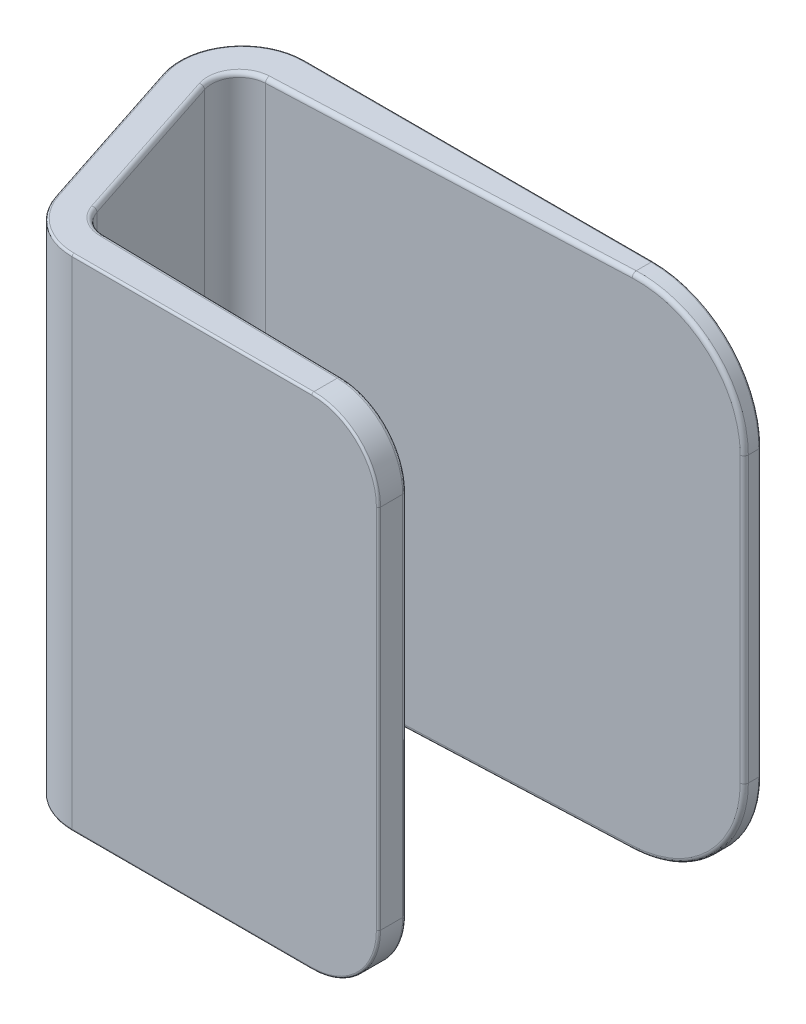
ISO-10303-21;
HEADER;
FILE_DESCRIPTION(('STEP AP214'),'2;1');
FILE_NAME('part.step','',(''),(''),'','','');
FILE_SCHEMA(('AUTOMOTIVE_DESIGN { 1 0 10303 214 1 1 1 1 }'));
ENDSEC;
DATA;
#1=APPLICATION_CONTEXT('core data for automotive mechanical design processes');
#2=APPLICATION_PROTOCOL_DEFINITION('international standard','automotive_design',2000,#1);
#3=PRODUCT_CONTEXT('',#1,'mechanical');
#4=PRODUCT('Part','Part','',(#3));
#5=PRODUCT_RELATED_PRODUCT_CATEGORY('part','',(#4));
#6=PRODUCT_DEFINITION_FORMATION('','',#4);
#7=PRODUCT_DEFINITION_CONTEXT('part definition',#1,'design');
#8=PRODUCT_DEFINITION('design','',#6,#7);
#9=PRODUCT_DEFINITION_SHAPE('','',#8);
#10=(LENGTH_UNIT() NAMED_UNIT(*) SI_UNIT(.MILLI.,.METRE.));
#11=(NAMED_UNIT(*) PLANE_ANGLE_UNIT() SI_UNIT($,.RADIAN.));
#12=(NAMED_UNIT(*) SI_UNIT($,.STERADIAN.) SOLID_ANGLE_UNIT());
#13=UNCERTAINTY_MEASURE_WITH_UNIT(LENGTH_MEASURE(1.E-05),#10,'distance_accuracy_value','');
#14=(GEOMETRIC_REPRESENTATION_CONTEXT(3) GLOBAL_UNCERTAINTY_ASSIGNED_CONTEXT((#13)) GLOBAL_UNIT_ASSIGNED_CONTEXT((#10,
#11,#12)) REPRESENTATION_CONTEXT('',''));
#15=CARTESIAN_POINT('',(0.,0.,0.));
#16=DIRECTION('',(0.,0.,1.));
#17=DIRECTION('',(1.,0.,0.));
#18=AXIS2_PLACEMENT_3D('',#15,#16,#17);
#19=CARTESIAN_POINT('',(165.424623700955,152.4,5.06801255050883));
#20=DIRECTION('',(-1.,0.,0.));
#21=DIRECTION('',(0.,0.,1.));
#22=AXIS2_PLACEMENT_3D('',#19,#20,#21);
#23=PLANE('',#22);
#24=DIRECTION('',(0.,0.,-1.));
#25=VECTOR('',#24,1.);
#26=CARTESIAN_POINT('',(165.424623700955,119.52224,5.06801255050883));
#27=LINE('',#26,#25);
#28=CARTESIAN_POINT('',(165.424623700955,119.52224,0.635));
#29=VERTEX_POINT('',#28);
#30=CARTESIAN_POINT('',(165.424623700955,119.52224,3.85002635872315));
#31=VERTEX_POINT('',#30);
#32=EDGE_CURVE('E526',#29,#31,#27,.F.);
#33=ORIENTED_EDGE('',*,*,#32,.T.);
#34=DIRECTION('',(0.,-1.,0.));
#35=VECTOR('',#34,1.);
#36=CARTESIAN_POINT('',(165.424623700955,152.4,3.85002635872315));
#37=LINE('',#36,#35);
#38=CARTESIAN_POINT('',(165.424623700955,32.87776,3.85002635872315));
#39=VERTEX_POINT('',#38);
#40=EDGE_CURVE('E375',#31,#39,#37,.T.);
#41=ORIENTED_EDGE('',*,*,#40,.T.);
#42=DIRECTION('',(0.,0.,-1.));
#43=VECTOR('',#42,1.);
#44=CARTESIAN_POINT('',(165.424623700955,32.87776,5.06801255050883));
#45=LINE('',#44,#43);
#46=CARTESIAN_POINT('',(165.424623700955,32.87776,0.635));
#47=VERTEX_POINT('',#46);
#48=EDGE_CURVE('E524',#39,#47,#45,.T.);
#49=ORIENTED_EDGE('',*,*,#48,.T.);
#50=DIRECTION('',(0.,-1.,0.));
#51=VECTOR('',#50,1.);
#52=CARTESIAN_POINT('',(165.424623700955,152.4,0.635));
#53=LINE('',#52,#51);
#54=EDGE_CURVE('E479',#47,#29,#53,.F.);
#55=ORIENTED_EDGE('',*,*,#54,.T.);
#56=EDGE_LOOP('',(#33,#41,#49,#55));
#57=FACE_BOUND('',#56,.T.);
#58=ADVANCED_FACE('F32',(#57),#23,.F.);
#59=CARTESIAN_POINT('',(165.424623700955,152.4,0.));
#60=DIRECTION('',(0.,0.,1.));
#61=DIRECTION('',(1.,0.,0.));
#62=AXIS2_PLACEMENT_3D('',#59,#60,#61);
#63=PLANE('',#62);
#64=DIRECTION('',(0.,-1.,0.));
#65=VECTOR('',#64,1.);
#66=CARTESIAN_POINT('',(26.2755056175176,152.4,0.));
#67=LINE('',#66,#65);
#68=CARTESIAN_POINT('',(26.2755056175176,0.634999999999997,0.));
#69=VERTEX_POINT('',#68);
#70=CARTESIAN_POINT('',(26.2755056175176,151.765,0.));
#71=VERTEX_POINT('',#70);
#72=EDGE_CURVE('E550',#69,#71,#67,.F.);
#73=ORIENTED_EDGE('',*,*,#72,.T.);
#74=DIRECTION('',(-1.,0.,0.));
#75=VECTOR('',#74,1.);
#76=CARTESIAN_POINT('',(132.546863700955,151.765,0.));
#77=LINE('',#76,#75);
#78=CARTESIAN_POINT('',(132.546863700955,151.765,0.));
#79=VERTEX_POINT('',#78);
#80=EDGE_CURVE('E484',#71,#79,#77,.F.);
#81=ORIENTED_EDGE('',*,*,#80,.T.);
#82=CARTESIAN_POINT('',(132.546863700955,119.52224,0.));
#83=DIRECTION('',(0.,0.,1.));
#84=DIRECTION('',(1.,0.,0.));
#85=AXIS2_PLACEMENT_3D('',#82,#83,#84);
#86=CIRCLE('',#85,32.24276);
#87=CARTESIAN_POINT('',(164.789623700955,119.52224,0.));
#88=VERTEX_POINT('',#87);
#89=EDGE_CURVE('E486',#79,#88,#86,.F.);
#90=ORIENTED_EDGE('',*,*,#89,.T.);
#91=DIRECTION('',(0.,-1.,0.));
#92=VECTOR('',#91,1.);
#93=CARTESIAN_POINT('',(164.789623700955,152.4,0.));
#94=LINE('',#93,#92);
#95=CARTESIAN_POINT('',(164.789623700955,32.87776,0.));
#96=VERTEX_POINT('',#95);
#97=EDGE_CURVE('E488',#88,#96,#94,.T.);
#98=ORIENTED_EDGE('',*,*,#97,.T.);
#99=CARTESIAN_POINT('',(132.546863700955,32.87776,0.));
#100=DIRECTION('',(0.,0.,1.));
#101=DIRECTION('',(1.,0.,0.));
#102=AXIS2_PLACEMENT_3D('',#99,#100,#101);
#103=CIRCLE('',#102,32.24276);
#104=CARTESIAN_POINT('',(132.546863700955,0.634999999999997,0.));
#105=VERTEX_POINT('',#104);
#106=EDGE_CURVE('E490',#96,#105,#103,.F.);
#107=ORIENTED_EDGE('',*,*,#106,.T.);
#108=DIRECTION('',(-1.,0.,0.));
#109=VECTOR('',#108,1.);
#110=CARTESIAN_POINT('',(165.424623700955,0.634999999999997,0.));
#111=LINE('',#110,#109);
#112=EDGE_CURVE('E492',#105,#69,#111,.T.);
#113=ORIENTED_EDGE('',*,*,#112,.T.);
#114=EDGE_LOOP('',(#73,#81,#90,#98,#107,#113));
#115=FACE_BOUND('',#114,.T.);
#116=ADVANCED_FACE('F598',(#115),#63,.F.);
#117=CARTESIAN_POINT('',(0.,152.4,0.));
#118=DIRECTION('',(0.950434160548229,0.,-0.310925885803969));
#119=DIRECTION('',(-0.310925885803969,0.,-0.950434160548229));
#120=AXIS2_PLACEMENT_3D('',#117,#118,#119);
#121=PLANE('',#120);
#122=DIRECTION('',(0.,-1.,0.));
#123=VECTOR('',#122,1.);
#124=CARTESIAN_POINT('',(24.1252371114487,152.4,73.7457076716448));
#125=LINE('',#124,#123);
#126=CARTESIAN_POINT('',(24.1252371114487,0.634999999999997,73.7457076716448));
#127=VERTEX_POINT('',#126);
#128=CARTESIAN_POINT('',(24.1252371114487,151.765,73.7457076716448));
#129=VERTEX_POINT('',#128);
#130=EDGE_CURVE('E553',#127,#129,#125,.F.);
#131=ORIENTED_EDGE('',*,*,#130,.T.);
#132=DIRECTION('',(0.310925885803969,0.,0.950434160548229));
#133=VECTOR('',#132,1.);
#134=CARTESIAN_POINT('',(8.16973485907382,151.765,24.9731381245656));
#135=LINE('',#134,#133);
#136=CARTESIAN_POINT('',(8.16973485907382,151.765,24.9731381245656));
#137=VERTEX_POINT('',#136);
#138=EDGE_CURVE('E498',#129,#137,#135,.F.);
#139=ORIENTED_EDGE('',*,*,#138,.T.);
#140=DIRECTION('',(0.,-1.,0.));
#141=VECTOR('',#140,1.);
#142=CARTESIAN_POINT('',(8.16973485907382,152.4,24.9731381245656));
#143=LINE('',#142,#141);
#144=CARTESIAN_POINT('',(8.16973485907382,0.634999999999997,24.9731381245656));
#145=VERTEX_POINT('',#144);
#146=EDGE_CURVE('E267',#137,#145,#143,.T.);
#147=ORIENTED_EDGE('',*,*,#146,.T.);
#148=DIRECTION('',(0.310925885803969,0.,0.950434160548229));
#149=VECTOR('',#148,1.);
#150=CARTESIAN_POINT('',(0.,0.634999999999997,0.));
#151=LINE('',#150,#149);
#152=EDGE_CURVE('E279',#145,#127,#151,.T.);
#153=ORIENTED_EDGE('',*,*,#152,.T.);
#154=EDGE_LOOP('',(#131,#139,#147,#153));
#155=FACE_BOUND('',#154,.T.);
#156=ADVANCED_FACE('F559',(#155),#121,.F.);
#157=CARTESIAN_POINT('',(28.4195705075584,152.4,86.8725695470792));
#158=DIRECTION('',(0.,0.,-1.));
#159=DIRECTION('',(-1.,0.,0.));
#160=AXIS2_PLACEMENT_3D('',#157,#158,#159);
#161=PLANE('',#160);
#162=CARTESIAN_POINT('',(115.336203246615,132.08,86.8725695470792));
#163=DIRECTION('',(0.,0.,-1.));
#164=DIRECTION('',(-1.,0.,0.));
#165=AXIS2_PLACEMENT_3D('',#162,#163,#164);
#166=CIRCLE('',#165,19.685);
#167=CARTESIAN_POINT('',(135.021203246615,132.08,86.8725695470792));
#168=VERTEX_POINT('',#167);
#169=CARTESIAN_POINT('',(115.336203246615,151.765,86.8725695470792));
#170=VERTEX_POINT('',#169);
#171=EDGE_CURVE('E253',#168,#170,#166,.F.);
#172=ORIENTED_EDGE('',*,*,#171,.T.);
#173=DIRECTION('',(1.,0.,0.));
#174=VECTOR('',#173,1.);
#175=CARTESIAN_POINT('',(42.2310078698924,151.765,86.8725695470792));
#176=LINE('',#175,#174);
#177=CARTESIAN_POINT('',(42.2310078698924,151.765,86.8725695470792));
#178=VERTEX_POINT('',#177);
#179=EDGE_CURVE('E247',#170,#178,#176,.F.);
#180=ORIENTED_EDGE('',*,*,#179,.T.);
#181=DIRECTION('',(0.,-1.,0.));
#182=VECTOR('',#181,1.);
#183=CARTESIAN_POINT('',(42.2310078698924,152.4,86.8725695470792));
#184=LINE('',#183,#182);
#185=CARTESIAN_POINT('',(42.2310078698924,0.634999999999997,86.8725695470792));
#186=VERTEX_POINT('',#185);
#187=EDGE_CURVE('E250',#178,#186,#184,.T.);
#188=ORIENTED_EDGE('',*,*,#187,.T.);
#189=DIRECTION('',(1.,0.,0.));
#190=VECTOR('',#189,1.);
#191=CARTESIAN_POINT('',(28.4195705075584,0.634999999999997,86.8725695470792));
#192=LINE('',#191,#190);
#193=CARTESIAN_POINT('',(115.336203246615,0.635000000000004,86.8725695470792));
#194=VERTEX_POINT('',#193);
#195=EDGE_CURVE('E514',#186,#194,#192,.T.);
#196=ORIENTED_EDGE('',*,*,#195,.T.);
#197=CARTESIAN_POINT('',(115.336203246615,20.32,86.8725695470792));
#198=DIRECTION('',(0.,0.,-1.));
#199=DIRECTION('',(-1.,0.,0.));
#200=AXIS2_PLACEMENT_3D('',#197,#198,#199);
#201=CIRCLE('',#200,19.685);
#202=CARTESIAN_POINT('',(135.021203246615,20.32,86.8725695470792));
#203=VERTEX_POINT('',#202);
#204=EDGE_CURVE('E516',#194,#203,#201,.F.);
#205=ORIENTED_EDGE('',*,*,#204,.T.);
#206=DIRECTION('',(0.,-1.,0.));
#207=VECTOR('',#206,1.);
#208=CARTESIAN_POINT('',(135.021203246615,152.4,86.8725695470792));
#209=LINE('',#208,#207);
#210=EDGE_CURVE('E518',#203,#168,#209,.F.);
#211=ORIENTED_EDGE('',*,*,#210,.T.);
#212=EDGE_LOOP('',(#172,#180,#188,#196,#205,#211));
#213=FACE_BOUND('',#212,.T.);
#214=ADVANCED_FACE('F249',(#213),#161,.F.);
#215=CARTESIAN_POINT('',(135.656203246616,152.4,78.2320060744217));
#216=DIRECTION('',(-1.,0.,0.));
#217=DIRECTION('',(0.,0.,1.));
#218=AXIS2_PLACEMENT_3D('',#215,#216,#217);
#219=PLANE('',#218);
#220=DIRECTION('',(0.,0.,-1.));
#221=VECTOR('',#220,1.);
#222=CARTESIAN_POINT('',(135.656203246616,20.32,78.2320060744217));
#223=LINE('',#222,#221);
#224=CARTESIAN_POINT('',(135.656203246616,20.32,86.2375695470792));
#225=VERTEX_POINT('',#224);
#226=CARTESIAN_POINT('',(135.656203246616,20.32,79.478062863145));
#227=VERTEX_POINT('',#226);
#228=EDGE_CURVE('E534',#225,#227,#223,.T.);
#229=ORIENTED_EDGE('',*,*,#228,.T.);
#230=DIRECTION('',(0.,-1.,0.));
#231=VECTOR('',#230,1.);
#232=CARTESIAN_POINT('',(135.656203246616,152.4,79.478062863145));
#233=LINE('',#232,#231);
#234=CARTESIAN_POINT('',(135.656203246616,132.08,79.478062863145));
#235=VERTEX_POINT('',#234);
#236=EDGE_CURVE('E11',#227,#235,#233,.F.);
#237=ORIENTED_EDGE('',*,*,#236,.T.);
#238=DIRECTION('',(0.,0.,-1.));
#239=VECTOR('',#238,1.);
#240=CARTESIAN_POINT('',(135.656203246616,132.08,86.8725695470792));
#241=LINE('',#240,#239);
#242=CARTESIAN_POINT('',(135.656203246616,132.08,86.2375695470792));
#243=VERTEX_POINT('',#242);
#244=EDGE_CURVE('E536',#235,#243,#241,.F.);
#245=ORIENTED_EDGE('',*,*,#244,.T.);
#246=DIRECTION('',(0.,-1.,0.));
#247=VECTOR('',#246,1.);
#248=CARTESIAN_POINT('',(135.656203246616,152.4,86.2375695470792));
#249=LINE('',#248,#247);
#250=EDGE_CURVE('E329',#243,#225,#249,.T.);
#251=ORIENTED_EDGE('',*,*,#250,.T.);
#252=EDGE_LOOP('',(#229,#237,#245,#251));
#253=FACE_BOUND('',#252,.T.);
#254=ADVANCED_FACE('F784',(#253),#219,.F.);
#255=CARTESIAN_POINT('',(35.4514808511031,152.4,76.3247040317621));
#256=DIRECTION('',(-0.019030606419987,0.,0.99981890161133));
#257=DIRECTION('',(0.999818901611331,0.,0.019030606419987));
#258=AXIS2_PLACEMENT_3D('',#255,#256,#257);
#259=PLANE('',#258);
#260=DIRECTION('',(0.,-1.,0.));
#261=VECTOR('',#260,1.);
#262=CARTESIAN_POINT('',(41.4065766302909,152.4,76.4380536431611));
#263=LINE('',#262,#261);
#264=CARTESIAN_POINT('',(41.4065766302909,1.26999999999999,76.4380536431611));
#265=VERTEX_POINT('',#264);
#266=CARTESIAN_POINT('',(41.4065766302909,151.13,76.4380536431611));
#267=VERTEX_POINT('',#266);
#268=EDGE_CURVE('E541',#265,#267,#263,.F.);
#269=ORIENTED_EDGE('',*,*,#268,.T.);
#270=DIRECTION('',(-0.999818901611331,0.,-0.019030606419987));
#271=VECTOR('',#270,1.);
#272=CARTESIAN_POINT('',(115.336203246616,151.13,77.8452341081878));
#273=LINE('',#272,#271);
#274=CARTESIAN_POINT('',(115.360372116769,151.13,77.8456941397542));
#275=VERTEX_POINT('',#274);
#276=EDGE_CURVE('E336',#267,#275,#273,.F.);
#277=ORIENTED_EDGE('',*,*,#276,.T.);
#278=CARTESIAN_POINT('',(115.360372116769,132.08,77.8456941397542));
#279=DIRECTION('',(-0.019030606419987,0.,0.99981890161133));
#280=DIRECTION('',(0.999818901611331,0.,0.019030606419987));
#281=AXIS2_PLACEMENT_3D('',#278,#279,#280);
#282=ELLIPSE('',#281,19.0534505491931,19.05);
#283=CARTESIAN_POINT('',(134.410372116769,132.08,78.2082928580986));
#284=VERTEX_POINT('',#283);
#285=EDGE_CURVE('E333',#275,#284,#282,.F.);
#286=ORIENTED_EDGE('',*,*,#285,.T.);
#287=DIRECTION('',(0.,-1.,0.));
#288=VECTOR('',#287,1.);
#289=CARTESIAN_POINT('',(134.410372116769,152.4,78.2082928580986));
#290=LINE('',#289,#288);
#291=CARTESIAN_POINT('',(134.410372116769,20.32,78.2082928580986));
#292=VERTEX_POINT('',#291);
#293=EDGE_CURVE('E326',#284,#292,#290,.T.);
#294=ORIENTED_EDGE('',*,*,#293,.T.);
#295=CARTESIAN_POINT('',(115.360372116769,20.32,77.8456941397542));
#296=DIRECTION('',(-0.019030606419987,0.,0.99981890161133));
#297=DIRECTION('',(-0.999818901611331,0.,-0.019030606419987));
#298=AXIS2_PLACEMENT_3D('',#295,#296,#297);
#299=ELLIPSE('',#298,19.0534505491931,19.05);
#300=CARTESIAN_POINT('',(115.360372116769,1.27,77.8456941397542));
#301=VERTEX_POINT('',#300);
#302=EDGE_CURVE('E328',#292,#301,#299,.F.);
#303=ORIENTED_EDGE('',*,*,#302,.T.);
#304=DIRECTION('',(-0.999818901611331,0.,-0.019030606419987));
#305=VECTOR('',#304,1.);
#306=CARTESIAN_POINT('',(35.4514808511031,1.26999999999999,76.3247040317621));
#307=LINE('',#306,#305);
#308=EDGE_CURVE('E331',#301,#265,#307,.T.);
#309=ORIENTED_EDGE('',*,*,#308,.T.);
#310=EDGE_LOOP('',(#269,#277,#286,#294,#303,#309));
#311=FACE_BOUND('',#310,.T.);
#312=ADVANCED_FACE('F409',(#311),#259,.F.);
#313=CARTESIAN_POINT('',(35.4514808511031,152.4,76.3247040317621));
#314=DIRECTION('',(-0.950434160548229,0.,0.310925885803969));
#315=DIRECTION('',(0.310925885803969,0.,0.950434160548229));
#316=AXIS2_PLACEMENT_3D('',#313,#314,#315);
#317=PLANE('',#316);
#318=DIRECTION('',(0.,-1.,0.));
#319=VECTOR('',#318,1.);
#320=CARTESIAN_POINT('',(17.6507616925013,152.4,21.9116997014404));
#321=LINE('',#320,#319);
#322=CARTESIAN_POINT('',(17.6507616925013,1.26999999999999,21.9116997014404));
#323=VERTEX_POINT('',#322);
#324=CARTESIAN_POINT('',(17.6507616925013,151.13,21.9116997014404));
#325=VERTEX_POINT('',#324);
#326=EDGE_CURVE('E547',#323,#325,#321,.F.);
#327=ORIENTED_EDGE('',*,*,#326,.T.);
#328=DIRECTION('',(-0.310925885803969,0.,-0.950434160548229));
#329=VECTOR('',#328,1.);
#330=CARTESIAN_POINT('',(33.599552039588,151.13,70.6637523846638));
#331=LINE('',#330,#329);
#332=CARTESIAN_POINT('',(33.599552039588,151.13,70.6637523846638));
#333=VERTEX_POINT('',#332);
#334=EDGE_CURVE('E357',#325,#333,#331,.F.);
#335=ORIENTED_EDGE('',*,*,#334,.T.);
#336=DIRECTION('',(0.,-1.,0.));
#337=VECTOR('',#336,1.);
#338=CARTESIAN_POINT('',(33.599552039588,0.,70.6637523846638));
#339=LINE('',#338,#337);
#340=CARTESIAN_POINT('',(33.599552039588,1.26999999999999,70.6637523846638));
#341=VERTEX_POINT('',#340);
#342=EDGE_CURVE('E544',#333,#341,#339,.T.);
#343=ORIENTED_EDGE('',*,*,#342,.T.);
#344=DIRECTION('',(-0.310925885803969,0.,-0.950434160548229));
#345=VECTOR('',#344,1.);
#346=CARTESIAN_POINT('',(35.4514808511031,1.26999999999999,76.3247040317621));
#347=LINE('',#346,#345);
#348=EDGE_CURVE('E355',#341,#323,#347,.T.);
#349=ORIENTED_EDGE('',*,*,#348,.T.);
#350=EDGE_LOOP('',(#327,#335,#343,#349));
#351=FACE_BOUND('',#350,.T.);
#352=ADVANCED_FACE('F658',(#351),#317,.F.);
#353=CARTESIAN_POINT('',(14.2097852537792,152.4,11.3933681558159));
#354=DIRECTION('',(-0.0417937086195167,0.,-0.999126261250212));
#355=DIRECTION('',(-0.999126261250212,0.,0.0417937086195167));
#356=AXIS2_PLACEMENT_3D('',#353,#354,#355);
#357=PLANE('',#356);
#358=CARTESIAN_POINT('',(132.599941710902,119.52224,6.44107744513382));
#359=DIRECTION('',(-0.0417937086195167,0.,-0.999126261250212));
#360=DIRECTION('',(-0.999126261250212,0.,0.0417937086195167));
#361=AXIS2_PLACEMENT_3D('',#358,#359,#360);
#362=ELLIPSE('',#361,31.635401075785,31.60776);
#363=CARTESIAN_POINT('',(164.207701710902,119.52224,5.11891671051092));
#364=VERTEX_POINT('',#363);
#365=CARTESIAN_POINT('',(132.599941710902,151.13,6.44107744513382));
#366=VERTEX_POINT('',#365);
#367=EDGE_CURVE('E369',#364,#366,#362,.F.);
#368=ORIENTED_EDGE('',*,*,#367,.T.);
#369=DIRECTION('',(0.999126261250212,0.,-0.0417937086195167));
#370=VECTOR('',#369,1.);
#371=CARTESIAN_POINT('',(25.2669859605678,151.13,10.9308426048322));
#372=LINE('',#371,#370);
#373=CARTESIAN_POINT('',(25.2669859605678,151.13,10.9308426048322));
#374=VERTEX_POINT('',#373);
#375=EDGE_CURVE('E371',#366,#374,#372,.F.);
#376=ORIENTED_EDGE('',*,*,#375,.T.);
#377=DIRECTION('',(0.,-1.,0.));
#378=VECTOR('',#377,1.);
#379=CARTESIAN_POINT('',(25.2669859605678,0.,10.9308426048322));
#380=LINE('',#379,#378);
#381=CARTESIAN_POINT('',(25.2669859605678,1.27,10.9308426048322));
#382=VERTEX_POINT('',#381);
#383=EDGE_CURVE('E538',#374,#382,#380,.T.);
#384=ORIENTED_EDGE('',*,*,#383,.T.);
#385=DIRECTION('',(0.999126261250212,0.,-0.0417937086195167));
#386=VECTOR('',#385,1.);
#387=CARTESIAN_POINT('',(14.2097852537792,1.26999999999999,11.3933681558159));
#388=LINE('',#387,#386);
#389=CARTESIAN_POINT('',(132.599941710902,1.26999999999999,6.44107744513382));
#390=VERTEX_POINT('',#389);
#391=EDGE_CURVE('E363',#382,#390,#388,.T.);
#392=ORIENTED_EDGE('',*,*,#391,.T.);
#393=CARTESIAN_POINT('',(132.599941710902,32.87776,6.44107744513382));
#394=DIRECTION('',(-0.0417937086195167,0.,-0.999126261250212));
#395=DIRECTION('',(0.999126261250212,0.,-0.0417937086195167));
#396=AXIS2_PLACEMENT_3D('',#393,#394,#395);
#397=ELLIPSE('',#396,31.635401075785,31.60776);
#398=CARTESIAN_POINT('',(164.207701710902,32.87776,5.11891671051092));
#399=VERTEX_POINT('',#398);
#400=EDGE_CURVE('E365',#390,#399,#397,.F.);
#401=ORIENTED_EDGE('',*,*,#400,.T.);
#402=DIRECTION('',(0.,-1.,0.));
#403=VECTOR('',#402,1.);
#404=CARTESIAN_POINT('',(164.207701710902,152.4,5.11891671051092));
#405=LINE('',#404,#403);
#406=EDGE_CURVE('E367',#399,#364,#405,.F.);
#407=ORIENTED_EDGE('',*,*,#406,.T.);
#408=EDGE_LOOP('',(#368,#376,#384,#392,#401,#407));
#409=FACE_BOUND('',#408,.T.);
#410=ADVANCED_FACE('F443',(#409),#357,.F.);
#411=CARTESIAN_POINT('',(0.,152.4,0.));
#412=DIRECTION('',(0.,1.,0.));
#413=DIRECTION('',(0.,0.,1.));
#414=AXIS2_PLACEMENT_3D('',#411,#412,#413);
#415=PLANE('',#414);
#416=DIRECTION('',(0.,0.,-1.));
#417=VECTOR('',#416,1.);
#418=CARTESIAN_POINT('',(115.336203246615,152.4,78.2320060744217));
#419=LINE('',#418,#417);
#420=CARTESIAN_POINT('',(115.336203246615,152.4,86.2375695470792));
#421=VERTEX_POINT('',#420);
#422=CARTESIAN_POINT('',(115.336203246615,152.4,79.1154641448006));
#423=VERTEX_POINT('',#422);
#424=EDGE_CURVE('E529',#421,#423,#419,.T.);
#425=ORIENTED_EDGE('',*,*,#424,.T.);
#426=DIRECTION('',(-0.999818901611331,0.,-0.019030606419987));
#427=VECTOR('',#426,1.);
#428=CARTESIAN_POINT('',(41.3824077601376,152.4,77.7078236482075));
#429=LINE('',#428,#427);
#430=CARTESIAN_POINT('',(41.3824077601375,152.4,77.7078236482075));
#431=VERTEX_POINT('',#430);
#432=EDGE_CURVE('E349',#423,#431,#429,.T.);
#433=ORIENTED_EDGE('',*,*,#432,.T.);
#434=CARTESIAN_POINT('',(41.5660911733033,152.4,68.0575716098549));
#435=DIRECTION('',(0.,1.,0.));
#436=DIRECTION('',(0.,0.,1.));
#437=AXIS2_PLACEMENT_3D('',#434,#435,#436);
#438=CIRCLE('',#437,9.652);
#439=CARTESIAN_POINT('',(32.3925006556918,152.4,71.0586282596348));
#440=VERTEX_POINT('',#439);
#441=EDGE_CURVE('E347',#431,#440,#438,.F.);
#442=ORIENTED_EDGE('',*,*,#441,.T.);
#443=DIRECTION('',(-0.310925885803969,0.,-0.950434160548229));
#444=VECTOR('',#443,1.);
#445=CARTESIAN_POINT('',(16.4437103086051,152.4,22.3065755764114));
#446=LINE('',#445,#444);
#447=CARTESIAN_POINT('',(16.4437103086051,152.4,22.3065755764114));
#448=VERTEX_POINT('',#447);
#449=EDGE_CURVE('E345',#440,#448,#446,.T.);
#450=ORIENTED_EDGE('',*,*,#449,.T.);
#451=CARTESIAN_POINT('',(25.6173008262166,152.4,19.3055189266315));
#452=DIRECTION('',(0.,1.,0.));
#453=DIRECTION('',(0.,0.,1.));
#454=AXIS2_PLACEMENT_3D('',#451,#452,#453);
#455=CIRCLE('',#454,9.652);
#456=CARTESIAN_POINT('',(25.213907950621,152.4,9.66195225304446));
#457=VERTEX_POINT('',#456);
#458=EDGE_CURVE('E343',#448,#457,#455,.F.);
#459=ORIENTED_EDGE('',*,*,#458,.T.);
#460=DIRECTION('',(0.999126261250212,0.,-0.0417937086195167));
#461=VECTOR('',#460,1.);
#462=CARTESIAN_POINT('',(132.493785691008,152.4,5.17440736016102));
#463=LINE('',#462,#461);
#464=CARTESIAN_POINT('',(132.546863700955,152.4,5.17218709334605));
#465=VERTEX_POINT('',#464);
#466=EDGE_CURVE('E341',#457,#465,#463,.T.);
#467=ORIENTED_EDGE('',*,*,#466,.T.);
#468=DIRECTION('',(0.,0.,-1.));
#469=VECTOR('',#468,1.);
#470=CARTESIAN_POINT('',(132.546863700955,152.4,0.));
#471=LINE('',#470,#469);
#472=CARTESIAN_POINT('',(132.546863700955,152.4,0.635));
#473=VERTEX_POINT('',#472);
#474=EDGE_CURVE('E520',#465,#473,#471,.T.);
#475=ORIENTED_EDGE('',*,*,#474,.T.);
#476=DIRECTION('',(-1.,0.,0.));
#477=VECTOR('',#476,1.);
#478=CARTESIAN_POINT('',(26.2755056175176,152.4,0.635));
#479=LINE('',#478,#477);
#480=CARTESIAN_POINT('',(26.2755056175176,152.4,0.635));
#481=VERTEX_POINT('',#480);
#482=EDGE_CURVE('E509',#473,#481,#479,.T.);
#483=ORIENTED_EDGE('',*,*,#482,.T.);
#484=CARTESIAN_POINT('',(26.2755056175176,152.4,19.05));
#485=DIRECTION('',(0.,1.,0.));
#486=DIRECTION('',(0.,0.,1.));
#487=AXIS2_PLACEMENT_3D('',#484,#485,#486);
#488=CIRCLE('',#487,18.415);
#489=CARTESIAN_POINT('',(8.77326055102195,152.4,24.7757001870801));
#490=VERTEX_POINT('',#489);
#491=EDGE_CURVE('E507',#481,#490,#488,.T.);
#492=ORIENTED_EDGE('',*,*,#491,.T.);
#493=DIRECTION('',(0.310925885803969,0.,0.950434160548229));
#494=VECTOR('',#493,1.);
#495=CARTESIAN_POINT('',(24.7287628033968,152.4,73.5482697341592));
#496=LINE('',#495,#494);
#497=CARTESIAN_POINT('',(24.7287628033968,152.4,73.5482697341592));
#498=VERTEX_POINT('',#497);
#499=EDGE_CURVE('E505',#490,#498,#496,.T.);
#500=ORIENTED_EDGE('',*,*,#499,.T.);
#501=CARTESIAN_POINT('',(42.2310078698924,152.4,67.8225695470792));
#502=DIRECTION('',(0.,1.,0.));
#503=DIRECTION('',(0.,0.,1.));
#504=AXIS2_PLACEMENT_3D('',#501,#502,#503);
#505=CIRCLE('',#504,18.415);
#506=CARTESIAN_POINT('',(42.2310078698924,152.4,86.2375695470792));
#507=VERTEX_POINT('',#506);
#508=EDGE_CURVE('E503',#498,#507,#505,.T.);
#509=ORIENTED_EDGE('',*,*,#508,.T.);
#510=DIRECTION('',(1.,0.,0.));
#511=VECTOR('',#510,1.);
#512=CARTESIAN_POINT('',(115.336203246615,152.4,86.2375695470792));
#513=LINE('',#512,#511);
#514=EDGE_CURVE('E282',#507,#421,#513,.T.);
#515=ORIENTED_EDGE('',*,*,#514,.T.);
#516=EDGE_LOOP('',(#425,#433,#442,#450,#459,#467,#475,#483,#492,#500,#509,#515));
#517=FACE_BOUND('',#516,.T.);
#518=ADVANCED_FACE('F750',(#517),#415,.T.);
#519=CARTESIAN_POINT('',(0.,0.,0.));
#520=DIRECTION('',(0.,1.,0.));
#521=DIRECTION('',(0.,0.,1.));
#522=AXIS2_PLACEMENT_3D('',#519,#520,#521);
#523=PLANE('',#522);
#524=DIRECTION('',(0.,0.,-1.));
#525=VECTOR('',#524,1.);
#526=CARTESIAN_POINT('',(132.546863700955,0.,0.));
#527=LINE('',#526,#525);
#528=CARTESIAN_POINT('',(132.546863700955,0.,0.635));
#529=VERTEX_POINT('',#528);
#530=CARTESIAN_POINT('',(132.546863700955,0.,5.17218709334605));
#531=VERTEX_POINT('',#530);
#532=EDGE_CURVE('E522',#529,#531,#527,.F.);
#533=ORIENTED_EDGE('',*,*,#532,.T.);
#534=DIRECTION('',(0.999126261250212,0.,-0.0417937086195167));
#535=VECTOR('',#534,1.);
#536=CARTESIAN_POINT('',(0.447497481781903,0.,10.6979375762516));
#537=LINE('',#536,#535);
#538=CARTESIAN_POINT('',(25.213907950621,0.,9.66195225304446));
#539=VERTEX_POINT('',#538);
#540=EDGE_CURVE('E58',#531,#539,#537,.F.);
#541=ORIENTED_EDGE('',*,*,#540,.T.);
#542=CARTESIAN_POINT('',(25.6173008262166,0.,19.3055189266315));
#543=DIRECTION('',(0.,1.,0.));
#544=DIRECTION('',(0.,0.,1.));
#545=AXIS2_PLACEMENT_3D('',#542,#543,#544);
#546=CIRCLE('',#545,9.652);
#547=CARTESIAN_POINT('',(16.4437103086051,0.,22.3065755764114));
#548=VERTEX_POINT('',#547);
#549=EDGE_CURVE('E385',#539,#548,#546,.T.);
#550=ORIENTED_EDGE('',*,*,#549,.T.);
#551=DIRECTION('',(-0.310925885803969,0.,-0.950434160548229));
#552=VECTOR('',#551,1.);
#553=CARTESIAN_POINT('',(8.2620977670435,0.,-2.70287009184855));
#554=LINE('',#553,#552);
#555=CARTESIAN_POINT('',(32.3925006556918,0.,71.0586282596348));
#556=VERTEX_POINT('',#555);
#557=EDGE_CURVE('E383',#548,#556,#554,.F.);
#558=ORIENTED_EDGE('',*,*,#557,.T.);
#559=CARTESIAN_POINT('',(41.5660911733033,0.,68.0575716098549));
#560=DIRECTION('',(0.,1.,0.));
#561=DIRECTION('',(0.,0.,1.));
#562=AXIS2_PLACEMENT_3D('',#559,#560,#561);
#563=CIRCLE('',#562,9.652);
#564=CARTESIAN_POINT('',(41.3824077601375,0.,77.7078236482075));
#565=VERTEX_POINT('',#564);
#566=EDGE_CURVE('E381',#556,#565,#563,.T.);
#567=ORIENTED_EDGE('',*,*,#566,.T.);
#568=DIRECTION('',(-0.999818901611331,0.,-0.019030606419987));
#569=VECTOR('',#568,1.);
#570=CARTESIAN_POINT('',(-1.46357197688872,0.,76.8922909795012));
#571=LINE('',#570,#569);
#572=CARTESIAN_POINT('',(115.336203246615,0.,79.1154641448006));
#573=VERTEX_POINT('',#572);
#574=EDGE_CURVE('E379',#565,#573,#571,.F.);
#575=ORIENTED_EDGE('',*,*,#574,.T.);
#576=DIRECTION('',(0.,0.,-1.));
#577=VECTOR('',#576,1.);
#578=CARTESIAN_POINT('',(115.336203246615,0.,0.));
#579=LINE('',#578,#577);
#580=CARTESIAN_POINT('',(115.336203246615,0.,86.2375695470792));
#581=VERTEX_POINT('',#580);
#582=EDGE_CURVE('E532',#573,#581,#579,.F.);
#583=ORIENTED_EDGE('',*,*,#582,.T.);
#584=DIRECTION('',(1.,0.,0.));
#585=VECTOR('',#584,1.);
#586=CARTESIAN_POINT('',(0.,0.,86.2375695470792));
#587=LINE('',#586,#585);
#588=CARTESIAN_POINT('',(42.2310078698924,0.,86.2375695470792));
#589=VERTEX_POINT('',#588);
#590=EDGE_CURVE('E474',#581,#589,#587,.F.);
#591=ORIENTED_EDGE('',*,*,#590,.T.);
#592=CARTESIAN_POINT('',(42.2310078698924,0.,67.8225695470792));
#593=DIRECTION('',(0.,1.,0.));
#594=DIRECTION('',(0.,0.,1.));
#595=AXIS2_PLACEMENT_3D('',#592,#593,#594);
#596=CIRCLE('',#595,18.415);
#597=CARTESIAN_POINT('',(24.7287628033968,0.,73.5482697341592));
#598=VERTEX_POINT('',#597);
#599=EDGE_CURVE('E472',#589,#598,#596,.F.);
#600=ORIENTED_EDGE('',*,*,#599,.T.);
#601=DIRECTION('',(0.310925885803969,0.,0.950434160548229));
#602=VECTOR('',#601,1.);
#603=CARTESIAN_POINT('',(0.603525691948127,0.,-0.197437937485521));
#604=LINE('',#603,#602);
#605=CARTESIAN_POINT('',(8.77326055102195,0.,24.7757001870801));
#606=VERTEX_POINT('',#605);
#607=EDGE_CURVE('E470',#598,#606,#604,.F.);
#608=ORIENTED_EDGE('',*,*,#607,.T.);
#609=CARTESIAN_POINT('',(26.2755056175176,0.,19.05));
#610=DIRECTION('',(0.,1.,0.));
#611=DIRECTION('',(0.,0.,1.));
#612=AXIS2_PLACEMENT_3D('',#609,#610,#611);
#613=CIRCLE('',#612,18.415);
#614=CARTESIAN_POINT('',(26.2755056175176,0.,0.634999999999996));
#615=VERTEX_POINT('',#614);
#616=EDGE_CURVE('E468',#606,#615,#613,.F.);
#617=ORIENTED_EDGE('',*,*,#616,.T.);
#618=DIRECTION('',(-1.,0.,0.));
#619=VECTOR('',#618,1.);
#620=CARTESIAN_POINT('',(0.,0.,0.635));
#621=LINE('',#620,#619);
#622=EDGE_CURVE('E466',#615,#529,#621,.F.);
#623=ORIENTED_EDGE('',*,*,#622,.T.);
#624=EDGE_LOOP('',(#533,#541,#550,#558,#567,#575,#583,#591,#600,#608,#617,#623));
#625=FACE_BOUND('',#624,.T.);
#626=ADVANCED_FACE('F611',(#625),#523,.F.);
#627=CARTESIAN_POINT('',(42.2310078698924,152.4,67.8225695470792));
#628=DIRECTION('',(0.,-1.,0.));
#629=DIRECTION('',(0.,0.,-1.));
#630=AXIS2_PLACEMENT_3D('',#627,#628,#629);
#631=CYLINDRICAL_SURFACE('',#630,19.05);
#632=ORIENTED_EDGE('',*,*,#187,.F.);
#633=CARTESIAN_POINT('',(42.2310078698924,151.765,67.8225695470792));
#634=DIRECTION('',(0.,1.,0.));
#635=DIRECTION('',(0.,0.,1.));
#636=AXIS2_PLACEMENT_3D('',#633,#634,#635);
#637=CIRCLE('',#636,19.05);
#638=EDGE_CURVE('E263',#178,#129,#637,.F.);
#639=ORIENTED_EDGE('',*,*,#638,.T.);
#640=ORIENTED_EDGE('',*,*,#130,.F.);
#641=CARTESIAN_POINT('',(42.2310078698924,0.634999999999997,67.8225695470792));
#642=DIRECTION('',(0.,1.,0.));
#643=DIRECTION('',(0.,0.,1.));
#644=AXIS2_PLACEMENT_3D('',#641,#642,#643);
#645=CIRCLE('',#644,19.05);
#646=EDGE_CURVE('E266',#127,#186,#645,.T.);
#647=ORIENTED_EDGE('',*,*,#646,.T.);
#648=EDGE_LOOP('',(#632,#639,#640,#647));
#649=FACE_BOUND('',#648,.T.);
#650=ADVANCED_FACE('F261',(#649),#631,.T.);
#651=CARTESIAN_POINT('',(26.2755056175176,152.4,19.05));
#652=DIRECTION('',(0.,-1.,0.));
#653=DIRECTION('',(0.,0.,-1.));
#654=AXIS2_PLACEMENT_3D('',#651,#652,#653);
#655=CYLINDRICAL_SURFACE('',#654,19.05);
#656=ORIENTED_EDGE('',*,*,#146,.F.);
#657=CARTESIAN_POINT('',(26.2755056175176,151.765,19.05));
#658=DIRECTION('',(0.,1.,0.));
#659=DIRECTION('',(0.,0.,1.));
#660=AXIS2_PLACEMENT_3D('',#657,#658,#659);
#661=CIRCLE('',#660,19.05);
#662=EDGE_CURVE('E494',#137,#71,#661,.F.);
#663=ORIENTED_EDGE('',*,*,#662,.T.);
#664=ORIENTED_EDGE('',*,*,#72,.F.);
#665=CARTESIAN_POINT('',(26.2755056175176,0.634999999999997,19.05));
#666=DIRECTION('',(0.,1.,0.));
#667=DIRECTION('',(0.,0.,1.));
#668=AXIS2_PLACEMENT_3D('',#665,#666,#667);
#669=CIRCLE('',#668,19.05);
#670=EDGE_CURVE('E496',#69,#145,#669,.T.);
#671=ORIENTED_EDGE('',*,*,#670,.T.);
#672=EDGE_LOOP('',(#656,#663,#664,#671));
#673=FACE_BOUND('',#672,.T.);
#674=ADVANCED_FACE('F610',(#673),#655,.T.);
#675=CARTESIAN_POINT('',(41.5660911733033,152.4,68.0575716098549));
#676=DIRECTION('',(0.,1.,0.));
#677=DIRECTION('',(0.,0.,1.));
#678=AXIS2_PLACEMENT_3D('',#675,#676,#677);
#679=CYLINDRICAL_SURFACE('',#678,8.382);
#680=ORIENTED_EDGE('',*,*,#342,.F.);
#681=CARTESIAN_POINT('',(41.5660911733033,151.13,68.0575716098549));
#682=DIRECTION('',(0.,1.,0.));
#683=DIRECTION('',(0.,0.,1.));
#684=AXIS2_PLACEMENT_3D('',#681,#682,#683);
#685=CIRCLE('',#684,8.382);
#686=EDGE_CURVE('E353',#333,#267,#685,.T.);
#687=ORIENTED_EDGE('',*,*,#686,.T.);
#688=ORIENTED_EDGE('',*,*,#268,.F.);
#689=CARTESIAN_POINT('',(41.5660911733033,1.26999999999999,68.0575716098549));
#690=DIRECTION('',(0.,1.,0.));
#691=DIRECTION('',(0.,0.,1.));
#692=AXIS2_PLACEMENT_3D('',#689,#690,#691);
#693=CIRCLE('',#692,8.382);
#694=EDGE_CURVE('E351',#265,#341,#693,.F.);
#695=ORIENTED_EDGE('',*,*,#694,.T.);
#696=EDGE_LOOP('',(#680,#687,#688,#695));
#697=FACE_BOUND('',#696,.T.);
#698=ADVANCED_FACE('F614',(#697),#679,.F.);
#699=CARTESIAN_POINT('',(25.6173008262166,152.4,19.3055189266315));
#700=DIRECTION('',(0.,1.,0.));
#701=DIRECTION('',(0.,0.,1.));
#702=AXIS2_PLACEMENT_3D('',#699,#700,#701);
#703=CYLINDRICAL_SURFACE('',#702,8.382);
#704=ORIENTED_EDGE('',*,*,#383,.F.);
#705=CARTESIAN_POINT('',(25.6173008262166,151.13,19.3055189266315));
#706=DIRECTION('',(0.,1.,0.));
#707=DIRECTION('',(0.,0.,1.));
#708=AXIS2_PLACEMENT_3D('',#705,#706,#707);
#709=CIRCLE('',#708,8.382);
#710=EDGE_CURVE('E361',#374,#325,#709,.T.);
#711=ORIENTED_EDGE('',*,*,#710,.T.);
#712=ORIENTED_EDGE('',*,*,#326,.F.);
#713=CARTESIAN_POINT('',(25.6173008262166,1.26999999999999,19.3055189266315));
#714=DIRECTION('',(0.,1.,0.));
#715=DIRECTION('',(0.,0.,1.));
#716=AXIS2_PLACEMENT_3D('',#713,#714,#715);
#717=CIRCLE('',#716,8.382);
#718=EDGE_CURVE('E359',#323,#382,#717,.F.);
#719=ORIENTED_EDGE('',*,*,#718,.T.);
#720=EDGE_LOOP('',(#704,#711,#712,#719));
#721=FACE_BOUND('',#720,.T.);
#722=ADVANCED_FACE('F616',(#721),#703,.F.);
#723=CARTESIAN_POINT('',(115.336203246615,20.32,78.2320060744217));
#724=DIRECTION('',(0.,0.,-1.));
#725=DIRECTION('',(-1.,0.,0.));
#726=AXIS2_PLACEMENT_3D('',#723,#724,#725);
#727=CYLINDRICAL_SURFACE('',#726,20.32);
#728=ORIENTED_EDGE('',*,*,#582,.F.);
#729=CARTESIAN_POINT('',(115.336203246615,20.32,79.1154641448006));
#730=DIRECTION('',(0.0178415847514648,0.,-0.999840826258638));
#731=DIRECTION('',(-0.999840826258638,0.,-0.0178415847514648));
#732=AXIS2_PLACEMENT_3D('',#729,#730,#731);
#733=ELLIPSE('',#732,20.3232349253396,20.32);
#734=EDGE_CURVE('E43',#573,#227,#733,.F.);
#735=ORIENTED_EDGE('',*,*,#734,.T.);
#736=ORIENTED_EDGE('',*,*,#228,.F.);
#737=CARTESIAN_POINT('',(115.336203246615,20.32,86.2375695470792));
#738=DIRECTION('',(0.,0.,-1.));
#739=DIRECTION('',(-1.,0.,0.));
#740=AXIS2_PLACEMENT_3D('',#737,#738,#739);
#741=CIRCLE('',#740,20.32);
#742=EDGE_CURVE('E463',#225,#581,#741,.T.);
#743=ORIENTED_EDGE('',*,*,#742,.T.);
#744=EDGE_LOOP('',(#728,#735,#736,#743));
#745=FACE_BOUND('',#744,.T.);
#746=ADVANCED_FACE('F418',(#745),#727,.T.);
#747=CARTESIAN_POINT('',(115.336203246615,132.08,0.));
#748=DIRECTION('',(0.,0.,1.));
#749=DIRECTION('',(1.,0.,0.));
#750=AXIS2_PLACEMENT_3D('',#747,#748,#749);
#751=CYLINDRICAL_SURFACE('',#750,20.32);
#752=ORIENTED_EDGE('',*,*,#244,.F.);
#753=CARTESIAN_POINT('',(115.336203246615,132.08,79.1154641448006));
#754=DIRECTION('',(0.0178415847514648,0.,-0.999840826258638));
#755=DIRECTION('',(0.999840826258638,0.,0.0178415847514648));
#756=AXIS2_PLACEMENT_3D('',#753,#754,#755);
#757=ELLIPSE('',#756,20.3232349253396,20.32);
#758=EDGE_CURVE('E338',#235,#423,#757,.F.);
#759=ORIENTED_EDGE('',*,*,#758,.T.);
#760=ORIENTED_EDGE('',*,*,#424,.F.);
#761=CARTESIAN_POINT('',(115.336203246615,132.08,86.2375695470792));
#762=DIRECTION('',(0.,0.,-1.));
#763=DIRECTION('',(-1.,0.,0.));
#764=AXIS2_PLACEMENT_3D('',#761,#762,#763);
#765=CIRCLE('',#764,20.32);
#766=EDGE_CURVE('E257',#421,#243,#765,.T.);
#767=ORIENTED_EDGE('',*,*,#766,.T.);
#768=EDGE_LOOP('',(#752,#759,#760,#767));
#769=FACE_BOUND('',#768,.T.);
#770=ADVANCED_FACE('F413',(#769),#751,.T.);
#771=CARTESIAN_POINT('',(132.546863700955,32.87776,5.06801255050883));
#772=DIRECTION('',(0.,0.,-1.));
#773=DIRECTION('',(-1.,0.,0.));
#774=AXIS2_PLACEMENT_3D('',#771,#772,#773);
#775=CYLINDRICAL_SURFACE('',#774,32.87776);
#776=ORIENTED_EDGE('',*,*,#48,.F.);
#777=CARTESIAN_POINT('',(132.546863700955,32.87776,5.17218709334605));
#778=DIRECTION('',(0.0401819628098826,0.,0.999192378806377));
#779=DIRECTION('',(0.999192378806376,0.,-0.0401819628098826));
#780=AXIS2_PLACEMENT_3D('',#777,#778,#779);
#781=ELLIPSE('',#780,32.9043342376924,32.87776);
#782=EDGE_CURVE('E377',#39,#531,#781,.F.);
#783=ORIENTED_EDGE('',*,*,#782,.T.);
#784=ORIENTED_EDGE('',*,*,#532,.F.);
#785=CARTESIAN_POINT('',(132.546863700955,32.87776,0.635));
#786=DIRECTION('',(0.,0.,1.));
#787=DIRECTION('',(1.,0.,0.));
#788=AXIS2_PLACEMENT_3D('',#785,#786,#787);
#789=CIRCLE('',#788,32.87776);
#790=EDGE_CURVE('E476',#529,#47,#789,.T.);
#791=ORIENTED_EDGE('',*,*,#790,.T.);
#792=EDGE_LOOP('',(#776,#783,#784,#791));
#793=FACE_BOUND('',#792,.T.);
#794=ADVANCED_FACE('F417',(#793),#775,.T.);
#795=CARTESIAN_POINT('',(132.546863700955,119.52224,0.));
#796=DIRECTION('',(0.,0.,1.));
#797=DIRECTION('',(1.,0.,0.));
#798=AXIS2_PLACEMENT_3D('',#795,#796,#797);
#799=CYLINDRICAL_SURFACE('',#798,32.87776);
#800=ORIENTED_EDGE('',*,*,#474,.F.);
#801=CARTESIAN_POINT('',(132.546863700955,119.52224,5.17218709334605));
#802=DIRECTION('',(0.0401819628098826,0.,0.999192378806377));
#803=DIRECTION('',(-0.999192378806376,0.,0.0401819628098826));
#804=AXIS2_PLACEMENT_3D('',#801,#802,#803);
#805=ELLIPSE('',#804,32.9043342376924,32.87776);
#806=EDGE_CURVE('E373',#465,#31,#805,.F.);
#807=ORIENTED_EDGE('',*,*,#806,.T.);
#808=ORIENTED_EDGE('',*,*,#32,.F.);
#809=CARTESIAN_POINT('',(132.546863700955,119.52224,0.635));
#810=DIRECTION('',(0.,0.,1.));
#811=DIRECTION('',(1.,0.,0.));
#812=AXIS2_PLACEMENT_3D('',#809,#810,#811);
#813=CIRCLE('',#812,32.87776);
#814=EDGE_CURVE('E481',#29,#473,#813,.T.);
#815=ORIENTED_EDGE('',*,*,#814,.T.);
#816=EDGE_LOOP('',(#800,#807,#808,#815));
#817=FACE_BOUND('',#816,.T.);
#818=ADVANCED_FACE('F425',(#817),#799,.T.);
#819=CARTESIAN_POINT('',(132.546863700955,32.87776,0.635));
#820=DIRECTION('',(0.,0.,1.));
#821=DIRECTION('',(1.,0.,0.));
#822=AXIS2_PLACEMENT_3D('',#819,#820,#821);
#823=TOROIDAL_SURFACE('',#822,32.24276,0.635);
#824=CARTESIAN_POINT('',(164.789623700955,32.87776,0.635));
#825=DIRECTION('',(0.,1.,0.));
#826=DIRECTION('',(0.,0.,1.));
#827=AXIS2_PLACEMENT_3D('',#824,#825,#826);
#828=CIRCLE('',#827,0.635);
#829=EDGE_CURVE('E321',#47,#96,#828,.T.);
#830=ORIENTED_EDGE('',*,*,#829,.F.);
#831=ORIENTED_EDGE('',*,*,#790,.F.);
#832=CARTESIAN_POINT('',(132.546863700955,0.635,0.635));
#833=DIRECTION('',(-1.,0.,0.));
#834=DIRECTION('',(0.,0.,1.));
#835=AXIS2_PLACEMENT_3D('',#832,#833,#834);
#836=CIRCLE('',#835,0.635);
#837=EDGE_CURVE('E268',#105,#529,#836,.T.);
#838=ORIENTED_EDGE('',*,*,#837,.F.);
#839=ORIENTED_EDGE('',*,*,#106,.F.);
#840=EDGE_LOOP('',(#830,#831,#838,#839));
#841=FACE_BOUND('',#840,.T.);
#842=ADVANCED_FACE('F406',(#841),#823,.T.);
#843=CARTESIAN_POINT('',(165.424623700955,0.634999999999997,0.635));
#844=DIRECTION('',(-1.,0.,0.));
#845=DIRECTION('',(0.,0.,1.));
#846=AXIS2_PLACEMENT_3D('',#843,#844,#845);
#847=CYLINDRICAL_SURFACE('',#846,0.635);
#848=ORIENTED_EDGE('',*,*,#837,.T.);
#849=ORIENTED_EDGE('',*,*,#622,.F.);
#850=CARTESIAN_POINT('',(26.2755056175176,0.634999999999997,0.635));
#851=DIRECTION('',(-1.,0.,0.));
#852=DIRECTION('',(0.,0.,1.));
#853=AXIS2_PLACEMENT_3D('',#850,#851,#852);
#854=CIRCLE('',#853,0.635);
#855=EDGE_CURVE('E318',#69,#615,#854,.T.);
#856=ORIENTED_EDGE('',*,*,#855,.F.);
#857=ORIENTED_EDGE('',*,*,#112,.F.);
#858=EDGE_LOOP('',(#848,#849,#856,#857));
#859=FACE_BOUND('',#858,.T.);
#860=ADVANCED_FACE('F782',(#859),#847,.T.);
#861=CARTESIAN_POINT('',(164.789623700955,152.4,0.635));
#862=DIRECTION('',(0.,-1.,0.));
#863=DIRECTION('',(0.,0.,-1.));
#864=AXIS2_PLACEMENT_3D('',#861,#862,#863);
#865=CYLINDRICAL_SURFACE('',#864,0.635);
#866=ORIENTED_EDGE('',*,*,#829,.T.);
#867=ORIENTED_EDGE('',*,*,#97,.F.);
#868=CARTESIAN_POINT('',(164.789623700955,119.52224,0.635));
#869=DIRECTION('',(0.,1.,0.));
#870=DIRECTION('',(0.,0.,1.));
#871=AXIS2_PLACEMENT_3D('',#868,#869,#870);
#872=CIRCLE('',#871,0.635);
#873=EDGE_CURVE('E315',#29,#88,#872,.T.);
#874=ORIENTED_EDGE('',*,*,#873,.F.);
#875=ORIENTED_EDGE('',*,*,#54,.F.);
#876=EDGE_LOOP('',(#866,#867,#874,#875));
#877=FACE_BOUND('',#876,.T.);
#878=ADVANCED_FACE('F776',(#877),#865,.T.);
#879=CARTESIAN_POINT('',(26.2755056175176,0.634999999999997,19.05));
#880=DIRECTION('',(0.,1.,0.));
#881=DIRECTION('',(0.,0.,1.));
#882=AXIS2_PLACEMENT_3D('',#879,#880,#881);
#883=TOROIDAL_SURFACE('',#882,18.415,0.635);
#884=ORIENTED_EDGE('',*,*,#855,.T.);
#885=ORIENTED_EDGE('',*,*,#616,.F.);
#886=CARTESIAN_POINT('',(8.77326055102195,0.634999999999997,24.7757001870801));
#887=DIRECTION('',(0.31092588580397,0.,0.950434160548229));
#888=DIRECTION('',(0.950434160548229,0.,-0.31092588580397));
#889=AXIS2_PLACEMENT_3D('',#886,#887,#888);
#890=CIRCLE('',#889,0.635);
#891=EDGE_CURVE('E312',#145,#606,#890,.T.);
#892=ORIENTED_EDGE('',*,*,#891,.F.);
#893=ORIENTED_EDGE('',*,*,#670,.F.);
#894=EDGE_LOOP('',(#884,#885,#892,#893));
#895=FACE_BOUND('',#894,.T.);
#896=ADVANCED_FACE('F567',(#895),#883,.T.);
#897=CARTESIAN_POINT('',(132.546863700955,119.52224,0.635));
#898=DIRECTION('',(0.,0.,1.));
#899=DIRECTION('',(1.,0.,0.));
#900=AXIS2_PLACEMENT_3D('',#897,#898,#899);
#901=TOROIDAL_SURFACE('',#900,32.24276,0.635);
#902=ORIENTED_EDGE('',*,*,#873,.T.);
#903=ORIENTED_EDGE('',*,*,#89,.F.);
#904=CARTESIAN_POINT('',(132.546863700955,151.765,0.635));
#905=DIRECTION('',(-1.,0.,0.));
#906=DIRECTION('',(0.,0.,1.));
#907=AXIS2_PLACEMENT_3D('',#904,#905,#906);
#908=CIRCLE('',#907,0.635);
#909=EDGE_CURVE('E309',#473,#79,#908,.T.);
#910=ORIENTED_EDGE('',*,*,#909,.F.);
#911=ORIENTED_EDGE('',*,*,#814,.F.);
#912=EDGE_LOOP('',(#902,#903,#910,#911));
#913=FACE_BOUND('',#912,.T.);
#914=ADVANCED_FACE('F771',(#913),#901,.T.);
#915=CARTESIAN_POINT('',(0.603525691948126,0.634999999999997,-0.19743793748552));
#916=DIRECTION('',(0.310925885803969,0.,0.950434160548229));
#917=DIRECTION('',(0.950434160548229,0.,-0.310925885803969));
#918=AXIS2_PLACEMENT_3D('',#915,#916,#917);
#919=CYLINDRICAL_SURFACE('',#918,0.635);
#920=ORIENTED_EDGE('',*,*,#891,.T.);
#921=ORIENTED_EDGE('',*,*,#607,.F.);
#922=CARTESIAN_POINT('',(24.7287628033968,0.634999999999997,73.5482697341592));
#923=DIRECTION('',(0.310925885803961,0.,0.950434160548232));
#924=DIRECTION('',(0.950434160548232,0.,-0.310925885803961));
#925=AXIS2_PLACEMENT_3D('',#922,#923,#924);
#926=CIRCLE('',#925,0.635);
#927=EDGE_CURVE('E306',#127,#598,#926,.T.);
#928=ORIENTED_EDGE('',*,*,#927,.F.);
#929=ORIENTED_EDGE('',*,*,#152,.F.);
#930=EDGE_LOOP('',(#920,#921,#928,#929));
#931=FACE_BOUND('',#930,.T.);
#932=ADVANCED_FACE('F571',(#931),#919,.T.);
#933=CARTESIAN_POINT('',(0.,151.765,0.635));
#934=DIRECTION('',(1.,0.,0.));
#935=DIRECTION('',(0.,0.,-1.));
#936=AXIS2_PLACEMENT_3D('',#933,#934,#935);
#937=CYLINDRICAL_SURFACE('',#936,0.635);
#938=ORIENTED_EDGE('',*,*,#909,.T.);
#939=ORIENTED_EDGE('',*,*,#80,.F.);
#940=CARTESIAN_POINT('',(26.2755056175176,151.765,0.635));
#941=DIRECTION('',(-1.,0.,0.));
#942=DIRECTION('',(0.,0.,1.));
#943=AXIS2_PLACEMENT_3D('',#940,#941,#942);
#944=CIRCLE('',#943,0.635);
#945=EDGE_CURVE('E303',#481,#71,#944,.T.);
#946=ORIENTED_EDGE('',*,*,#945,.F.);
#947=ORIENTED_EDGE('',*,*,#482,.F.);
#948=EDGE_LOOP('',(#938,#939,#946,#947));
#949=FACE_BOUND('',#948,.T.);
#950=ADVANCED_FACE('F766',(#949),#937,.T.);
#951=CARTESIAN_POINT('',(42.2310078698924,0.634999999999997,67.8225695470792));
#952=DIRECTION('',(0.,1.,0.));
#953=DIRECTION('',(0.,0.,1.));
#954=AXIS2_PLACEMENT_3D('',#951,#952,#953);
#955=TOROIDAL_SURFACE('',#954,18.415,0.635);
#956=ORIENTED_EDGE('',*,*,#927,.T.);
#957=ORIENTED_EDGE('',*,*,#599,.F.);
#958=CARTESIAN_POINT('',(42.2310078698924,0.634999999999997,86.2375695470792));
#959=DIRECTION('',(1.,0.,0.));
#960=DIRECTION('',(0.,0.,-1.));
#961=AXIS2_PLACEMENT_3D('',#958,#959,#960);
#962=CIRCLE('',#961,0.635);
#963=EDGE_CURVE('E300',#186,#589,#962,.T.);
#964=ORIENTED_EDGE('',*,*,#963,.F.);
#965=ORIENTED_EDGE('',*,*,#646,.F.);
#966=EDGE_LOOP('',(#956,#957,#964,#965));
#967=FACE_BOUND('',#966,.T.);
#968=ADVANCED_FACE('F574',(#967),#955,.T.);
#969=CARTESIAN_POINT('',(26.2755056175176,151.765,19.05));
#970=DIRECTION('',(0.,1.,0.));
#971=DIRECTION('',(0.,0.,1.));
#972=AXIS2_PLACEMENT_3D('',#969,#970,#971);
#973=TOROIDAL_SURFACE('',#972,18.415,0.635);
#974=ORIENTED_EDGE('',*,*,#945,.T.);
#975=ORIENTED_EDGE('',*,*,#662,.F.);
#976=CARTESIAN_POINT('',(8.77326055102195,151.765,24.7757001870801));
#977=DIRECTION('',(0.31092588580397,0.,0.950434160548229));
#978=DIRECTION('',(0.950434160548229,0.,-0.31092588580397));
#979=AXIS2_PLACEMENT_3D('',#976,#977,#978);
#980=CIRCLE('',#979,0.635);
#981=EDGE_CURVE('E297',#490,#137,#980,.T.);
#982=ORIENTED_EDGE('',*,*,#981,.F.);
#983=ORIENTED_EDGE('',*,*,#491,.F.);
#984=EDGE_LOOP('',(#974,#975,#982,#983));
#985=FACE_BOUND('',#984,.T.);
#986=ADVANCED_FACE('F758',(#985),#973,.T.);
#987=CARTESIAN_POINT('',(28.4195705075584,0.634999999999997,86.2375695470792));
#988=DIRECTION('',(1.,0.,0.));
#989=DIRECTION('',(0.,0.,-1.));
#990=AXIS2_PLACEMENT_3D('',#987,#988,#989);
#991=CYLINDRICAL_SURFACE('',#990,0.635);
#992=ORIENTED_EDGE('',*,*,#963,.T.);
#993=ORIENTED_EDGE('',*,*,#590,.F.);
#994=CARTESIAN_POINT('',(115.336203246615,0.634999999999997,86.2375695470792));
#995=DIRECTION('',(1.,0.,0.));
#996=DIRECTION('',(0.,0.,-1.));
#997=AXIS2_PLACEMENT_3D('',#994,#995,#996);
#998=CIRCLE('',#997,0.635);
#999=EDGE_CURVE('E294',#194,#581,#998,.T.);
#1000=ORIENTED_EDGE('',*,*,#999,.F.);
#1001=ORIENTED_EDGE('',*,*,#195,.F.);
#1002=EDGE_LOOP('',(#992,#993,#1000,#1001));
#1003=FACE_BOUND('',#1002,.T.);
#1004=ADVANCED_FACE('F579',(#1003),#991,.T.);
#1005=CARTESIAN_POINT('',(0.603525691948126,151.765,-0.19743793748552));
#1006=DIRECTION('',(-0.310925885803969,0.,-0.950434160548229));
#1007=DIRECTION('',(-0.950434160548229,0.,0.310925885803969));
#1008=AXIS2_PLACEMENT_3D('',#1005,#1006,#1007);
#1009=CYLINDRICAL_SURFACE('',#1008,0.635);
#1010=ORIENTED_EDGE('',*,*,#981,.T.);
#1011=ORIENTED_EDGE('',*,*,#138,.F.);
#1012=CARTESIAN_POINT('',(24.7287628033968,151.765,73.5482697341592));
#1013=DIRECTION('',(0.310925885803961,0.,0.950434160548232));
#1014=DIRECTION('',(0.950434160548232,0.,-0.310925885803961));
#1015=AXIS2_PLACEMENT_3D('',#1012,#1013,#1014);
#1016=CIRCLE('',#1015,0.635);
#1017=EDGE_CURVE('E278',#498,#129,#1016,.T.);
#1018=ORIENTED_EDGE('',*,*,#1017,.F.);
#1019=ORIENTED_EDGE('',*,*,#499,.F.);
#1020=EDGE_LOOP('',(#1010,#1011,#1018,#1019));
#1021=FACE_BOUND('',#1020,.T.);
#1022=ADVANCED_FACE('F756',(#1021),#1009,.T.);
#1023=CARTESIAN_POINT('',(115.336203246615,20.32,86.2375695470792));
#1024=DIRECTION('',(0.,0.,-1.));
#1025=DIRECTION('',(-1.,0.,0.));
#1026=AXIS2_PLACEMENT_3D('',#1023,#1024,#1025);
#1027=TOROIDAL_SURFACE('',#1026,19.685,0.635);
#1028=ORIENTED_EDGE('',*,*,#999,.T.);
#1029=ORIENTED_EDGE('',*,*,#742,.F.);
#1030=CARTESIAN_POINT('',(135.021203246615,20.32,86.2375695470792));
#1031=DIRECTION('',(0.,1.,0.));
#1032=DIRECTION('',(0.,0.,1.));
#1033=AXIS2_PLACEMENT_3D('',#1030,#1031,#1032);
#1034=CIRCLE('',#1033,0.635);
#1035=EDGE_CURVE('E283',#203,#225,#1034,.T.);
#1036=ORIENTED_EDGE('',*,*,#1035,.F.);
#1037=ORIENTED_EDGE('',*,*,#204,.F.);
#1038=EDGE_LOOP('',(#1028,#1029,#1036,#1037));
#1039=FACE_BOUND('',#1038,.T.);
#1040=ADVANCED_FACE('F586',(#1039),#1027,.T.);
#1041=CARTESIAN_POINT('',(42.2310078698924,151.765,67.8225695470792));
#1042=DIRECTION('',(0.,1.,0.));
#1043=DIRECTION('',(0.,0.,1.));
#1044=AXIS2_PLACEMENT_3D('',#1041,#1042,#1043);
#1045=TOROIDAL_SURFACE('',#1044,18.415,0.635);
#1046=ORIENTED_EDGE('',*,*,#1017,.T.);
#1047=ORIENTED_EDGE('',*,*,#638,.F.);
#1048=CARTESIAN_POINT('',(42.2310078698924,151.765,86.2375695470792));
#1049=DIRECTION('',(1.,0.,0.));
#1050=DIRECTION('',(0.,0.,-1.));
#1051=AXIS2_PLACEMENT_3D('',#1048,#1049,#1050);
#1052=CIRCLE('',#1051,0.635);
#1053=EDGE_CURVE('E275',#507,#178,#1052,.T.);
#1054=ORIENTED_EDGE('',*,*,#1053,.F.);
#1055=ORIENTED_EDGE('',*,*,#508,.F.);
#1056=EDGE_LOOP('',(#1046,#1047,#1054,#1055));
#1057=FACE_BOUND('',#1056,.T.);
#1058=ADVANCED_FACE('F273',(#1057),#1045,.T.);
#1059=CARTESIAN_POINT('',(135.021203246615,152.4,86.2375695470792));
#1060=DIRECTION('',(0.,-1.,0.));
#1061=DIRECTION('',(0.,0.,-1.));
#1062=AXIS2_PLACEMENT_3D('',#1059,#1060,#1061);
#1063=CYLINDRICAL_SURFACE('',#1062,0.635);
#1064=ORIENTED_EDGE('',*,*,#1035,.T.);
#1065=ORIENTED_EDGE('',*,*,#250,.F.);
#1066=CARTESIAN_POINT('',(135.021203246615,132.08,86.2375695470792));
#1067=DIRECTION('',(0.,1.,0.));
#1068=DIRECTION('',(0.,0.,1.));
#1069=AXIS2_PLACEMENT_3D('',#1066,#1067,#1068);
#1070=CIRCLE('',#1069,0.635);
#1071=EDGE_CURVE('E284',#168,#243,#1070,.T.);
#1072=ORIENTED_EDGE('',*,*,#1071,.F.);
#1073=ORIENTED_EDGE('',*,*,#210,.F.);
#1074=EDGE_LOOP('',(#1064,#1065,#1072,#1073));
#1075=FACE_BOUND('',#1074,.T.);
#1076=ADVANCED_FACE('F589',(#1075),#1063,.T.);
#1077=CARTESIAN_POINT('',(0.,151.765,86.2375695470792));
#1078=DIRECTION('',(-1.,0.,0.));
#1079=DIRECTION('',(0.,0.,1.));
#1080=AXIS2_PLACEMENT_3D('',#1077,#1078,#1079);
#1081=CYLINDRICAL_SURFACE('',#1080,0.635);
#1082=ORIENTED_EDGE('',*,*,#1053,.T.);
#1083=ORIENTED_EDGE('',*,*,#179,.F.);
#1084=CARTESIAN_POINT('',(115.336203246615,151.765,86.2375695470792));
#1085=DIRECTION('',(1.,0.,0.));
#1086=DIRECTION('',(0.,0.,-1.));
#1087=AXIS2_PLACEMENT_3D('',#1084,#1085,#1086);
#1088=CIRCLE('',#1087,0.635);
#1089=EDGE_CURVE('E289',#421,#170,#1088,.T.);
#1090=ORIENTED_EDGE('',*,*,#1089,.F.);
#1091=ORIENTED_EDGE('',*,*,#514,.F.);
#1092=EDGE_LOOP('',(#1082,#1083,#1090,#1091));
#1093=FACE_BOUND('',#1092,.T.);
#1094=ADVANCED_FACE('F281',(#1093),#1081,.T.);
#1095=CARTESIAN_POINT('',(115.336203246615,132.08,86.2375695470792));
#1096=DIRECTION('',(0.,0.,-1.));
#1097=DIRECTION('',(-1.,0.,0.));
#1098=AXIS2_PLACEMENT_3D('',#1095,#1096,#1097);
#1099=TOROIDAL_SURFACE('',#1098,19.685,0.635);
#1100=ORIENTED_EDGE('',*,*,#1071,.T.);
#1101=ORIENTED_EDGE('',*,*,#766,.F.);
#1102=ORIENTED_EDGE('',*,*,#1089,.T.);
#1103=ORIENTED_EDGE('',*,*,#171,.F.);
#1104=EDGE_LOOP('',(#1100,#1101,#1102,#1103));
#1105=FACE_BOUND('',#1104,.T.);
#1106=ADVANCED_FACE('F431',(#1105),#1099,.T.);
#1107=CARTESIAN_POINT('',(164.207701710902,32.87776,5.11891671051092));
#1108=CARTESIAN_POINT('',(165.424623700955,32.87776,5.06801255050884));
#1109=CARTESIAN_POINT('',(165.424623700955,32.87776,3.85002635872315));
#1110=CARTESIAN_POINT('',(164.207701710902,31.4986067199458,5.11891671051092));
#1111=CARTESIAN_POINT('',(165.424623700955,31.4454160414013,5.06801255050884));
#1112=CARTESIAN_POINT('',(165.424623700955,31.4431923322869,3.85002635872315));
#1113=CARTESIAN_POINT('',(164.117305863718,30.1194534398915,5.12269799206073));
#1114=CARTESIAN_POINT('',(165.330866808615,30.0129077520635,5.07193442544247));
#1115=CARTESIAN_POINT('',(165.33059574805,30.0086246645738,3.85380764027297));
#1116=CARTESIAN_POINT('',(163.757274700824,27.3847450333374,5.13775818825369));
#1117=CARTESIAN_POINT('',(164.95752145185,27.1726190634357,5.08755155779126));
#1118=CARTESIAN_POINT('',(164.956098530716,27.1640356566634,3.86886783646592));
#1119=CARTESIAN_POINT('',(163.487634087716,26.0291906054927,5.14903732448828));
#1120=CARTESIAN_POINT('',(164.677842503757,25.7645216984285,5.09925060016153));
#1121=CARTESIAN_POINT('',(164.67562375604,25.7540150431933,3.88014697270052));
#1122=CARTESIAN_POINT('',(162.773732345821,23.3648728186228,5.17890001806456));
#1123=CARTESIAN_POINT('',(163.937485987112,22.9970198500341,5.13021990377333));
#1124=CARTESIAN_POINT('',(163.933037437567,22.9826449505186,3.91000966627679));
#1125=CARTESIAN_POINT('',(162.329461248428,22.0561121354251,5.19748399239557));
#1126=CARTESIAN_POINT('',(163.476633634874,21.6373326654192,5.14949747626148));
#1127=CARTESIAN_POINT('',(163.470915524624,21.6212982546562,3.9285936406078));
#1128=CARTESIAN_POINT('',(161.27390463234,19.5077728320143,5.24163819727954));
#1129=CARTESIAN_POINT('',(162.381829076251,18.9897794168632,5.19529343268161));
#1130=CARTESIAN_POINT('',(162.372946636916,18.9705666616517,3.97274784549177));
#1131=CARTESIAN_POINT('',(160.66260563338,18.2681998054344,5.26720899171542));
#1132=CARTESIAN_POINT('',(161.747629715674,17.701685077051,5.22182215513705));
#1133=CARTESIAN_POINT('',(161.737085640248,17.6811875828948,3.99831863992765));
#1134=CARTESIAN_POINT('',(159.28345585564,15.8794421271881,5.32489918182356));
#1135=CARTESIAN_POINT('',(160.316960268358,15.219221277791,5.28166742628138));
#1136=CARTESIAN_POINT('',(160.302521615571,15.1964496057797,4.0560088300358));
#1137=CARTESIAN_POINT('',(158.515589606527,14.7302664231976,5.35701922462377));
#1138=CARTESIAN_POINT('',(159.52018749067,14.0246943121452,5.31499663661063));
#1139=CARTESIAN_POINT('',(159.503802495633,14.0011000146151,4.088128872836));
#1140=CARTESIAN_POINT('',(156.836445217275,12.5419626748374,5.42725826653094));
#1141=CARTESIAN_POINT('',(157.777947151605,11.7496777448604,5.38787499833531));
#1142=CARTESIAN_POINT('',(157.757190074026,11.7248702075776,4.15836791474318));
#1143=CARTESIAN_POINT('',(155.925151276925,11.5028467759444,5.46537792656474));
#1144=CARTESIAN_POINT('',(156.832141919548,10.6691128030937,5.42743827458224));
#1145=CARTESIAN_POINT('',(156.809280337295,10.6440026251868,4.19648757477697));
#1146=CARTESIAN_POINT('',(153.974743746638,9.55243908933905,5.54696397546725));
#1147=CARTESIAN_POINT('',(154.807930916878,8.64040137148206,5.51211154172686));
#1148=CARTESIAN_POINT('',(154.780505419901,8.61522754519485,4.27807362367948));
#1149=CARTESIAN_POINT('',(152.935615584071,8.64116190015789,5.59043097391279));
#1150=CARTESIAN_POINT('',(153.729175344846,7.69226738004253,5.55723616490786));
#1151=CARTESIAN_POINT('',(153.699625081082,7.66733523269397,4.32154062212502));
#1152=CARTESIAN_POINT('',(150.747317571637,6.96202164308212,5.68196804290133));
#1153=CARTESIAN_POINT('',(151.457406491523,5.94455938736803,5.65226484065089));
#1154=CARTESIAN_POINT('',(151.423401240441,5.92072710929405,4.41307769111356));
#1155=CARTESIAN_POINT('',(149.598135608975,6.19417438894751,5.73003862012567));
#1156=CARTESIAN_POINT('',(150.264054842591,5.14508530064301,5.70218304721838));
#1157=CARTESIAN_POINT('',(150.228045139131,5.12202774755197,4.4611482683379));
#1158=CARTESIAN_POINT('',(147.209389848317,4.81503127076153,5.82996047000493));
#1159=CARTESIAN_POINT('',(147.783378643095,3.70832769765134,5.80595037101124));
#1160=CARTESIAN_POINT('',(147.743319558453,3.68747065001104,4.56107011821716));
#1161=CARTESIAN_POINT('',(145.969817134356,4.20375087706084,5.88181211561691));
#1162=CARTESIAN_POINT('',(146.495749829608,3.07122504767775,5.85981221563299));
#1163=CARTESIAN_POINT('',(146.453940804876,3.05162900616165,4.61292176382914));
#1164=CARTESIAN_POINT('',(143.421495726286,3.14820150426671,5.98840905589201));
#1165=CARTESIAN_POINT('',(143.848407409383,1.97009950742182,5.97055123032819));
#1166=CARTESIAN_POINT('',(143.803227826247,1.95366765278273,4.71951870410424));
#1167=CARTESIAN_POINT('',(142.112741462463,2.70394599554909,6.04315458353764));
#1168=CARTESIAN_POINT('',(142.488443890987,1.50632639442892,6.02743885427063));
#1169=CARTESIAN_POINT('',(142.44188780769,1.49156195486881,4.77426423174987));
#1170=CARTESIAN_POINT('',(139.448446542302,1.99005026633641,6.15460272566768));
#1171=CARTESIAN_POINT('',(139.719557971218,0.759821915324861,6.14326206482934));
#1172=CARTESIAN_POINT('',(139.670541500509,0.748981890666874,4.88571237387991));
#1173=CARTESIAN_POINT('',(138.092903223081,1.72042000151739,6.21130545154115));
#1174=CARTESIAN_POINT('',(138.310456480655,0.477392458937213,6.2022051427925));
#1175=CARTESIAN_POINT('',(138.260532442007,0.468517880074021,4.94241509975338));
#1176=CARTESIAN_POINT('',(135.35822096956,1.36039222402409,6.32569791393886));
#1177=CARTESIAN_POINT('',(135.467271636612,0.0984719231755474,6.32113629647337));
#1178=CARTESIAN_POINT('',(135.415970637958,0.094024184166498,5.05680756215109));
#1179=CARTESIAN_POINT('',(133.979081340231,1.26999999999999,6.38338767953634));
#1180=CARTESIAN_POINT('',(134.033091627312,0.00231451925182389,6.38112841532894));
#1181=CARTESIAN_POINT('',(133.981417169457,0.,5.11449732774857));
#1182=CARTESIAN_POINT('',(131.220802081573,1.26999999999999,6.4987672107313));
#1183=CARTESIAN_POINT('',(131.164175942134,-0.00231874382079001,6.50113589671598));
#1184=CARTESIAN_POINT('',(131.112310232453,0.,5.22987685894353));
#1185=CARTESIAN_POINT('',(129.841662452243,1.36039222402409,6.55645697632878));
#1186=CARTESIAN_POINT('',(129.729432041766,0.0895482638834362,6.56115160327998));
#1187=CARTESIAN_POINT('',(129.677756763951,0.0940241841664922,5.28756662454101));
#1188=CARTESIAN_POINT('',(127.106980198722,1.72042000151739,6.67084943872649));
#1189=CARTESIAN_POINT('',(126.883852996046,0.459517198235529,6.68018290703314));
#1190=CARTESIAN_POINT('',(126.833194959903,0.468517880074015,5.40195908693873));
#1191=CARTESIAN_POINT('',(125.751436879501,1.99005026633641,6.72755216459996));
#1192=CARTESIAN_POINT('',(125.473098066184,0.737947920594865,6.73919514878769));
#1193=CARTESIAN_POINT('',(125.423185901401,0.748981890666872,5.45866181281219));
#1194=CARTESIAN_POINT('',(123.08714195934,2.70394599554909,6.83900030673));
#1195=CARTESIAN_POINT('',(122.699586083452,1.47642433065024,6.85521186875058));
#1196=CARTESIAN_POINT('',(122.65183959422,1.49156195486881,5.57010995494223));
#1197=CARTESIAN_POINT('',(121.778387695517,3.1482015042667,6.89374583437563));
#1198=CARTESIAN_POINT('',(121.336991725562,1.93676235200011,6.91220954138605));
#1199=CARTESIAN_POINT('',(121.290499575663,1.95366765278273,5.62485548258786));
#1200=CARTESIAN_POINT('',(119.230066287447,4.20375087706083,7.00034277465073));
#1201=CARTESIAN_POINT('',(118.683105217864,3.03132962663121,7.02322229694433));
#1202=CARTESIAN_POINT('',(118.639786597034,3.05162900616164,5.73145242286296));
#1203=CARTESIAN_POINT('',(117.990493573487,4.81503127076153,7.05219442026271));
#1204=CARTESIAN_POINT('',(117.392046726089,3.66579473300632,7.07722760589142));
#1205=CARTESIAN_POINT('',(117.350407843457,3.68747065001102,5.78330406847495));
#1206=CARTESIAN_POINT('',(115.601747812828,6.19417438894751,7.15211627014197));
#1207=CARTESIAN_POINT('',(114.90335274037,5.09791080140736,7.18133031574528));
#1208=CARTESIAN_POINT('',(114.865682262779,5.12202774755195,5.88322591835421));
#1209=CARTESIAN_POINT('',(114.452565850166,6.96202164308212,7.20018684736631));
#1210=CARTESIAN_POINT('',(113.706005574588,5.89572483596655,7.23141565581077));
#1211=CARTESIAN_POINT('',(113.670326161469,5.92072710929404,5.93129649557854));
#1212=CARTESIAN_POINT('',(112.264267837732,8.64116190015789,7.29172391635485));
#1213=CARTESIAN_POINT('',(111.425290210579,7.6410251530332,7.32681856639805));
#1214=CARTESIAN_POINT('',(111.394102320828,7.66733523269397,6.02283356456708));
#1215=CARTESIAN_POINT('',(111.225139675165,9.55243908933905,7.33519091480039));
#1216=CARTESIAN_POINT('',(110.34224503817,8.58859025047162,7.3721226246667));
#1217=CARTESIAN_POINT('',(110.313221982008,8.61522754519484,6.06630056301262));
#1218=CARTESIAN_POINT('',(109.274732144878,11.5028467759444,7.4167769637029));
#1219=CARTESIAN_POINT('',(108.308767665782,10.6172933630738,7.45718350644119));
#1220=CARTESIAN_POINT('',(108.284447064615,10.6440026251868,6.14788661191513));
#1221=CARTESIAN_POINT('',(108.363438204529,12.5419626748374,7.4548966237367));
#1222=CARTESIAN_POINT('',(107.358670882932,11.6984200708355,7.49692629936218));
#1223=CARTESIAN_POINT('',(107.336537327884,11.7248702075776,6.18600627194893));
#1224=CARTESIAN_POINT('',(106.684293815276,14.7302664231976,7.52513566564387));
#1225=CARTESIAN_POINT('',(105.607475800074,13.9758298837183,7.57017924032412));
#1226=CARTESIAN_POINT('',(105.589924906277,14.0011000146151,6.25624531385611));
#1227=CARTESIAN_POINT('',(105.916427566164,15.8794421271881,7.55725570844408));
#1228=CARTESIAN_POINT('',(104.806702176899,15.1720117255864,7.60367580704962));
#1229=CARTESIAN_POINT('',(104.791205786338,15.1964496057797,6.28836535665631));
#1230=CARTESIAN_POINT('',(104.537277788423,18.2681998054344,7.61494589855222));
#1231=CARTESIAN_POINT('',(103.368000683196,17.6591086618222,7.66385706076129));
#1232=CARTESIAN_POINT('',(103.356641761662,17.6811875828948,6.34605554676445));
#1233=CARTESIAN_POINT('',(103.925978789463,19.5077728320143,7.6405166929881));
#1234=CARTESIAN_POINT('',(102.730364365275,18.9498387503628,7.69052955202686));
#1235=CARTESIAN_POINT('',(102.720780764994,18.9705666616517,6.37162634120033));
#1236=CARTESIAN_POINT('',(102.870422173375,22.0561121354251,7.68467089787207));
#1237=CARTESIAN_POINT('',(101.628999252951,21.6039501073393,7.73659993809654));
#1238=CARTESIAN_POINT('',(101.622811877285,21.6212982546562,6.4157805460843));
#1239=CARTESIAN_POINT('',(102.426151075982,23.3648728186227,7.70325487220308));
#1240=CARTESIAN_POINT('',(101.16550878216,22.9670744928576,7.75598786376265));
#1241=CARTESIAN_POINT('',(101.160689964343,22.9826449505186,6.43436452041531));
#1242=CARTESIAN_POINT('',(101.712249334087,26.0291906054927,7.73311756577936));
#1243=CARTESIAN_POINT('',(100.420511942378,25.7426124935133,7.78715127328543));
#1244=CARTESIAN_POINT('',(100.418103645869,25.7540150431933,6.46422721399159));
#1245=CARTESIAN_POINT('',(101.44260872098,27.3847450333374,7.74439670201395));
#1246=CARTESIAN_POINT('',(100.139174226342,27.1547140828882,7.79891970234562));
#1247=CARTESIAN_POINT('',(100.137628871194,27.1640356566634,6.47550635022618));
#1248=CARTESIAN_POINT('',(101.082577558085,30.1194534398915,7.75945689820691));
#1249=CARTESIAN_POINT('',(99.763426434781,30.0039684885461,7.81463732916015));
#1250=CARTESIAN_POINT('',(99.7631316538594,30.0086246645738,6.49056654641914));
#1251=CARTESIAN_POINT('',(100.992181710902,31.4986067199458,7.76323817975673));
#1252=CARTESIAN_POINT('',(99.6691037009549,31.4407746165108,7.81858287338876));
#1253=CARTESIAN_POINT('',(99.6691037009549,31.4431923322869,6.49434782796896));
#1254=CARTESIAN_POINT('',(100.992181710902,34.2569132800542,7.76323817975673));
#1255=CARTESIAN_POINT('',(99.6691037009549,34.3147453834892,7.81858287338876));
#1256=CARTESIAN_POINT('',(99.6691037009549,34.3123276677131,6.49434782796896));
#1257=CARTESIAN_POINT('',(101.082577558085,35.6360665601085,7.75945689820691));
#1258=CARTESIAN_POINT('',(99.763426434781,35.7515515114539,7.81463732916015));
#1259=CARTESIAN_POINT('',(99.7631316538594,35.7468953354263,6.49056654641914));
#1260=CARTESIAN_POINT('',(101.44260872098,38.3707749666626,7.74439670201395));
#1261=CARTESIAN_POINT('',(100.139174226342,38.6008059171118,7.79891970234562));
#1262=CARTESIAN_POINT('',(100.137628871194,38.5914843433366,6.47550635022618));
#1263=CARTESIAN_POINT('',(101.712249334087,39.7263293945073,7.73311756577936));
#1264=CARTESIAN_POINT('',(100.420511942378,40.0129075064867,7.78715127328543));
#1265=CARTESIAN_POINT('',(100.418103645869,40.0015049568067,6.46422721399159));
#1266=CARTESIAN_POINT('',(102.426151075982,42.3906471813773,7.70325487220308));
#1267=CARTESIAN_POINT('',(101.16550878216,42.7884455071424,7.75598786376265));
#1268=CARTESIAN_POINT('',(101.160689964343,42.7728750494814,6.43436452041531));
#1269=CARTESIAN_POINT('',(102.870422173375,43.699407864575,7.68467089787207));
#1270=CARTESIAN_POINT('',(101.628999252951,44.1515698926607,7.73659993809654));
#1271=CARTESIAN_POINT('',(101.622811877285,44.1342217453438,6.4157805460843));
#1272=CARTESIAN_POINT('',(103.925978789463,46.2477471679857,7.6405166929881));
#1273=CARTESIAN_POINT('',(102.730364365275,46.8056812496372,7.69052955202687));
#1274=CARTESIAN_POINT('',(102.720780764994,46.7849533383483,6.37162634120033));
#1275=CARTESIAN_POINT('',(104.537277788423,47.4873201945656,7.61494589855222));
#1276=CARTESIAN_POINT('',(103.368000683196,48.0964113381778,7.66385706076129));
#1277=CARTESIAN_POINT('',(103.356641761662,48.0743324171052,6.34605554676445));
#1278=CARTESIAN_POINT('',(105.916427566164,49.8760778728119,7.55725570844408));
#1279=CARTESIAN_POINT('',(104.806702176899,50.5835082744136,7.60367580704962));
#1280=CARTESIAN_POINT('',(104.791205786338,50.5590703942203,6.28836535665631));
#1281=CARTESIAN_POINT('',(106.684293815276,51.0252535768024,7.52513566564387));
#1282=CARTESIAN_POINT('',(105.607475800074,51.7796901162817,7.57017924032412));
#1283=CARTESIAN_POINT('',(105.589924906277,51.754419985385,6.25624531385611));
#1284=CARTESIAN_POINT('',(108.363438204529,53.2135573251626,7.4548966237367));
#1285=CARTESIAN_POINT('',(107.358670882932,54.0570999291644,7.49692629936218));
#1286=CARTESIAN_POINT('',(107.336537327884,54.0306497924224,6.18600627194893));
#1287=CARTESIAN_POINT('',(109.274732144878,54.2526732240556,7.4167769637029));
#1288=CARTESIAN_POINT('',(108.308767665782,55.1382266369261,7.45718350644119));
#1289=CARTESIAN_POINT('',(108.284447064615,55.1115173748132,6.14788661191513));
#1290=CARTESIAN_POINT('',(111.225139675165,56.203080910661,7.33519091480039));
#1291=CARTESIAN_POINT('',(110.34224503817,57.1669297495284,7.3721226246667));
#1292=CARTESIAN_POINT('',(110.313221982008,57.1402924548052,6.06630056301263));
#1293=CARTESIAN_POINT('',(112.264267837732,57.1143580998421,7.29172391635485));
#1294=CARTESIAN_POINT('',(111.425290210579,58.1144948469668,7.32681856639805));
#1295=CARTESIAN_POINT('',(111.394102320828,58.088184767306,6.02283356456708));
#1296=CARTESIAN_POINT('',(114.452565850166,58.7934983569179,7.20018684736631));
#1297=CARTESIAN_POINT('',(113.706005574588,59.8597951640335,7.23141565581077));
#1298=CARTESIAN_POINT('',(113.670326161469,59.834792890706,5.93129649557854));
#1299=CARTESIAN_POINT('',(115.601747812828,59.5613456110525,7.15211627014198));
#1300=CARTESIAN_POINT('',(114.90335274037,60.6576091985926,7.18133031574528));
#1301=CARTESIAN_POINT('',(114.865682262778,60.633492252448,5.88322591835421));
#1302=CARTESIAN_POINT('',(117.990493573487,60.9404887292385,7.05219442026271));
#1303=CARTESIAN_POINT('',(117.392046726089,62.0897252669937,7.07722760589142));
#1304=CARTESIAN_POINT('',(117.350407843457,62.068049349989,5.78330406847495));
#1305=CARTESIAN_POINT('',(119.230066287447,61.5517691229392,7.00034277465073));
#1306=CARTESIAN_POINT('',(118.683105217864,62.7241903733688,7.02322229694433));
#1307=CARTESIAN_POINT('',(118.639786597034,62.7038909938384,5.73145242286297));
#1308=CARTESIAN_POINT('',(121.778387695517,62.6073184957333,6.89374583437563));
#1309=CARTESIAN_POINT('',(121.336991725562,63.8187576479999,6.91220954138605));
#1310=CARTESIAN_POINT('',(121.290499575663,63.8018523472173,5.62485548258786));
#1311=CARTESIAN_POINT('',(123.08714195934,63.0515740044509,6.83900030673));
#1312=CARTESIAN_POINT('',(122.699586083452,64.2790956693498,6.85521186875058));
#1313=CARTESIAN_POINT('',(122.65183959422,64.2639580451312,5.57010995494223));
#1314=CARTESIAN_POINT('',(125.751436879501,63.7654697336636,6.72755216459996));
#1315=CARTESIAN_POINT('',(125.473098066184,65.0175720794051,6.73919514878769));
#1316=CARTESIAN_POINT('',(125.423185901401,65.0065381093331,5.45866181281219));
#1317=CARTESIAN_POINT('',(127.106980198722,64.0350999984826,6.6708494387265));
#1318=CARTESIAN_POINT('',(126.883852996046,65.2960028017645,6.68018290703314));
#1319=CARTESIAN_POINT('',(126.833194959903,65.287002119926,5.40195908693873));
#1320=CARTESIAN_POINT('',(129.841662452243,64.3951277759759,6.55645697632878));
#1321=CARTESIAN_POINT('',(129.729432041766,65.6659717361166,6.56115160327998));
#1322=CARTESIAN_POINT('',(129.677756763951,65.6614958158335,5.28756662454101));
#1323=CARTESIAN_POINT('',(131.220802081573,64.48552,6.4987672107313));
#1324=CARTESIAN_POINT('',(131.164175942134,65.7578387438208,6.50113589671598));
#1325=CARTESIAN_POINT('',(131.112310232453,65.75552,5.22987685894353));
#1326=CARTESIAN_POINT('',(133.979081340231,64.48552,6.38338767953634));
#1327=CARTESIAN_POINT('',(134.033091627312,65.7532054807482,6.38112841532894));
#1328=CARTESIAN_POINT('',(133.981417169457,65.75552,5.11449732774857));
#1329=CARTESIAN_POINT('',(135.35822096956,64.3951277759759,6.32569791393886));
#1330=CARTESIAN_POINT('',(135.467271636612,65.6570480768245,6.32113629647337));
#1331=CARTESIAN_POINT('',(135.415970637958,65.6614958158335,5.0568075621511));
#1332=CARTESIAN_POINT('',(138.092903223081,64.0350999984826,6.21130545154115));
#1333=CARTESIAN_POINT('',(138.310456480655,65.2781275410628,6.2022051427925));
#1334=CARTESIAN_POINT('',(138.260532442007,65.287002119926,4.94241509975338));
#1335=CARTESIAN_POINT('',(139.448446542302,63.7654697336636,6.15460272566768));
#1336=CARTESIAN_POINT('',(139.719557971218,64.9956980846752,6.14326206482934));
#1337=CARTESIAN_POINT('',(139.670541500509,65.0065381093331,4.88571237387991));
#1338=CARTESIAN_POINT('',(142.112741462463,63.0515740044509,6.04315458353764));
#1339=CARTESIAN_POINT('',(142.488443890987,64.2491936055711,6.02743885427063));
#1340=CARTESIAN_POINT('',(142.44188780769,64.2639580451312,4.77426423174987));
#1341=CARTESIAN_POINT('',(143.421495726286,62.6073184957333,5.98840905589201));
#1342=CARTESIAN_POINT('',(143.848407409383,63.7854204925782,5.9705512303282));
#1343=CARTESIAN_POINT('',(143.803227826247,63.8018523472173,4.71951870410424));
#1344=CARTESIAN_POINT('',(145.969817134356,61.5517691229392,5.88181211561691));
#1345=CARTESIAN_POINT('',(146.495749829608,62.6842949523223,5.85981221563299));
#1346=CARTESIAN_POINT('',(146.453940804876,62.7038909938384,4.61292176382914));
#1347=CARTESIAN_POINT('',(147.209389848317,60.9404887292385,5.82996047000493));
#1348=CARTESIAN_POINT('',(147.783378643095,62.0471923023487,5.80595037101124));
#1349=CARTESIAN_POINT('',(147.743319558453,62.068049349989,4.56107011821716));
#1350=CARTESIAN_POINT('',(149.598135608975,59.5613456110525,5.73003862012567));
#1351=CARTESIAN_POINT('',(150.264054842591,60.610434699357,5.70218304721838));
#1352=CARTESIAN_POINT('',(150.228045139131,60.633492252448,4.4611482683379));
#1353=CARTESIAN_POINT('',(150.747317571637,58.7934983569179,5.68196804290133));
#1354=CARTESIAN_POINT('',(151.457406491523,59.810960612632,5.65226484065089));
#1355=CARTESIAN_POINT('',(151.423401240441,59.834792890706,4.41307769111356));
#1356=CARTESIAN_POINT('',(152.935615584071,57.1143580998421,5.59043097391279));
#1357=CARTESIAN_POINT('',(153.729175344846,58.0632526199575,5.55723616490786));
#1358=CARTESIAN_POINT('',(153.699625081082,58.0881847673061,4.32154062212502));
#1359=CARTESIAN_POINT('',(153.974743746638,56.203080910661,5.54696397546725));
#1360=CARTESIAN_POINT('',(154.807930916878,57.115118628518,5.51211154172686));
#1361=CARTESIAN_POINT('',(154.780505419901,57.1402924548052,4.27807362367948));
#1362=CARTESIAN_POINT('',(155.925151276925,54.2526732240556,5.46537792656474));
#1363=CARTESIAN_POINT('',(156.832141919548,55.0864071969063,5.42743827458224));
#1364=CARTESIAN_POINT('',(156.809280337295,55.1115173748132,4.19648757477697));
#1365=CARTESIAN_POINT('',(156.836445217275,53.2135573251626,5.42725826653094));
#1366=CARTESIAN_POINT('',(157.777947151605,54.0058422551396,5.38787499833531));
#1367=CARTESIAN_POINT('',(157.757190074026,54.0306497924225,4.15836791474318));
#1368=CARTESIAN_POINT('',(158.515589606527,51.0252535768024,5.35701922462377));
#1369=CARTESIAN_POINT('',(159.52018749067,51.7308256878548,5.31499663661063));
#1370=CARTESIAN_POINT('',(159.503802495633,51.754419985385,4.088128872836));
#1371=CARTESIAN_POINT('',(159.28345585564,49.8760778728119,5.32489918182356));
#1372=CARTESIAN_POINT('',(160.316960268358,50.536298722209,5.28166742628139));
#1373=CARTESIAN_POINT('',(160.302521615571,50.5590703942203,4.0560088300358));
#1374=CARTESIAN_POINT('',(160.66260563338,47.4873201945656,5.26720899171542));
#1375=CARTESIAN_POINT('',(161.747629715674,48.053834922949,5.22182215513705));
#1376=CARTESIAN_POINT('',(161.737085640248,48.0743324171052,3.99831863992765));
#1377=CARTESIAN_POINT('',(161.27390463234,46.2477471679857,5.24163819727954));
#1378=CARTESIAN_POINT('',(162.381829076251,46.7657405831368,5.19529343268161));
#1379=CARTESIAN_POINT('',(162.372946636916,46.7849533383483,3.97274784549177));
#1380=CARTESIAN_POINT('',(162.329461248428,43.699407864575,5.19748399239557));
#1381=CARTESIAN_POINT('',(163.476633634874,44.1181873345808,5.14949747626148));
#1382=CARTESIAN_POINT('',(163.470915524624,44.1342217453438,3.9285936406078));
#1383=CARTESIAN_POINT('',(162.773732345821,42.3906471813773,5.17890001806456));
#1384=CARTESIAN_POINT('',(163.937485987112,42.758500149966,5.13021990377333));
#1385=CARTESIAN_POINT('',(163.933037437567,42.7728750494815,3.91000966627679));
#1386=CARTESIAN_POINT('',(163.487634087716,39.7263293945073,5.14903732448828));
#1387=CARTESIAN_POINT('',(164.677842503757,39.9909983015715,5.09925060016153));
#1388=CARTESIAN_POINT('',(164.67562375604,40.0015049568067,3.88014697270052));
#1389=CARTESIAN_POINT('',(163.757274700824,38.3707749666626,5.13775818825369));
#1390=CARTESIAN_POINT('',(164.95752145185,38.5829009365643,5.08755155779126));
#1391=CARTESIAN_POINT('',(164.956098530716,38.5914843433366,3.86886783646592));
#1392=CARTESIAN_POINT('',(164.117305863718,35.6360665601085,5.12269799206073));
#1393=CARTESIAN_POINT('',(165.330866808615,35.7426122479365,5.07193442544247));
#1394=CARTESIAN_POINT('',(165.33059574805,35.7468953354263,3.85380764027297));
#1395=CARTESIAN_POINT('',(164.207701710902,34.2569132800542,5.11891671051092));
#1396=CARTESIAN_POINT('',(165.424623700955,34.3101039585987,5.06801255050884));
#1397=CARTESIAN_POINT('',(165.424623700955,34.3123276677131,3.85002635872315));
#1398=CARTESIAN_POINT('',(164.207701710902,32.87776,5.11891671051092));
#1399=CARTESIAN_POINT('',(165.424623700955,32.87776,5.06801255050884));
#1400=CARTESIAN_POINT('',(165.424623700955,32.87776,3.85002635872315));
#1401=(BOUNDED_SURFACE() B_SPLINE_SURFACE(3,2,((#1107,#1108,#1109),(#1110,#1111,#1112),(#1113,
#1114,#1115),(#1116,#1117,#1118),(#1119,#1120,#1121),(#1122,#1123,#1124),(#1125,#1126,#1127),
(#1128,#1129,#1130),(#1131,#1132,#1133),(#1134,#1135,#1136),(#1137,#1138,#1139),(#1140,#1141,
#1142),(#1143,#1144,#1145),(#1146,#1147,#1148),(#1149,#1150,#1151),(#1152,#1153,#1154),(#1155,
#1156,#1157),(#1158,#1159,#1160),(#1161,#1162,#1163),(#1164,#1165,#1166),(#1167,#1168,#1169),
(#1170,#1171,#1172),(#1173,#1174,#1175),(#1176,#1177,#1178),(#1179,#1180,#1181),(#1182,#1183,
#1184),(#1185,#1186,#1187),(#1188,#1189,#1190),(#1191,#1192,#1193),(#1194,#1195,#1196),(#1197,
#1198,#1199),(#1200,#1201,#1202),(#1203,#1204,#1205),(#1206,#1207,#1208),(#1209,#1210,#1211),
(#1212,#1213,#1214),(#1215,#1216,#1217),(#1218,#1219,#1220),(#1221,#1222,#1223),(#1224,#1225,
#1226),(#1227,#1228,#1229),(#1230,#1231,#1232),(#1233,#1234,#1235),(#1236,#1237,#1238),(#1239,
#1240,#1241),(#1242,#1243,#1244),(#1245,#1246,#1247),(#1248,#1249,#1250),(#1251,#1252,#1253),
(#1254,#1255,#1256),(#1257,#1258,#1259),(#1260,#1261,#1262),(#1263,#1264,#1265),(#1266,#1267,
#1268),(#1269,#1270,#1271),(#1272,#1273,#1274),(#1275,#1276,#1277),(#1278,#1279,#1280),(#1281,
#1282,#1283),(#1284,#1285,#1286),(#1287,#1288,#1289),(#1290,#1291,#1292),(#1293,#1294,#1295),
(#1296,#1297,#1298),(#1299,#1300,#1301),(#1302,#1303,#1304),(#1305,#1306,#1307),(#1308,#1309,
#1310),(#1311,#1312,#1313),(#1314,#1315,#1316),(#1317,#1318,#1319),(#1320,#1321,#1322),(#1323,
#1324,#1325),(#1326,#1327,#1328),(#1329,#1330,#1331),(#1332,#1333,#1334),(#1335,#1336,#1337),
(#1338,#1339,#1340),(#1341,#1342,#1343),(#1344,#1345,#1346),(#1347,#1348,#1349),(#1350,#1351,
#1352),(#1353,#1354,#1355),(#1356,#1357,#1358),(#1359,#1360,#1361),(#1362,#1363,#1364),(#1365,
#1366,#1367),(#1368,#1369,#1370),(#1371,#1372,#1373),(#1374,#1375,#1376),(#1377,#1378,#1379),
(#1380,#1381,#1382),(#1383,#1384,#1385),(#1386,#1387,#1388),(#1389,#1390,#1391),(#1392,#1393,
#1394),(#1395,#1396,#1397),(#1398,#1399,#1400)),.UNSPECIFIED.,.T.,.F.,
.F.) B_SPLINE_SURFACE_WITH_KNOTS((4,2,2,2,2,2,2,2,2,2,2,2,2,2,2,2,2,2,2,2,2,2,2,2,2,2,2,2,2,2,2,
2,2,2,2,2,2,2,2,2,2,2,2,2,2,2,2,2,4),(3,3),(0.,4.13450829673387,8.26913879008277,
12.4040053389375,16.5392056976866,20.6748148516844,24.810879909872,28.9474169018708,
33.0844096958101,37.2218111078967,41.3595461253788,45.4975170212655,49.6356100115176,
53.7737030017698,57.9116738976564,62.0494089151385,66.1868103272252,70.3238031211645,
74.4603401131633,78.5964051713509,82.7320143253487,86.8672146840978,91.0020812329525,
95.1367117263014,99.2712200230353,103.405728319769,107.540358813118,111.675225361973,
115.810425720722,119.94603487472,124.082099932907,128.218636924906,132.355629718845,
136.493031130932,140.630766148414,144.768737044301,148.906830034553,153.044923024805,
157.182893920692,161.320628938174,165.458030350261,169.5950231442,173.731560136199,
177.867625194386,182.003234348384,186.138434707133,190.273301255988,194.407931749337,
198.542440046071),(0.,1.),
.UNSPECIFIED.) GEOMETRIC_REPRESENTATION_ITEM() RATIONAL_B_SPLINE_SURFACE(((1.,0.721731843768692,
1.),(1.,0.721731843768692,1.),(1.,0.72169044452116,1.),(1.,0.721525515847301,1.),(1.,
0.721401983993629,1.),(1.,0.721074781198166,1.),(1.,0.720871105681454,1.),(1.,0.720386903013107,
1.),(1.,0.720106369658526,1.),(1.,0.719472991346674,1.),(1.,0.719120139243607,1.),(1.,
0.718347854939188,1.),(1.,0.717928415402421,1.),(1.,0.717029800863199,1.),(1.,0.716550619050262,
1.),(1.,0.715540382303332,1.),(1.,0.715009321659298,1.),(1.,0.7139040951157,1.),(1.,
0.713329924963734,1.),(1.,0.712148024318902,1.),(1.,0.711540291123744,1.),(1.,0.710301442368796,
1.),(1.,0.70967032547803,1.),(1.,0.708395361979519,1.),(1.,0.707751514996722,1.),(1.,
0.706462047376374,1.),(1.,0.705816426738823,1.),(1.,0.704534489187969,1.),(1.,0.703898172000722,
1.),(1.,0.702645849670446,1.),(1.,0.70202984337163,1.),(1.,0.700828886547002,1.),(1.,
0.700243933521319,1.),(1.,0.699115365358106,1.),(1.,0.698571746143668,1.),(1.,0.6975354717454,
1.),(1.,0.697042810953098,1.),(1.,0.696117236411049,1.),(1.,0.695684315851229,1.),(1.,
0.6948859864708,1.),(1.,0.694520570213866,1.),(1.,0.693863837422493,1.),(1.,0.693572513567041,
1.),(1.,0.693069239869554,1.),(1.,0.692857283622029,1.),(1.,0.692516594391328,1.),(1.,
0.692387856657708,1.),(1.,0.692215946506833,1.),(1.,0.692172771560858,1.),(1.,0.692172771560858,
1.),(1.,0.692215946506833,1.),(1.,0.692387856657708,1.),(1.,0.692516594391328,1.),(1.,
0.692857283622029,1.),(1.,0.693069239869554,1.),(1.,0.693572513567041,1.),(1.,0.693863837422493,
1.),(1.,0.694520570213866,1.),(1.,0.6948859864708,1.),(1.,0.695684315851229,1.),(1.,
0.696117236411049,1.),(1.,0.697042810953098,1.),(1.,0.6975354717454,1.),(1.,0.698571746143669,
1.),(1.,0.699115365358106,1.),(1.,0.700243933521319,1.),(1.,0.700828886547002,1.),(1.,
0.70202984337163,1.),(1.,0.702645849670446,1.),(1.,0.703898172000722,1.),(1.,0.704534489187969,
1.),(1.,0.705816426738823,1.),(1.,0.706462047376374,1.),(1.,0.707751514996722,1.),(1.,
0.708395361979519,1.),(1.,0.70967032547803,1.),(1.,0.710301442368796,1.),(1.,0.711540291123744,
1.),(1.,0.712148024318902,1.),(1.,0.713329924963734,1.),(1.,0.7139040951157,1.),(1.,
0.715009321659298,1.),(1.,0.715540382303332,1.),(1.,0.716550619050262,1.),(1.,0.717029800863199,
1.),(1.,0.717928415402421,1.),(1.,0.718347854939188,1.),(1.,0.719120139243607,1.),(1.,
0.719472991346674,1.),(1.,0.720106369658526,1.),(1.,0.720386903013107,1.),(1.,0.720871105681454,
1.),(1.,0.721074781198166,1.),(1.,0.721401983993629,1.),(1.,0.721525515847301,1.),(1.,
0.72169044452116,1.),(1.,0.721731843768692,1.),(1.,0.721731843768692,1.))) REPRESENTATION_ITEM('') SURFACE());
#1402=CARTESIAN_POINT('',(132.546863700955,1.27,5.17218709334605));
#1403=DIRECTION('',(-0.999126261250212,0.,0.0417937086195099));
#1404=DIRECTION('',(0.0417937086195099,0.,0.999126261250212));
#1405=AXIS2_PLACEMENT_3D('',#1402,#1403,#1404);
#1406=CIRCLE('',#1405,1.27);
#1407=EDGE_CURVE('E451',#531,#390,#1406,.T.);
#1408=ORIENTED_EDGE('',*,*,#1407,.F.);
#1409=ORIENTED_EDGE('',*,*,#782,.F.);
#1410=CARTESIAN_POINT('',(164.154623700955,32.87776,3.85002635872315));
#1411=DIRECTION('',(0.,1.,0.));
#1412=DIRECTION('',(0.,0.,1.));
#1413=AXIS2_PLACEMENT_3D('',#1410,#1411,#1412);
#1414=CIRCLE('',#1413,1.27);
#1415=EDGE_CURVE('E453',#399,#39,#1414,.T.);
#1416=ORIENTED_EDGE('',*,*,#1415,.F.);
#1417=ORIENTED_EDGE('',*,*,#400,.F.);
#1418=EDGE_LOOP('',(#1408,#1409,#1416,#1417));
#1419=FACE_BOUND('',#1418,.T.);
#1420=ADVANCED_FACE('F34',(#1419),#1401,.T.);
#1421=CARTESIAN_POINT('',(164.154623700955,152.4,3.85002635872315));
#1422=DIRECTION('',(0.,-1.,0.));
#1423=DIRECTION('',(0.,0.,-1.));
#1424=AXIS2_PLACEMENT_3D('',#1421,#1422,#1423);
#1425=CYLINDRICAL_SURFACE('',#1424,1.27);
#1426=ORIENTED_EDGE('',*,*,#1415,.T.);
#1427=ORIENTED_EDGE('',*,*,#40,.F.);
#1428=CARTESIAN_POINT('',(164.154623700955,119.52224,3.85002635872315));
#1429=DIRECTION('',(0.,1.,0.));
#1430=DIRECTION('',(0.,0.,1.));
#1431=AXIS2_PLACEMENT_3D('',#1428,#1429,#1430);
#1432=CIRCLE('',#1431,1.27);
#1433=EDGE_CURVE('E449',#364,#31,#1432,.T.);
#1434=ORIENTED_EDGE('',*,*,#1433,.F.);
#1435=ORIENTED_EDGE('',*,*,#406,.F.);
#1436=EDGE_LOOP('',(#1426,#1427,#1434,#1435));
#1437=FACE_BOUND('',#1436,.T.);
#1438=ADVANCED_FACE('F595',(#1437),#1425,.T.);
#1439=CARTESIAN_POINT('',(14.1567072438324,1.26999999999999,10.1244778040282));
#1440=DIRECTION('',(0.999126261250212,0.,-0.0417937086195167));
#1441=DIRECTION('',(-0.0417937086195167,0.,-0.999126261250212));
#1442=AXIS2_PLACEMENT_3D('',#1439,#1440,#1441);
#1443=CYLINDRICAL_SURFACE('',#1442,1.27);
#1444=ORIENTED_EDGE('',*,*,#1407,.T.);
#1445=ORIENTED_EDGE('',*,*,#391,.F.);
#1446=CARTESIAN_POINT('',(25.213907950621,1.27,9.66195225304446));
#1447=DIRECTION('',(-0.999126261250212,0.,0.0417937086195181));
#1448=DIRECTION('',(0.0417937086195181,0.,0.999126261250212));
#1449=AXIS2_PLACEMENT_3D('',#1446,#1447,#1448);
#1450=CIRCLE('',#1449,1.27);
#1451=EDGE_CURVE('E684',#539,#382,#1450,.T.);
#1452=ORIENTED_EDGE('',*,*,#1451,.F.);
#1453=ORIENTED_EDGE('',*,*,#540,.F.);
#1454=EDGE_LOOP('',(#1444,#1445,#1452,#1453));
#1455=FACE_BOUND('',#1454,.T.);
#1456=ADVANCED_FACE('F440',(#1455),#1443,.T.);
#1457=CARTESIAN_POINT('',(100.992181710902,119.52224,7.76323817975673));
#1458=CARTESIAN_POINT('',(99.6691037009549,119.52224,7.81858287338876));
#1459=CARTESIAN_POINT('',(99.6691037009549,119.52224,6.49434782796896));
#1460=CARTESIAN_POINT('',(100.992181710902,120.901393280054,7.76323817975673));
#1461=CARTESIAN_POINT('',(99.6691037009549,120.959225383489,7.81858287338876));
#1462=CARTESIAN_POINT('',(99.6691037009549,120.956807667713,6.49434782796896));
#1463=CARTESIAN_POINT('',(101.082577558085,122.280546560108,7.75945689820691));
#1464=CARTESIAN_POINT('',(99.763426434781,122.396031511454,7.81463732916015));
#1465=CARTESIAN_POINT('',(99.7631316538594,122.391375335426,6.49056654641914));
#1466=CARTESIAN_POINT('',(101.44260872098,125.015254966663,7.74439670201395));
#1467=CARTESIAN_POINT('',(100.139174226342,125.245285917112,7.79891970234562));
#1468=CARTESIAN_POINT('',(100.137628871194,125.235964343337,6.47550635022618));
#1469=CARTESIAN_POINT('',(101.712249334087,126.370809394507,7.73311756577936));
#1470=CARTESIAN_POINT('',(100.420511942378,126.657387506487,7.78715127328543));
#1471=CARTESIAN_POINT('',(100.418103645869,126.645984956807,6.46422721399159));
#1472=CARTESIAN_POINT('',(102.426151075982,129.035127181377,7.70325487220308));
#1473=CARTESIAN_POINT('',(101.16550878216,129.432925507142,7.75598786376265));
#1474=CARTESIAN_POINT('',(101.160689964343,129.417355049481,6.43436452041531));
#1475=CARTESIAN_POINT('',(102.870422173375,130.343887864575,7.68467089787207));
#1476=CARTESIAN_POINT('',(101.628999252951,130.796049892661,7.73659993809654));
#1477=CARTESIAN_POINT('',(101.622811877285,130.778701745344,6.4157805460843));
#1478=CARTESIAN_POINT('',(103.925978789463,132.892227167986,7.6405166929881));
#1479=CARTESIAN_POINT('',(102.730364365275,133.450161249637,7.69052955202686));
#1480=CARTESIAN_POINT('',(102.720780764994,133.429433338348,6.37162634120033));
#1481=CARTESIAN_POINT('',(104.537277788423,134.131800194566,7.61494589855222));
#1482=CARTESIAN_POINT('',(103.368000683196,134.740891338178,7.66385706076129));
#1483=CARTESIAN_POINT('',(103.356641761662,134.718812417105,6.34605554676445));
#1484=CARTESIAN_POINT('',(105.916427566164,136.520557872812,7.55725570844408));
#1485=CARTESIAN_POINT('',(104.806702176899,137.227988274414,7.60367580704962));
#1486=CARTESIAN_POINT('',(104.791205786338,137.20355039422,6.28836535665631));
#1487=CARTESIAN_POINT('',(106.684293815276,137.669733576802,7.52513566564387));
#1488=CARTESIAN_POINT('',(105.607475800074,138.424170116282,7.57017924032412));
#1489=CARTESIAN_POINT('',(105.589924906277,138.398899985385,6.25624531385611));
#1490=CARTESIAN_POINT('',(108.363438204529,139.858037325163,7.4548966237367));
#1491=CARTESIAN_POINT('',(107.358670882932,140.701579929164,7.49692629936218));
#1492=CARTESIAN_POINT('',(107.336537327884,140.675129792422,6.18600627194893));
#1493=CARTESIAN_POINT('',(109.274732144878,140.897153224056,7.4167769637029));
#1494=CARTESIAN_POINT('',(108.308767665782,141.782706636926,7.45718350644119));
#1495=CARTESIAN_POINT('',(108.284447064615,141.755997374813,6.14788661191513));
#1496=CARTESIAN_POINT('',(111.225139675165,142.847560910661,7.33519091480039));
#1497=CARTESIAN_POINT('',(110.34224503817,143.811409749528,7.3721226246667));
#1498=CARTESIAN_POINT('',(110.313221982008,143.784772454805,6.06630056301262));
#1499=CARTESIAN_POINT('',(112.264267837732,143.758838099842,7.29172391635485));
#1500=CARTESIAN_POINT('',(111.425290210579,144.758974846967,7.32681856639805));
#1501=CARTESIAN_POINT('',(111.394102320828,144.732664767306,6.02283356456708));
#1502=CARTESIAN_POINT('',(114.452565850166,145.437978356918,7.20018684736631));
#1503=CARTESIAN_POINT('',(113.706005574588,146.504275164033,7.23141565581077));
#1504=CARTESIAN_POINT('',(113.670326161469,146.479272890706,5.93129649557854));
#1505=CARTESIAN_POINT('',(115.601747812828,146.205825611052,7.15211627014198));
#1506=CARTESIAN_POINT('',(114.90335274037,147.302089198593,7.18133031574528));
#1507=CARTESIAN_POINT('',(114.865682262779,147.277972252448,5.88322591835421));
#1508=CARTESIAN_POINT('',(117.990493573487,147.584968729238,7.05219442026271));
#1509=CARTESIAN_POINT('',(117.392046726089,148.734205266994,7.07722760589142));
#1510=CARTESIAN_POINT('',(117.350407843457,148.712529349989,5.78330406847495));
#1511=CARTESIAN_POINT('',(119.230066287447,148.196249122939,7.00034277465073));
#1512=CARTESIAN_POINT('',(118.683105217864,149.368670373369,7.02322229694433));
#1513=CARTESIAN_POINT('',(118.639786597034,149.348370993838,5.73145242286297));
#1514=CARTESIAN_POINT('',(121.778387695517,149.251798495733,6.89374583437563));
#1515=CARTESIAN_POINT('',(121.336991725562,150.463237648,6.91220954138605));
#1516=CARTESIAN_POINT('',(121.290499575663,150.446332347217,5.62485548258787));
#1517=CARTESIAN_POINT('',(123.08714195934,149.696054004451,6.83900030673));
#1518=CARTESIAN_POINT('',(122.699586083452,150.92357566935,6.85521186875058));
#1519=CARTESIAN_POINT('',(122.65183959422,150.908438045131,5.57010995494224));
#1520=CARTESIAN_POINT('',(125.751436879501,150.409949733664,6.72755216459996));
#1521=CARTESIAN_POINT('',(125.473098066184,151.662052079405,6.73919514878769));
#1522=CARTESIAN_POINT('',(125.423185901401,151.651018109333,5.45866181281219));
#1523=CARTESIAN_POINT('',(127.106980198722,150.679579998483,6.6708494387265));
#1524=CARTESIAN_POINT('',(126.883852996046,151.940482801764,6.68018290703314));
#1525=CARTESIAN_POINT('',(126.833194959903,151.931482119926,5.40195908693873));
#1526=CARTESIAN_POINT('',(129.841662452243,151.039607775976,6.55645697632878));
#1527=CARTESIAN_POINT('',(129.729432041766,152.310451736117,6.56115160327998));
#1528=CARTESIAN_POINT('',(129.677756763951,152.305975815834,5.28756662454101));
#1529=CARTESIAN_POINT('',(131.220802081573,151.13,6.4987672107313));
#1530=CARTESIAN_POINT('',(131.164175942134,152.402318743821,6.50113589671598));
#1531=CARTESIAN_POINT('',(131.112310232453,152.4,5.22987685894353));
#1532=CARTESIAN_POINT('',(133.979081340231,151.13,6.38338767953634));
#1533=CARTESIAN_POINT('',(134.033091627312,152.397685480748,6.38112841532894));
#1534=CARTESIAN_POINT('',(133.981417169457,152.4,5.11449732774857));
#1535=CARTESIAN_POINT('',(135.35822096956,151.039607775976,6.32569791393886));
#1536=CARTESIAN_POINT('',(135.467271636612,152.301528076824,6.32113629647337));
#1537=CARTESIAN_POINT('',(135.415970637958,152.305975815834,5.05680756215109));
#1538=CARTESIAN_POINT('',(138.092903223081,150.679579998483,6.21130545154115));
#1539=CARTESIAN_POINT('',(138.310456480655,151.922607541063,6.2022051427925));
#1540=CARTESIAN_POINT('',(138.260532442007,151.931482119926,4.94241509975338));
#1541=CARTESIAN_POINT('',(139.448446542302,150.409949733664,6.15460272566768));
#1542=CARTESIAN_POINT('',(139.719557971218,151.640178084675,6.14326206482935));
#1543=CARTESIAN_POINT('',(139.670541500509,151.651018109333,4.88571237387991));
#1544=CARTESIAN_POINT('',(142.112741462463,149.696054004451,6.04315458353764));
#1545=CARTESIAN_POINT('',(142.488443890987,150.893673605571,6.02743885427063));
#1546=CARTESIAN_POINT('',(142.44188780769,150.908438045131,4.77426423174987));
#1547=CARTESIAN_POINT('',(143.421495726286,149.251798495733,5.98840905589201));
#1548=CARTESIAN_POINT('',(143.848407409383,150.429900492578,5.9705512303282));
#1549=CARTESIAN_POINT('',(143.803227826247,150.446332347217,4.71951870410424));
#1550=CARTESIAN_POINT('',(145.969817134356,148.196249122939,5.88181211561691));
#1551=CARTESIAN_POINT('',(146.495749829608,149.328774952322,5.85981221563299));
#1552=CARTESIAN_POINT('',(146.453940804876,149.348370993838,4.61292176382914));
#1553=CARTESIAN_POINT('',(147.209389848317,147.584968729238,5.82996047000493));
#1554=CARTESIAN_POINT('',(147.783378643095,148.691672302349,5.80595037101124));
#1555=CARTESIAN_POINT('',(147.743319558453,148.712529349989,4.56107011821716));
#1556=CARTESIAN_POINT('',(149.598135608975,146.205825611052,5.73003862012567));
#1557=CARTESIAN_POINT('',(150.264054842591,147.254914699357,5.70218304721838));
#1558=CARTESIAN_POINT('',(150.228045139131,147.277972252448,4.4611482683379));
#1559=CARTESIAN_POINT('',(150.747317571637,145.437978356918,5.68196804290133));
#1560=CARTESIAN_POINT('',(151.457406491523,146.455440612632,5.65226484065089));
#1561=CARTESIAN_POINT('',(151.423401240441,146.479272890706,4.41307769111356));
#1562=CARTESIAN_POINT('',(152.935615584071,143.758838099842,5.59043097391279));
#1563=CARTESIAN_POINT('',(153.729175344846,144.707732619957,5.55723616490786));
#1564=CARTESIAN_POINT('',(153.699625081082,144.732664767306,4.32154062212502));
#1565=CARTESIAN_POINT('',(153.974743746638,142.847560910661,5.54696397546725));
#1566=CARTESIAN_POINT('',(154.807930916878,143.759598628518,5.51211154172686));
#1567=CARTESIAN_POINT('',(154.780505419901,143.784772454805,4.27807362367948));
#1568=CARTESIAN_POINT('',(155.925151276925,140.897153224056,5.46537792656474));
#1569=CARTESIAN_POINT('',(156.832141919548,141.730887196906,5.42743827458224));
#1570=CARTESIAN_POINT('',(156.809280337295,141.755997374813,4.19648757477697));
#1571=CARTESIAN_POINT('',(156.836445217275,139.858037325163,5.42725826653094));
#1572=CARTESIAN_POINT('',(157.777947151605,140.65032225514,5.38787499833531));
#1573=CARTESIAN_POINT('',(157.757190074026,140.675129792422,4.15836791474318));
#1574=CARTESIAN_POINT('',(158.515589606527,137.669733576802,5.35701922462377));
#1575=CARTESIAN_POINT('',(159.52018749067,138.375305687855,5.31499663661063));
#1576=CARTESIAN_POINT('',(159.503802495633,138.398899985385,4.088128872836));
#1577=CARTESIAN_POINT('',(159.28345585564,136.520557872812,5.32489918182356));
#1578=CARTESIAN_POINT('',(160.316960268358,137.180778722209,5.28166742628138));
#1579=CARTESIAN_POINT('',(160.302521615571,137.20355039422,4.0560088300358));
#1580=CARTESIAN_POINT('',(160.66260563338,134.131800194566,5.26720899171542));
#1581=CARTESIAN_POINT('',(161.747629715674,134.698314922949,5.22182215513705));
#1582=CARTESIAN_POINT('',(161.737085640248,134.718812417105,3.99831863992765));
#1583=CARTESIAN_POINT('',(161.27390463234,132.892227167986,5.24163819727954));
#1584=CARTESIAN_POINT('',(162.381829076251,133.410220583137,5.19529343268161));
#1585=CARTESIAN_POINT('',(162.372946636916,133.429433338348,3.97274784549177));
#1586=CARTESIAN_POINT('',(162.329461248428,130.343887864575,5.19748399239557));
#1587=CARTESIAN_POINT('',(163.476633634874,130.762667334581,5.14949747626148));
#1588=CARTESIAN_POINT('',(163.470915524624,130.778701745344,3.9285936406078));
#1589=CARTESIAN_POINT('',(162.773732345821,129.035127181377,5.17890001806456));
#1590=CARTESIAN_POINT('',(163.937485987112,129.402980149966,5.13021990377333));
#1591=CARTESIAN_POINT('',(163.933037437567,129.417355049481,3.91000966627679));
#1592=CARTESIAN_POINT('',(163.487634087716,126.370809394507,5.14903732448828));
#1593=CARTESIAN_POINT('',(164.677842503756,126.635478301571,5.09925060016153));
#1594=CARTESIAN_POINT('',(164.67562375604,126.645984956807,3.88014697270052));
#1595=CARTESIAN_POINT('',(163.757274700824,125.015254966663,5.13775818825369));
#1596=CARTESIAN_POINT('',(164.95752145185,125.227380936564,5.08755155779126));
#1597=CARTESIAN_POINT('',(164.956098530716,125.235964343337,3.86886783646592));
#1598=CARTESIAN_POINT('',(164.117305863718,122.280546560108,5.12269799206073));
#1599=CARTESIAN_POINT('',(165.330866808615,122.387092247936,5.07193442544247));
#1600=CARTESIAN_POINT('',(165.33059574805,122.391375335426,3.85380764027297));
#1601=CARTESIAN_POINT('',(164.207701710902,120.901393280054,5.11891671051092));
#1602=CARTESIAN_POINT('',(165.424623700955,120.954583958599,5.06801255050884));
#1603=CARTESIAN_POINT('',(165.424623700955,120.956807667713,3.85002635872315));
#1604=CARTESIAN_POINT('',(164.207701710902,118.143086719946,5.11891671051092));
#1605=CARTESIAN_POINT('',(165.424623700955,118.089896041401,5.06801255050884));
#1606=CARTESIAN_POINT('',(165.424623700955,118.087672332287,3.85002635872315));
#1607=CARTESIAN_POINT('',(164.117305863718,116.763933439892,5.12269799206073));
#1608=CARTESIAN_POINT('',(165.330866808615,116.657387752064,5.07193442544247));
#1609=CARTESIAN_POINT('',(165.33059574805,116.653104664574,3.85380764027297));
#1610=CARTESIAN_POINT('',(163.757274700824,114.029225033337,5.13775818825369));
#1611=CARTESIAN_POINT('',(164.95752145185,113.817099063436,5.08755155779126));
#1612=CARTESIAN_POINT('',(164.956098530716,113.808515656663,3.86886783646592));
#1613=CARTESIAN_POINT('',(163.487634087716,112.673670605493,5.14903732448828));
#1614=CARTESIAN_POINT('',(164.677842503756,112.409001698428,5.09925060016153));
#1615=CARTESIAN_POINT('',(164.67562375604,112.398495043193,3.88014697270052));
#1616=CARTESIAN_POINT('',(162.773732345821,110.009352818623,5.17890001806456));
#1617=CARTESIAN_POINT('',(163.937485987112,109.641499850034,5.13021990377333));
#1618=CARTESIAN_POINT('',(163.933037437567,109.627124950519,3.91000966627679));
#1619=CARTESIAN_POINT('',(162.329461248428,108.700592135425,5.19748399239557));
#1620=CARTESIAN_POINT('',(163.476633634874,108.281812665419,5.14949747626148));
#1621=CARTESIAN_POINT('',(163.470915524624,108.265778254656,3.9285936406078));
#1622=CARTESIAN_POINT('',(161.27390463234,106.152252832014,5.24163819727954));
#1623=CARTESIAN_POINT('',(162.381829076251,105.634259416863,5.19529343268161));
#1624=CARTESIAN_POINT('',(162.372946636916,105.615046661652,3.97274784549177));
#1625=CARTESIAN_POINT('',(160.66260563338,104.912679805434,5.26720899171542));
#1626=CARTESIAN_POINT('',(161.747629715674,104.346165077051,5.22182215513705));
#1627=CARTESIAN_POINT('',(161.737085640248,104.325667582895,3.99831863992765));
#1628=CARTESIAN_POINT('',(159.28345585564,102.523922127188,5.32489918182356));
#1629=CARTESIAN_POINT('',(160.316960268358,101.863701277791,5.28166742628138));
#1630=CARTESIAN_POINT('',(160.302521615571,101.84092960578,4.0560088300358));
#1631=CARTESIAN_POINT('',(158.515589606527,101.374746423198,5.35701922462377));
#1632=CARTESIAN_POINT('',(159.52018749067,100.669174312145,5.31499663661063));
#1633=CARTESIAN_POINT('',(159.503802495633,100.645580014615,4.088128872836));
#1634=CARTESIAN_POINT('',(156.836445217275,99.1864426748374,5.42725826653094));
#1635=CARTESIAN_POINT('',(157.777947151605,98.3941577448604,5.38787499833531));
#1636=CARTESIAN_POINT('',(157.757190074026,98.3693502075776,4.15836791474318));
#1637=CARTESIAN_POINT('',(155.925151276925,98.1473267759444,5.46537792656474));
#1638=CARTESIAN_POINT('',(156.832141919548,97.3135928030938,5.42743827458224));
#1639=CARTESIAN_POINT('',(156.809280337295,97.2884826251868,4.19648757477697));
#1640=CARTESIAN_POINT('',(153.974743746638,96.196919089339,5.54696397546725));
#1641=CARTESIAN_POINT('',(154.807930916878,95.2848813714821,5.51211154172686));
#1642=CARTESIAN_POINT('',(154.780505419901,95.2597075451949,4.27807362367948));
#1643=CARTESIAN_POINT('',(152.935615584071,95.2856419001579,5.59043097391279));
#1644=CARTESIAN_POINT('',(153.729175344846,94.3367473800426,5.55723616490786));
#1645=CARTESIAN_POINT('',(153.699625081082,94.311815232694,4.32154062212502));
#1646=CARTESIAN_POINT('',(150.747317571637,93.6065016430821,5.68196804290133));
#1647=CARTESIAN_POINT('',(151.457406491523,92.589039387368,5.65226484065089));
#1648=CARTESIAN_POINT('',(151.423401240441,92.5652071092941,4.41307769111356));
#1649=CARTESIAN_POINT('',(149.598135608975,92.8386543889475,5.73003862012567));
#1650=CARTESIAN_POINT('',(150.264054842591,91.789565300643,5.70218304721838));
#1651=CARTESIAN_POINT('',(150.228045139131,91.766507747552,4.4611482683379));
#1652=CARTESIAN_POINT('',(147.209389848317,91.4595112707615,5.82996047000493));
#1653=CARTESIAN_POINT('',(147.783378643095,90.3528076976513,5.80595037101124));
#1654=CARTESIAN_POINT('',(147.743319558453,90.331950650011,4.56107011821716));
#1655=CARTESIAN_POINT('',(145.969817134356,90.8482308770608,5.88181211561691));
#1656=CARTESIAN_POINT('',(146.495749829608,89.7157050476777,5.85981221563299));
#1657=CARTESIAN_POINT('',(146.453940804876,89.6961090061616,4.61292176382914));
#1658=CARTESIAN_POINT('',(143.421495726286,89.7926815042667,5.98840905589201));
#1659=CARTESIAN_POINT('',(143.848407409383,88.6145795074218,5.9705512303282));
#1660=CARTESIAN_POINT('',(143.803227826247,88.5981476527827,4.71951870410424));
#1661=CARTESIAN_POINT('',(142.112741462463,89.3484259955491,6.04315458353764));
#1662=CARTESIAN_POINT('',(142.488443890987,88.1508063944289,6.02743885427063));
#1663=CARTESIAN_POINT('',(142.44188780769,88.1360419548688,4.77426423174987));
#1664=CARTESIAN_POINT('',(139.448446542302,88.6345302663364,6.15460272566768));
#1665=CARTESIAN_POINT('',(139.719557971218,87.4043019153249,6.14326206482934));
#1666=CARTESIAN_POINT('',(139.670541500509,87.3934618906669,4.88571237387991));
#1667=CARTESIAN_POINT('',(138.092903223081,88.3649000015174,6.21130545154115));
#1668=CARTESIAN_POINT('',(138.310456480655,87.1218724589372,6.2022051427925));
#1669=CARTESIAN_POINT('',(138.260532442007,87.112997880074,4.94241509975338));
#1670=CARTESIAN_POINT('',(135.35822096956,88.0048722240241,6.32569791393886));
#1671=CARTESIAN_POINT('',(135.467271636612,86.7429519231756,6.32113629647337));
#1672=CARTESIAN_POINT('',(135.415970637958,86.7385041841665,5.05680756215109));
#1673=CARTESIAN_POINT('',(133.979081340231,87.91448,6.38338767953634));
#1674=CARTESIAN_POINT('',(134.033091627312,86.6467945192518,6.38112841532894));
#1675=CARTESIAN_POINT('',(133.981417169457,86.64448,5.11449732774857));
#1676=CARTESIAN_POINT('',(131.220802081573,87.91448,6.4987672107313));
#1677=CARTESIAN_POINT('',(131.164175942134,86.6421612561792,6.50113589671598));
#1678=CARTESIAN_POINT('',(131.112310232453,86.64448,5.22987685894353));
#1679=CARTESIAN_POINT('',(129.841662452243,88.0048722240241,6.55645697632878));
#1680=CARTESIAN_POINT('',(129.729432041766,86.7340282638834,6.56115160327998));
#1681=CARTESIAN_POINT('',(129.677756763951,86.7385041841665,5.28756662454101));
#1682=CARTESIAN_POINT('',(127.106980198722,88.3649000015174,6.67084943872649));
#1683=CARTESIAN_POINT('',(126.883852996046,87.1039971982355,6.68018290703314));
#1684=CARTESIAN_POINT('',(126.833194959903,87.112997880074,5.40195908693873));
#1685=CARTESIAN_POINT('',(125.751436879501,88.6345302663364,6.72755216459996));
#1686=CARTESIAN_POINT('',(125.473098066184,87.3824279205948,6.73919514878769));
#1687=CARTESIAN_POINT('',(125.423185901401,87.3934618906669,5.45866181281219));
#1688=CARTESIAN_POINT('',(123.08714195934,89.3484259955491,6.83900030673));
#1689=CARTESIAN_POINT('',(122.699586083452,88.1209043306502,6.85521186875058));
#1690=CARTESIAN_POINT('',(122.65183959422,88.1360419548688,5.57010995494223));
#1691=CARTESIAN_POINT('',(121.778387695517,89.7926815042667,6.89374583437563));
#1692=CARTESIAN_POINT('',(121.336991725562,88.5812423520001,6.91220954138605));
#1693=CARTESIAN_POINT('',(121.290499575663,88.5981476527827,5.62485548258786));
#1694=CARTESIAN_POINT('',(119.230066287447,90.8482308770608,7.00034277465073));
#1695=CARTESIAN_POINT('',(118.683105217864,89.6758096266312,7.02322229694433));
#1696=CARTESIAN_POINT('',(118.639786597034,89.6961090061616,5.73145242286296));
#1697=CARTESIAN_POINT('',(117.990493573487,91.4595112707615,7.05219442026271));
#1698=CARTESIAN_POINT('',(117.392046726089,90.3102747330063,7.07722760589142));
#1699=CARTESIAN_POINT('',(117.350407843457,90.331950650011,5.78330406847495));
#1700=CARTESIAN_POINT('',(115.601747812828,92.8386543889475,7.15211627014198));
#1701=CARTESIAN_POINT('',(114.90335274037,91.7423908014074,7.18133031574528));
#1702=CARTESIAN_POINT('',(114.865682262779,91.766507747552,5.88322591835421));
#1703=CARTESIAN_POINT('',(114.452565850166,93.6065016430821,7.20018684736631));
#1704=CARTESIAN_POINT('',(113.706005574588,92.5402048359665,7.23141565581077));
#1705=CARTESIAN_POINT('',(113.670326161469,92.565207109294,5.93129649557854));
#1706=CARTESIAN_POINT('',(112.264267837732,95.2856419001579,7.29172391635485));
#1707=CARTESIAN_POINT('',(111.425290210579,94.2855051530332,7.32681856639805));
#1708=CARTESIAN_POINT('',(111.394102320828,94.3118152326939,6.02283356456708));
#1709=CARTESIAN_POINT('',(111.225139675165,96.196919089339,7.33519091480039));
#1710=CARTESIAN_POINT('',(110.34224503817,95.2330702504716,7.3721226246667));
#1711=CARTESIAN_POINT('',(110.313221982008,95.2597075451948,6.06630056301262));
#1712=CARTESIAN_POINT('',(109.274732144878,98.1473267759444,7.4167769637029));
#1713=CARTESIAN_POINT('',(108.308767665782,97.2617733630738,7.45718350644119));
#1714=CARTESIAN_POINT('',(108.284447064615,97.2884826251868,6.14788661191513));
#1715=CARTESIAN_POINT('',(108.363438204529,99.1864426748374,7.4548966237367));
#1716=CARTESIAN_POINT('',(107.358670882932,98.3429000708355,7.49692629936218));
#1717=CARTESIAN_POINT('',(107.336537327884,98.3693502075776,6.18600627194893));
#1718=CARTESIAN_POINT('',(106.684293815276,101.374746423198,7.52513566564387));
#1719=CARTESIAN_POINT('',(105.607475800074,100.620309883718,7.57017924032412));
#1720=CARTESIAN_POINT('',(105.589924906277,100.645580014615,6.2562453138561));
#1721=CARTESIAN_POINT('',(105.916427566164,102.523922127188,7.55725570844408));
#1722=CARTESIAN_POINT('',(104.806702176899,101.816491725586,7.60367580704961));
#1723=CARTESIAN_POINT('',(104.791205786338,101.84092960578,6.28836535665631));
#1724=CARTESIAN_POINT('',(104.537277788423,104.912679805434,7.61494589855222));
#1725=CARTESIAN_POINT('',(103.368000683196,104.303588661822,7.66385706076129));
#1726=CARTESIAN_POINT('',(103.356641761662,104.325667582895,6.34605554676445));
#1727=CARTESIAN_POINT('',(103.925978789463,106.152252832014,7.6405166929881));
#1728=CARTESIAN_POINT('',(102.730364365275,105.594318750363,7.69052955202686));
#1729=CARTESIAN_POINT('',(102.720780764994,105.615046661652,6.37162634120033));
#1730=CARTESIAN_POINT('',(102.870422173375,108.700592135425,7.68467089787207));
#1731=CARTESIAN_POINT('',(101.628999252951,108.248430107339,7.73659993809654));
#1732=CARTESIAN_POINT('',(101.622811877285,108.265778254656,6.4157805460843));
#1733=CARTESIAN_POINT('',(102.426151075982,110.009352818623,7.70325487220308));
#1734=CARTESIAN_POINT('',(101.16550878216,109.611554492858,7.75598786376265));
#1735=CARTESIAN_POINT('',(101.160689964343,109.627124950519,6.43436452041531));
#1736=CARTESIAN_POINT('',(101.712249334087,112.673670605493,7.73311756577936));
#1737=CARTESIAN_POINT('',(100.420511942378,112.387092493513,7.78715127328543));
#1738=CARTESIAN_POINT('',(100.418103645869,112.398495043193,6.46422721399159));
#1739=CARTESIAN_POINT('',(101.44260872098,114.029225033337,7.74439670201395));
#1740=CARTESIAN_POINT('',(100.139174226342,113.799194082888,7.79891970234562));
#1741=CARTESIAN_POINT('',(100.137628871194,113.808515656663,6.47550635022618));
#1742=CARTESIAN_POINT('',(101.082577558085,116.763933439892,7.75945689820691));
#1743=CARTESIAN_POINT('',(99.763426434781,116.648448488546,7.81463732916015));
#1744=CARTESIAN_POINT('',(99.7631316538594,116.653104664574,6.49056654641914));
#1745=CARTESIAN_POINT('',(100.992181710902,118.143086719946,7.76323817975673));
#1746=CARTESIAN_POINT('',(99.6691037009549,118.085254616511,7.81858287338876));
#1747=CARTESIAN_POINT('',(99.6691037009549,118.087672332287,6.49434782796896));
#1748=CARTESIAN_POINT('',(100.992181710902,119.52224,7.76323817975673));
#1749=CARTESIAN_POINT('',(99.6691037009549,119.52224,7.81858287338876));
#1750=CARTESIAN_POINT('',(99.6691037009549,119.52224,6.49434782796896));
#1751=(BOUNDED_SURFACE() B_SPLINE_SURFACE(3,2,((#1457,#1458,#1459),(#1460,#1461,#1462),(#1463,
#1464,#1465),(#1466,#1467,#1468),(#1469,#1470,#1471),(#1472,#1473,#1474),(#1475,#1476,#1477),
(#1478,#1479,#1480),(#1481,#1482,#1483),(#1484,#1485,#1486),(#1487,#1488,#1489),(#1490,#1491,
#1492),(#1493,#1494,#1495),(#1496,#1497,#1498),(#1499,#1500,#1501),(#1502,#1503,#1504),(#1505,
#1506,#1507),(#1508,#1509,#1510),(#1511,#1512,#1513),(#1514,#1515,#1516),(#1517,#1518,#1519),
(#1520,#1521,#1522),(#1523,#1524,#1525),(#1526,#1527,#1528),(#1529,#1530,#1531),(#1532,#1533,
#1534),(#1535,#1536,#1537),(#1538,#1539,#1540),(#1541,#1542,#1543),(#1544,#1545,#1546),(#1547,
#1548,#1549),(#1550,#1551,#1552),(#1553,#1554,#1555),(#1556,#1557,#1558),(#1559,#1560,#1561),
(#1562,#1563,#1564),(#1565,#1566,#1567),(#1568,#1569,#1570),(#1571,#1572,#1573),(#1574,#1575,
#1576),(#1577,#1578,#1579),(#1580,#1581,#1582),(#1583,#1584,#1585),(#1586,#1587,#1588),(#1589,
#1590,#1591),(#1592,#1593,#1594),(#1595,#1596,#1597),(#1598,#1599,#1600),(#1601,#1602,#1603),
(#1604,#1605,#1606),(#1607,#1608,#1609),(#1610,#1611,#1612),(#1613,#1614,#1615),(#1616,#1617,
#1618),(#1619,#1620,#1621),(#1622,#1623,#1624),(#1625,#1626,#1627),(#1628,#1629,#1630),(#1631,
#1632,#1633),(#1634,#1635,#1636),(#1637,#1638,#1639),(#1640,#1641,#1642),(#1643,#1644,#1645),
(#1646,#1647,#1648),(#1649,#1650,#1651),(#1652,#1653,#1654),(#1655,#1656,#1657),(#1658,#1659,
#1660),(#1661,#1662,#1663),(#1664,#1665,#1666),(#1667,#1668,#1669),(#1670,#1671,#1672),(#1673,
#1674,#1675),(#1676,#1677,#1678),(#1679,#1680,#1681),(#1682,#1683,#1684),(#1685,#1686,#1687),
(#1688,#1689,#1690),(#1691,#1692,#1693),(#1694,#1695,#1696),(#1697,#1698,#1699),(#1700,#1701,
#1702),(#1703,#1704,#1705),(#1706,#1707,#1708),(#1709,#1710,#1711),(#1712,#1713,#1714),(#1715,
#1716,#1717),(#1718,#1719,#1720),(#1721,#1722,#1723),(#1724,#1725,#1726),(#1727,#1728,#1729),
(#1730,#1731,#1732),(#1733,#1734,#1735),(#1736,#1737,#1738),(#1739,#1740,#1741),(#1742,#1743,
#1744),(#1745,#1746,#1747),(#1748,#1749,#1750)),.UNSPECIFIED.,.T.,.F.,
.F.) B_SPLINE_SURFACE_WITH_KNOTS((4,2,2,2,2,2,2,2,2,2,2,2,2,2,2,2,2,2,2,2,2,2,2,2,2,2,2,2,2,2,2,
2,2,2,2,2,2,2,2,2,2,2,2,2,2,2,2,2,4),(3,3),(0.,4.13450829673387,8.26913879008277,
12.4040053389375,16.5392056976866,20.6748148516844,24.810879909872,28.9474169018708,
33.0844096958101,37.2218111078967,41.3595461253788,45.4975170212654,49.6356100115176,
53.7737030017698,57.9116738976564,62.0494089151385,66.1868103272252,70.3238031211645,
74.4603401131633,78.5964051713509,82.7320143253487,86.8672146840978,91.0020812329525,
95.1367117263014,99.2712200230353,103.405728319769,107.540358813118,111.675225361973,
115.810425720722,119.94603487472,124.082099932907,128.218636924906,132.355629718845,
136.493031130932,140.630766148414,144.768737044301,148.906830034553,153.044923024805,
157.182893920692,161.320628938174,165.458030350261,169.5950231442,173.731560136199,
177.867625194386,182.003234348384,186.138434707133,190.273301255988,194.407931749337,
198.542440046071),(0.,1.),
.UNSPECIFIED.) GEOMETRIC_REPRESENTATION_ITEM() RATIONAL_B_SPLINE_SURFACE(((1.,0.692172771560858,
1.),(1.,0.692172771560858,1.),(1.,0.692215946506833,1.),(1.,0.692387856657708,1.),(1.,
0.692516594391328,1.),(1.,0.692857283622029,1.),(1.,0.693069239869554,1.),(1.,0.693572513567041,
1.),(1.,0.693863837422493,1.),(1.,0.694520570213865,1.),(1.,0.6948859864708,1.),(1.,
0.695684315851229,1.),(1.,0.696117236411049,1.),(1.,0.697042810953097,1.),(1.,0.697535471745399,
1.),(1.,0.698571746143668,1.),(1.,0.699115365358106,1.),(1.,0.700243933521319,1.),(1.,
0.700828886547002,1.),(1.,0.70202984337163,1.),(1.,0.702645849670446,1.),(1.,0.703898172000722,
1.),(1.,0.704534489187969,1.),(1.,0.705816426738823,1.),(1.,0.706462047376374,1.),(1.,
0.707751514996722,1.),(1.,0.708395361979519,1.),(1.,0.70967032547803,1.),(1.,0.710301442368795,
1.),(1.,0.711540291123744,1.),(1.,0.712148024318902,1.),(1.,0.713329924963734,1.),(1.,
0.7139040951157,1.),(1.,0.715009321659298,1.),(1.,0.715540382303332,1.),(1.,0.716550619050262,
1.),(1.,0.717029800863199,1.),(1.,0.717928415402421,1.),(1.,0.718347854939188,1.),(1.,
0.719120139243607,1.),(1.,0.719472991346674,1.),(1.,0.720106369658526,1.),(1.,0.720386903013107,
1.),(1.,0.720871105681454,1.),(1.,0.721074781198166,1.),(1.,0.721401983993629,1.),(1.,
0.721525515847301,1.),(1.,0.72169044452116,1.),(1.,0.721731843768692,1.),(1.,0.721731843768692,
1.),(1.,0.72169044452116,1.),(1.,0.721525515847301,1.),(1.,0.721401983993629,1.),(1.,
0.721074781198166,1.),(1.,0.720871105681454,1.),(1.,0.720386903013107,1.),(1.,0.720106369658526,
1.),(1.,0.719472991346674,1.),(1.,0.719120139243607,1.),(1.,0.718347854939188,1.),(1.,
0.717928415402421,1.),(1.,0.7170298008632,1.),(1.,0.716550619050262,1.),(1.,0.715540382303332,
1.),(1.,0.715009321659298,1.),(1.,0.7139040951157,1.),(1.,0.713329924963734,1.),(1.,
0.712148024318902,1.),(1.,0.711540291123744,1.),(1.,0.710301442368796,1.),(1.,0.70967032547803,
1.),(1.,0.708395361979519,1.),(1.,0.707751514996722,1.),(1.,0.706462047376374,1.),(1.,
0.705816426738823,1.),(1.,0.704534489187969,1.),(1.,0.703898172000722,1.),(1.,0.702645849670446,
1.),(1.,0.70202984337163,1.),(1.,0.700828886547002,1.),(1.,0.700243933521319,1.),(1.,
0.699115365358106,1.),(1.,0.698571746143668,1.),(1.,0.6975354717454,1.),(1.,0.697042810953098,
1.),(1.,0.696117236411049,1.),(1.,0.695684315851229,1.),(1.,0.6948859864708,1.),(1.,
0.694520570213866,1.),(1.,0.693863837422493,1.),(1.,0.693572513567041,1.),(1.,0.693069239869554,
1.),(1.,0.692857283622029,1.),(1.,0.692516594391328,1.),(1.,0.692387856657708,1.),(1.,
0.692215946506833,1.),(1.,0.692172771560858,1.),(1.,0.692172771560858,1.))) REPRESENTATION_ITEM('') SURFACE());
#1752=ORIENTED_EDGE('',*,*,#1433,.T.);
#1753=ORIENTED_EDGE('',*,*,#806,.F.);
#1754=CARTESIAN_POINT('',(132.546863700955,151.13,5.17218709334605));
#1755=DIRECTION('',(-0.999126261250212,0.,0.0417937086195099));
#1756=DIRECTION('',(0.0417937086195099,0.,0.999126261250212));
#1757=AXIS2_PLACEMENT_3D('',#1754,#1755,#1756);
#1758=CIRCLE('',#1757,1.27);
#1759=EDGE_CURVE('E683',#366,#465,#1758,.T.);
#1760=ORIENTED_EDGE('',*,*,#1759,.F.);
#1761=ORIENTED_EDGE('',*,*,#367,.F.);
#1762=EDGE_LOOP('',(#1752,#1753,#1760,#1761));
#1763=FACE_BOUND('',#1762,.T.);
#1764=ADVANCED_FACE('F434',(#1763),#1751,.T.);
#1765=CARTESIAN_POINT('',(25.6173008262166,1.26999999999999,19.3055189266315));
#1766=DIRECTION('',(0.,1.,0.));
#1767=DIRECTION('',(0.,0.,1.));
#1768=AXIS2_PLACEMENT_3D('',#1765,#1766,#1767);
#1769=TOROIDAL_SURFACE('',#1768,9.652,1.27);
#1770=ORIENTED_EDGE('',*,*,#1451,.T.);
#1771=ORIENTED_EDGE('',*,*,#718,.F.);
#1772=CARTESIAN_POINT('',(16.4437103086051,1.27,22.3065755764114));
#1773=DIRECTION('',(0.310925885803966,0.,0.95043416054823));
#1774=DIRECTION('',(0.95043416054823,0.,-0.310925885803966));
#1775=AXIS2_PLACEMENT_3D('',#1772,#1773,#1774);
#1776=CIRCLE('',#1775,1.27);
#1777=EDGE_CURVE('E639',#548,#323,#1776,.T.);
#1778=ORIENTED_EDGE('',*,*,#1777,.F.);
#1779=ORIENTED_EDGE('',*,*,#549,.F.);
#1780=EDGE_LOOP('',(#1770,#1771,#1778,#1779));
#1781=FACE_BOUND('',#1780,.T.);
#1782=ADVANCED_FACE('F439',(#1781),#1769,.T.);
#1783=CARTESIAN_POINT('',(0.447497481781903,151.13,10.6979375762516));
#1784=DIRECTION('',(-0.999126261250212,0.,0.0417937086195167));
#1785=DIRECTION('',(0.0417937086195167,0.,0.999126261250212));
#1786=AXIS2_PLACEMENT_3D('',#1783,#1784,#1785);
#1787=CYLINDRICAL_SURFACE('',#1786,1.27);
#1788=ORIENTED_EDGE('',*,*,#1759,.T.);
#1789=ORIENTED_EDGE('',*,*,#466,.F.);
#1790=CARTESIAN_POINT('',(25.213907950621,151.13,9.66195225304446));
#1791=DIRECTION('',(-0.999126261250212,0.,0.0417937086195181));
#1792=DIRECTION('',(0.0417937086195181,0.,0.999126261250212));
#1793=AXIS2_PLACEMENT_3D('',#1790,#1791,#1792);
#1794=CIRCLE('',#1793,1.27);
#1795=EDGE_CURVE('E634',#374,#457,#1794,.T.);
#1796=ORIENTED_EDGE('',*,*,#1795,.F.);
#1797=ORIENTED_EDGE('',*,*,#375,.F.);
#1798=EDGE_LOOP('',(#1788,#1789,#1796,#1797));
#1799=FACE_BOUND('',#1798,.T.);
#1800=ADVANCED_FACE('F636',(#1799),#1787,.T.);
#1801=CARTESIAN_POINT('',(34.2444294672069,1.26999999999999,76.7195799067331));
#1802=DIRECTION('',(-0.310925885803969,0.,-0.950434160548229));
#1803=DIRECTION('',(-0.950434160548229,0.,0.310925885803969));
#1804=AXIS2_PLACEMENT_3D('',#1801,#1802,#1803);
#1805=CYLINDRICAL_SURFACE('',#1804,1.27);
#1806=ORIENTED_EDGE('',*,*,#1777,.T.);
#1807=ORIENTED_EDGE('',*,*,#348,.F.);
#1808=CARTESIAN_POINT('',(32.3925006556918,1.27,71.0586282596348));
#1809=DIRECTION('',(0.310925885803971,0.,0.950434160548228));
#1810=DIRECTION('',(0.950434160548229,0.,-0.310925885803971));
#1811=AXIS2_PLACEMENT_3D('',#1808,#1809,#1810);
#1812=CIRCLE('',#1811,1.27);
#1813=EDGE_CURVE('E640',#556,#341,#1812,.T.);
#1814=ORIENTED_EDGE('',*,*,#1813,.F.);
#1815=ORIENTED_EDGE('',*,*,#557,.F.);
#1816=EDGE_LOOP('',(#1806,#1807,#1814,#1815));
#1817=FACE_BOUND('',#1816,.T.);
#1818=ADVANCED_FACE('F705',(#1817),#1805,.T.);
#1819=CARTESIAN_POINT('',(25.6173008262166,151.13,19.3055189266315));
#1820=DIRECTION('',(0.,1.,0.));
#1821=DIRECTION('',(0.,0.,1.));
#1822=AXIS2_PLACEMENT_3D('',#1819,#1820,#1821);
#1823=TOROIDAL_SURFACE('',#1822,9.652,1.27);
#1824=ORIENTED_EDGE('',*,*,#1795,.T.);
#1825=ORIENTED_EDGE('',*,*,#458,.F.);
#1826=CARTESIAN_POINT('',(16.4437103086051,151.13,22.3065755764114));
#1827=DIRECTION('',(0.310925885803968,0.,0.95043416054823));
#1828=DIRECTION('',(0.95043416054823,0.,-0.310925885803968));
#1829=AXIS2_PLACEMENT_3D('',#1826,#1827,#1828);
#1830=CIRCLE('',#1829,1.27);
#1831=EDGE_CURVE('E645',#325,#448,#1830,.T.);
#1832=ORIENTED_EDGE('',*,*,#1831,.F.);
#1833=ORIENTED_EDGE('',*,*,#710,.F.);
#1834=EDGE_LOOP('',(#1824,#1825,#1832,#1833));
#1835=FACE_BOUND('',#1834,.T.);
#1836=ADVANCED_FACE('F643',(#1835),#1823,.T.);
#1837=CARTESIAN_POINT('',(41.5660911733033,1.26999999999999,68.0575716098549));
#1838=DIRECTION('',(0.,1.,0.));
#1839=DIRECTION('',(0.,0.,1.));
#1840=AXIS2_PLACEMENT_3D('',#1837,#1838,#1839);
#1841=TOROIDAL_SURFACE('',#1840,9.652,1.27);
#1842=ORIENTED_EDGE('',*,*,#1813,.T.);
#1843=ORIENTED_EDGE('',*,*,#694,.F.);
#1844=CARTESIAN_POINT('',(41.3824077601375,1.27,77.7078236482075));
#1845=DIRECTION('',(0.999818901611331,0.,0.019030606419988));
#1846=DIRECTION('',(0.019030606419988,0.,-0.999818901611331));
#1847=AXIS2_PLACEMENT_3D('',#1844,#1845,#1846);
#1848=CIRCLE('',#1847,1.27);
#1849=EDGE_CURVE('E649',#565,#265,#1848,.T.);
#1850=ORIENTED_EDGE('',*,*,#1849,.F.);
#1851=ORIENTED_EDGE('',*,*,#566,.F.);
#1852=EDGE_LOOP('',(#1842,#1843,#1850,#1851));
#1853=FACE_BOUND('',#1852,.T.);
#1854=ADVANCED_FACE('F666',(#1853),#1841,.T.);
#1855=CARTESIAN_POINT('',(8.26209776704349,151.13,-2.70287009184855));
#1856=DIRECTION('',(0.310925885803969,0.,0.950434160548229));
#1857=DIRECTION('',(0.950434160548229,0.,-0.310925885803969));
#1858=AXIS2_PLACEMENT_3D('',#1855,#1856,#1857);
#1859=CYLINDRICAL_SURFACE('',#1858,1.27);
#1860=ORIENTED_EDGE('',*,*,#1831,.T.);
#1861=ORIENTED_EDGE('',*,*,#449,.F.);
#1862=CARTESIAN_POINT('',(32.3925006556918,151.13,71.0586282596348));
#1863=DIRECTION('',(0.310925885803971,0.,0.950434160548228));
#1864=DIRECTION('',(0.950434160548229,0.,-0.310925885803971));
#1865=AXIS2_PLACEMENT_3D('',#1862,#1863,#1864);
#1866=CIRCLE('',#1865,1.27);
#1867=EDGE_CURVE('E654',#333,#440,#1866,.T.);
#1868=ORIENTED_EDGE('',*,*,#1867,.F.);
#1869=ORIENTED_EDGE('',*,*,#334,.F.);
#1870=EDGE_LOOP('',(#1860,#1861,#1868,#1869));
#1871=FACE_BOUND('',#1870,.T.);
#1872=ADVANCED_FACE('F652',(#1871),#1859,.T.);
#1873=CARTESIAN_POINT('',(35.4273119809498,1.26999999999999,77.5944740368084));
#1874=DIRECTION('',(-0.999818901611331,0.,-0.019030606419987));
#1875=DIRECTION('',(-0.019030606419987,0.,0.999818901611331));
#1876=AXIS2_PLACEMENT_3D('',#1873,#1874,#1875);
#1877=CYLINDRICAL_SURFACE('',#1876,1.27);
#1878=ORIENTED_EDGE('',*,*,#1849,.T.);
#1879=ORIENTED_EDGE('',*,*,#308,.F.);
#1880=CARTESIAN_POINT('',(115.336203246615,1.27,79.1154641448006));
#1881=DIRECTION('',(0.999818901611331,0.,0.0190306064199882));
#1882=DIRECTION('',(0.0190306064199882,0.,-0.999818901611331));
#1883=AXIS2_PLACEMENT_3D('',#1880,#1881,#1882);
#1884=CIRCLE('',#1883,1.27);
#1885=EDGE_CURVE('E676',#573,#301,#1884,.T.);
#1886=ORIENTED_EDGE('',*,*,#1885,.F.);
#1887=ORIENTED_EDGE('',*,*,#574,.F.);
#1888=EDGE_LOOP('',(#1878,#1879,#1886,#1887));
#1889=FACE_BOUND('',#1888,.T.);
#1890=ADVANCED_FACE('F672',(#1889),#1877,.T.);
#1891=CARTESIAN_POINT('',(41.5660911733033,151.13,68.0575716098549));
#1892=DIRECTION('',(0.,1.,0.));
#1893=DIRECTION('',(0.,0.,1.));
#1894=AXIS2_PLACEMENT_3D('',#1891,#1892,#1893);
#1895=TOROIDAL_SURFACE('',#1894,9.652,1.27);
#1896=ORIENTED_EDGE('',*,*,#1867,.T.);
#1897=ORIENTED_EDGE('',*,*,#441,.F.);
#1898=CARTESIAN_POINT('',(41.3824077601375,151.13,77.7078236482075));
#1899=DIRECTION('',(0.999818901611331,0.,0.0190306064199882));
#1900=DIRECTION('',(0.0190306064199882,0.,-0.999818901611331));
#1901=AXIS2_PLACEMENT_3D('',#1898,#1899,#1900);
#1902=CIRCLE('',#1901,1.27);
#1903=EDGE_CURVE('E730',#267,#431,#1902,.T.);
#1904=ORIENTED_EDGE('',*,*,#1903,.F.);
#1905=ORIENTED_EDGE('',*,*,#686,.F.);
#1906=EDGE_LOOP('',(#1896,#1897,#1904,#1905));
#1907=FACE_BOUND('',#1906,.T.);
#1908=ADVANCED_FACE('F720',(#1907),#1895,.T.);
#1909=CARTESIAN_POINT('',(96.3103721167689,20.32,77.4830954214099));
#1910=CARTESIAN_POINT('',(95.0162032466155,20.32,77.4584621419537));
#1911=CARTESIAN_POINT('',(95.0162032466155,20.32,78.7528654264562));
#1912=CARTESIAN_POINT('',(96.3103721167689,19.4887874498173,77.4830954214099));
#1913=CARTESIAN_POINT('',(95.0162032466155,19.4322980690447,77.4584621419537));
#1914=CARTESIAN_POINT('',(95.0162032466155,19.4333732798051,78.7528654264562));
#1915=CARTESIAN_POINT('',(96.3648528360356,18.6575748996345,77.4841324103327));
#1916=CARTESIAN_POINT('',(95.074451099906,18.5446453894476,77.459570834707));
#1917=CARTESIAN_POINT('',(95.0743160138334,18.5467465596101,78.7539024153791));
#1918=CARTESIAN_POINT('',(96.5818428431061,17.0093721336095,77.4882626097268));
#1919=CARTESIAN_POINT('',(95.3064634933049,16.7844863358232,77.4639869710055));
#1920=CARTESIAN_POINT('',(95.3057720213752,16.7886636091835,78.7580326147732));
#1921=CARTESIAN_POINT('',(96.7443527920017,16.1923820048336,77.4913558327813));
#1922=CARTESIAN_POINT('',(95.4802032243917,15.9120751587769,77.4672939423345));
#1923=CARTESIAN_POINT('',(95.4791159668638,15.9172074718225,78.7611258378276));
#1924=CARTESIAN_POINT('',(97.1746200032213,14.58660288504,77.4995455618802));
#1925=CARTESIAN_POINT('',(95.9402286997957,14.1973856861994,77.4760500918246));
#1926=CARTESIAN_POINT('',(95.9380676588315,14.2043764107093,78.7693155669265));
#1927=CARTESIAN_POINT('',(97.4423785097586,13.7978142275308,77.504642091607));
#1928=CARTESIAN_POINT('',(96.2264665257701,13.3551928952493,77.4814983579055));
#1929=CARTESIAN_POINT('',(96.2236767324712,13.3630018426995,78.7744120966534));
#1930=CARTESIAN_POINT('',(98.078560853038,12.2619341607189,77.516751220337));
#1931=CARTESIAN_POINT('',(96.906577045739,11.71540807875,77.4944436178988));
#1932=CARTESIAN_POINT('',(96.9022712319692,11.7247297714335,78.7865212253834));
#1933=CARTESIAN_POINT('',(98.4469863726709,11.5148434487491,77.5237638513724));
#1934=CARTESIAN_POINT('',(97.300381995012,10.9178861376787,77.5019393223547));
#1935=CARTESIAN_POINT('',(97.295258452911,10.927833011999,78.7935338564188));
#1936=CARTESIAN_POINT('',(99.2781984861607,10.0751418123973,77.5395851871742));
#1937=CARTESIAN_POINT('',(98.1888605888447,9.38114089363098,77.5188506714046));
#1938=CARTESIAN_POINT('',(98.1818847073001,9.39215126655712,78.8093551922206));
#1939=CARTESIAN_POINT('',(99.7409870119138,9.3825320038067,77.5483939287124));
#1940=CARTESIAN_POINT('',(98.6834513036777,8.64196757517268,77.5282647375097));
#1941=CARTESIAN_POINT('',(98.6755258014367,8.65336747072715,78.8181639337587));
#1942=CARTESIAN_POINT('',(100.753006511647,8.06364249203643,77.5676567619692));
#1943=CARTESIAN_POINT('',(99.7649983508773,7.23460983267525,77.5488509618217));
#1944=CARTESIAN_POINT('',(99.7550132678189,7.24655199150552,78.8374267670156));
#1945=CARTESIAN_POINT('',(101.302239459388,7.43736430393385,77.5781108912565));
#1946=CARTESIAN_POINT('',(100.351862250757,6.56645197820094,77.5600213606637));
#1947=CARTESIAN_POINT('',(100.340861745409,6.57852192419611,78.8478808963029));
#1948=CARTESIAN_POINT('',(102.477750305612,6.2618534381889,77.6004856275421));
#1949=CARTESIAN_POINT('',(101.607864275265,5.31258820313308,77.5839281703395));
#1950=CARTESIAN_POINT('',(101.594739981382,5.32464366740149,78.8702556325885));
#1951=CARTESIAN_POINT('',(103.10403002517,5.71262258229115,77.6124062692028));
#1952=CARTESIAN_POINT('',(102.276906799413,4.72688371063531,77.5966627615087));
#1953=CARTESIAN_POINT('',(102.262771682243,4.73879742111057,78.8821762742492));
#1954=CARTESIAN_POINT('',(104.422918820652,4.7006035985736,77.6375100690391));
#1955=CARTESIAN_POINT('',(103.685762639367,3.64796480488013,77.6234789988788));
#1956=CARTESIAN_POINT('',(103.669586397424,3.65931050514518,78.9072800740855));
#1957=CARTESIAN_POINT('',(105.115529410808,4.23781744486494,77.6506932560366));
#1958=CARTESIAN_POINT('',(104.425483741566,3.15472665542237,77.6375588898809));
#1959=CARTESIAN_POINT('',(104.408371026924,3.16567194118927,78.920463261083));
#1960=CARTESIAN_POINT('',(106.555229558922,3.40660616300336,77.678096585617));
#1961=CARTESIAN_POINT('',(105.962981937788,2.269181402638,77.6668237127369));
#1962=CARTESIAN_POINT('',(105.944051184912,2.27904657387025,78.9478665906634));
#1963=CARTESIAN_POINT('',(107.302320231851,3.03818296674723,77.6923167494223));
#1964=CARTESIAN_POINT('',(106.760676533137,1.87682707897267,77.6820070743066));
#1965=CARTESIAN_POINT('',(106.740947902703,1.88606183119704,78.9620867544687));
#1966=CARTESIAN_POINT('',(108.838198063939,2.4020015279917,77.7215507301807));
#1967=CARTESIAN_POINT('',(108.400416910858,1.19974933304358,77.7132179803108));
#1968=CARTESIAN_POINT('',(108.379217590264,1.20746829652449,78.9913207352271));
#1969=CARTESIAN_POINT('',(109.626985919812,2.13424496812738,77.7365645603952));
#1970=CARTESIAN_POINT('',(109.242395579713,0.914958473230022,77.7292442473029));
#1971=CARTESIAN_POINT('',(109.220591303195,0.921861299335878,79.0063345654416));
#1972=CARTESIAN_POINT('',(111.232762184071,1.70397850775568,77.7671289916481));
#1973=CARTESIAN_POINT('',(110.956247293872,0.457853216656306,77.7618657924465));
#1974=CARTESIAN_POINT('',(110.933419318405,0.462910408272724,79.0368989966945));
#1975=CARTESIAN_POINT('',(112.049750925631,1.5414698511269,77.7826795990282));
#1976=CARTESIAN_POINT('',(111.82807323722,0.285455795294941,77.7784601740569));
#1977=CARTESIAN_POINT('',(111.804873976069,0.289567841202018,79.0524496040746));
#1978=CARTESIAN_POINT('',(113.697950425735,1.32448026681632,77.81405151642));
#1979=CARTESIAN_POINT('',(113.586661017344,0.0560480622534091,77.8119332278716));
#1980=CARTESIAN_POINT('',(113.562953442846,0.0581122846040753,79.0838215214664));
#1981=CARTESIAN_POINT('',(114.529161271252,1.27,77.8298728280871));
#1982=CARTESIAN_POINT('',(114.473399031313,-0.00105518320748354,77.8288114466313));
#1983=CARTESIAN_POINT('',(114.449578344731,0.,79.0996428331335));
#1984=CARTESIAN_POINT('',(116.191582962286,1.27,77.8615154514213));
#1985=CARTESIAN_POINT('',(116.246608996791,0.00105430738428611,77.8625628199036));
#1986=CARTESIAN_POINT('',(116.2228281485,0.,79.1312854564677));
#1987=CARTESIAN_POINT('',(117.022793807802,1.32448026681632,77.8773367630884));
#1988=CARTESIAN_POINT('',(117.133082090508,0.060170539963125,77.8794359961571));
#1989=CARTESIAN_POINT('',(117.109453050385,0.0581122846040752,79.1471067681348));
#1990=CARTESIAN_POINT('',(118.670993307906,1.5414698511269,77.9087086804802));
#1991=CARTESIAN_POINT('',(118.89057830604,0.293653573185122,77.9128882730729));
#1992=CARTESIAN_POINT('',(118.867532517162,0.289567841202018,79.1784786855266));
#1993=CARTESIAN_POINT('',(119.487982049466,1.70397850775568,77.9242592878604));
#1994=CARTESIAN_POINT('',(119.76162752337,0.46792687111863,77.9294678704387));
#1995=CARTESIAN_POINT('',(119.738987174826,0.462910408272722,79.1940292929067));
#1996=CARTESIAN_POINT('',(121.093758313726,2.13424496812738,77.9548237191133));
#1997=CARTESIAN_POINT('',(121.473370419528,0.928686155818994,77.9620492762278));
#1998=CARTESIAN_POINT('',(121.451815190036,0.921861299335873,79.2245937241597));
#1999=CARTESIAN_POINT('',(121.882546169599,2.40200152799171,77.9698375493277));
#2000=CARTESIAN_POINT('',(122.314113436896,1.21508799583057,77.9780520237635));
#2001=CARTESIAN_POINT('',(122.293188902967,1.20746829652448,79.2396075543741));
#2002=CARTESIAN_POINT('',(123.418424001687,3.03818296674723,77.9990715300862));
#2003=CARTESIAN_POINT('',(123.950871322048,1.89514955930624,78.0092061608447));
#2004=CARTESIAN_POINT('',(123.931458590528,1.88606183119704,79.2688415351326));
#2005=CARTESIAN_POINT('',(124.165514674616,3.40660616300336,78.0132916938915));
#2006=CARTESIAN_POINT('',(124.746955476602,2.28874020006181,78.0243588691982));
#2007=CARTESIAN_POINT('',(124.728355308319,2.27904657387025,79.2830616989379));
#2008=CARTESIAN_POINT('',(125.60521482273,4.23781744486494,78.0406950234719));
#2009=CARTESIAN_POINT('',(126.28080060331,3.17639571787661,78.0535541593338));
#2010=CARTESIAN_POINT('',(126.264035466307,3.16567194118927,79.3104650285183));
#2011=CARTESIAN_POINT('',(126.297825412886,4.7006035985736,78.0538782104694));
#2012=CARTESIAN_POINT('',(127.018646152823,3.67041124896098,78.0675983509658));
#2013=CARTESIAN_POINT('',(127.002820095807,3.65931050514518,79.3236482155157));
#2014=CARTESIAN_POINT('',(127.616714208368,5.71262258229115,78.0789820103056));
#2015=CARTESIAN_POINT('',(128.42342716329,4.75042297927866,78.0943370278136));
#2016=CARTESIAN_POINT('',(128.409634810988,4.73879742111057,79.348752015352));
#2017=CARTESIAN_POINT('',(128.242993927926,6.2618534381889,78.0909026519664));
#2018=CARTESIAN_POINT('',(129.090456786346,5.33639288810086,78.1070333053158));
#2019=CARTESIAN_POINT('',(129.077666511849,5.32464366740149,79.3606726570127));
#2020=CARTESIAN_POINT('',(129.41850477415,7.43736430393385,78.113277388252));
#2021=CARTESIAN_POINT('',(130.342239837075,6.59025743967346,78.1308598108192));
#2022=CARTESIAN_POINT('',(130.331544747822,6.57852192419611,79.3830473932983));
#2023=CARTESIAN_POINT('',(129.967737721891,8.06364249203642,78.1237315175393));
#2024=CARTESIAN_POINT('',(130.927090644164,7.25815058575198,78.1419918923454));
#2025=CARTESIAN_POINT('',(130.917393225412,7.24655199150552,79.3935015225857));
#2026=CARTESIAN_POINT('',(130.979757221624,9.38253200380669,78.1429943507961));
#2027=CARTESIAN_POINT('',(132.004562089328,8.66441684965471,78.1625005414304));
#2028=CARTESIAN_POINT('',(131.996880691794,8.65336747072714,79.4127643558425));
#2029=CARTESIAN_POINT('',(131.442545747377,10.0751418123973,78.1518030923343));
#2030=CARTESIAN_POINT('',(132.497276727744,9.40281330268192,78.1718788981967));
#2031=CARTESIAN_POINT('',(132.490521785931,9.39215126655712,79.4215730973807));
#2032=CARTESIAN_POINT('',(132.273757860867,11.5148434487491,78.1676244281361));
#2033=CARTESIAN_POINT('',(133.382100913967,10.9374490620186,78.1887206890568));
#2034=CARTESIAN_POINT('',(133.37714804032,10.927833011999,79.4373944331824));
#2035=CARTESIAN_POINT('',(132.6421833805,12.2619341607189,78.1746370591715));
#2036=CARTESIAN_POINT('',(133.774294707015,11.7337348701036,78.1961857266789));
#2037=CARTESIAN_POINT('',(133.770135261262,11.7247297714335,79.4444070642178));
#2038=CARTESIAN_POINT('',(133.278365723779,13.7978142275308,78.1867461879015));
#2039=CARTESIAN_POINT('',(134.451421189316,13.3705358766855,78.2090741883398));
#2040=CARTESIAN_POINT('',(134.44872976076,13.3630018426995,79.4565161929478));
#2041=CARTESIAN_POINT('',(133.546124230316,14.58660288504,78.1918427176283));
#2042=CARTESIAN_POINT('',(134.736422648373,14.2111174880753,78.2144989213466));
#2043=CARTESIAN_POINT('',(134.7343388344,14.2043764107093,79.4616127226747));
#2044=CARTESIAN_POINT('',(133.976391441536,16.1923820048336,78.2000324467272));
#2045=CARTESIAN_POINT('',(135.194337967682,15.9221521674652,78.2232149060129));
#2046=CARTESIAN_POINT('',(135.193290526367,15.9172074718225,79.4698024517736));
#2047=CARTESIAN_POINT('',(134.138901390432,17.0093721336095,78.2031256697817));
#2048=CARTESIAN_POINT('',(135.367300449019,16.7926869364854,78.2265070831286));
#2049=CARTESIAN_POINT('',(135.366634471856,16.7886636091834,79.472895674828));
#2050=CARTESIAN_POINT('',(134.355891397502,18.6575748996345,78.2072558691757));
#2051=CARTESIAN_POINT('',(135.598220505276,18.54876935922,78.2309024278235));
#2052=CARTESIAN_POINT('',(135.598090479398,18.5467465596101,79.4770258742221));
#2053=CARTESIAN_POINT('',(134.410372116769,19.4887874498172,78.2082928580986));
#2054=CARTESIAN_POINT('',(135.656203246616,19.434408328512,78.2320060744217));
#2055=CARTESIAN_POINT('',(135.656203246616,19.4333732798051,79.478062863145));
#2056=CARTESIAN_POINT('',(134.410372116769,21.1512125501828,78.2082928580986));
#2057=CARTESIAN_POINT('',(135.656203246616,21.205591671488,78.2320060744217));
#2058=CARTESIAN_POINT('',(135.656203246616,21.2066267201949,79.478062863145));
#2059=CARTESIAN_POINT('',(134.355891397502,21.9824251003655,78.2072558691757));
#2060=CARTESIAN_POINT('',(135.598220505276,22.09123064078,78.2309024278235));
#2061=CARTESIAN_POINT('',(135.598090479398,22.0932534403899,79.4770258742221));
#2062=CARTESIAN_POINT('',(134.138901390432,23.6306278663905,78.2031256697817));
#2063=CARTESIAN_POINT('',(135.367300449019,23.8473130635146,78.2265070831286));
#2064=CARTESIAN_POINT('',(135.366634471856,23.8513363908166,79.472895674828));
#2065=CARTESIAN_POINT('',(133.976391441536,24.4476179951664,78.2000324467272));
#2066=CARTESIAN_POINT('',(135.194337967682,24.7178478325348,78.2232149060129));
#2067=CARTESIAN_POINT('',(135.193290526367,24.7227925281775,79.4698024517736));
#2068=CARTESIAN_POINT('',(133.546124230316,26.05339711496,78.1918427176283));
#2069=CARTESIAN_POINT('',(134.736422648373,26.4288825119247,78.2144989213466));
#2070=CARTESIAN_POINT('',(134.7343388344,26.4356235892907,79.4616127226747));
#2071=CARTESIAN_POINT('',(133.278365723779,26.8421857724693,78.1867461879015));
#2072=CARTESIAN_POINT('',(134.451421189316,27.2694641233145,78.2090741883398));
#2073=CARTESIAN_POINT('',(134.44872976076,27.2769981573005,79.4565161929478));
#2074=CARTESIAN_POINT('',(132.6421833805,28.3780658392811,78.1746370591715));
#2075=CARTESIAN_POINT('',(133.774294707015,28.9062651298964,78.1961857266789));
#2076=CARTESIAN_POINT('',(133.770135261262,28.9152702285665,79.4444070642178));
#2077=CARTESIAN_POINT('',(132.273757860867,29.1251565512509,78.1676244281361));
#2078=CARTESIAN_POINT('',(133.382100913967,29.7025509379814,78.1887206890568));
#2079=CARTESIAN_POINT('',(133.37714804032,29.712166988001,79.4373944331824));
#2080=CARTESIAN_POINT('',(131.442545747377,30.5648581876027,78.1518030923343));
#2081=CARTESIAN_POINT('',(132.497276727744,31.2371866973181,78.1718788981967));
#2082=CARTESIAN_POINT('',(132.490521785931,31.2478487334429,79.4215730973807));
#2083=CARTESIAN_POINT('',(130.979757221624,31.2574679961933,78.1429943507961));
#2084=CARTESIAN_POINT('',(132.004562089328,31.9755831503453,78.1625005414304));
#2085=CARTESIAN_POINT('',(131.996880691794,31.9866325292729,79.4127643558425));
#2086=CARTESIAN_POINT('',(129.967737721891,32.5763575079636,78.1237315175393));
#2087=CARTESIAN_POINT('',(130.927090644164,33.381849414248,78.1419918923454));
#2088=CARTESIAN_POINT('',(130.917393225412,33.3934480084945,79.3935015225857));
#2089=CARTESIAN_POINT('',(129.41850477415,33.2026356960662,78.113277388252));
#2090=CARTESIAN_POINT('',(130.342239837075,34.0497425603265,78.1308598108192));
#2091=CARTESIAN_POINT('',(130.331544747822,34.0614780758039,79.3830473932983));
#2092=CARTESIAN_POINT('',(128.242993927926,34.3781465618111,78.0909026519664));
#2093=CARTESIAN_POINT('',(129.090456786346,35.3036071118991,78.1070333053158));
#2094=CARTESIAN_POINT('',(129.077666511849,35.3153563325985,79.3606726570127));
#2095=CARTESIAN_POINT('',(127.616714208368,34.9273774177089,78.0789820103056));
#2096=CARTESIAN_POINT('',(128.42342716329,35.8895770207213,78.0943370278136));
#2097=CARTESIAN_POINT('',(128.409634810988,35.9012025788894,79.348752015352));
#2098=CARTESIAN_POINT('',(126.297825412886,35.9393964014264,78.0538782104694));
#2099=CARTESIAN_POINT('',(127.018646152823,36.969588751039,78.0675983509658));
#2100=CARTESIAN_POINT('',(127.002820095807,36.9806894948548,79.3236482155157));
#2101=CARTESIAN_POINT('',(125.60521482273,36.4021825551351,78.0406950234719));
#2102=CARTESIAN_POINT('',(126.28080060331,37.4636042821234,78.0535541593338));
#2103=CARTESIAN_POINT('',(126.264035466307,37.4743280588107,79.3104650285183));
#2104=CARTESIAN_POINT('',(124.165514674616,37.2333938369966,78.0132916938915));
#2105=CARTESIAN_POINT('',(124.746955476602,38.3512597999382,78.0243588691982));
#2106=CARTESIAN_POINT('',(124.728355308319,38.3609534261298,79.2830616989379));
#2107=CARTESIAN_POINT('',(123.418424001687,37.6018170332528,77.9990715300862));
#2108=CARTESIAN_POINT('',(123.950871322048,38.7448504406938,78.0092061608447));
#2109=CARTESIAN_POINT('',(123.931458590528,38.753938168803,79.2688415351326));
#2110=CARTESIAN_POINT('',(121.882546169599,38.2379984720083,77.9698375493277));
#2111=CARTESIAN_POINT('',(122.314113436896,39.4249120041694,77.9780520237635));
#2112=CARTESIAN_POINT('',(122.293188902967,39.4325317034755,79.2396075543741));
#2113=CARTESIAN_POINT('',(121.093758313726,38.5057550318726,77.9548237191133));
#2114=CARTESIAN_POINT('',(121.473370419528,39.711313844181,77.9620492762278));
#2115=CARTESIAN_POINT('',(121.451815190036,39.7181387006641,79.2245937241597));
#2116=CARTESIAN_POINT('',(119.487982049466,38.9360214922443,77.9242592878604));
#2117=CARTESIAN_POINT('',(119.76162752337,40.1720731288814,77.9294678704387));
#2118=CARTESIAN_POINT('',(119.738987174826,40.1770895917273,79.1940292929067));
#2119=CARTESIAN_POINT('',(118.670993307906,39.0985301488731,77.9087086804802));
#2120=CARTESIAN_POINT('',(118.89057830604,40.3463464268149,77.9128882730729));
#2121=CARTESIAN_POINT('',(118.867532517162,40.350432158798,79.1784786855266));
#2122=CARTESIAN_POINT('',(117.022793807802,39.3155197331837,77.8773367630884));
#2123=CARTESIAN_POINT('',(117.133082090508,40.5798294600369,77.8794359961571));
#2124=CARTESIAN_POINT('',(117.109453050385,40.5818877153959,79.1471067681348));
#2125=CARTESIAN_POINT('',(116.191582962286,39.37,77.8615154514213));
#2126=CARTESIAN_POINT('',(116.246608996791,40.6389456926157,77.8625628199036));
#2127=CARTESIAN_POINT('',(116.2228281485,40.64,79.1312854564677));
#2128=CARTESIAN_POINT('',(114.529161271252,39.37,77.8298728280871));
#2129=CARTESIAN_POINT('',(114.473399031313,40.6410551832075,77.8288114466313));
#2130=CARTESIAN_POINT('',(114.449578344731,40.64,79.0996428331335));
#2131=CARTESIAN_POINT('',(113.697950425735,39.3155197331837,77.81405151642));
#2132=CARTESIAN_POINT('',(113.586661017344,40.5839519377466,77.8119332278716));
#2133=CARTESIAN_POINT('',(113.562953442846,40.5818877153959,79.0838215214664));
#2134=CARTESIAN_POINT('',(112.049750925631,39.0985301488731,77.7826795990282));
#2135=CARTESIAN_POINT('',(111.82807323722,40.3545442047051,77.7784601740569));
#2136=CARTESIAN_POINT('',(111.804873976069,40.350432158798,79.0524496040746));
#2137=CARTESIAN_POINT('',(111.232762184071,38.9360214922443,77.7671289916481));
#2138=CARTESIAN_POINT('',(110.956247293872,40.1821467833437,77.7618657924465));
#2139=CARTESIAN_POINT('',(110.933419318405,40.1770895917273,79.0368989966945));
#2140=CARTESIAN_POINT('',(109.626985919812,38.5057550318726,77.7365645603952));
#2141=CARTESIAN_POINT('',(109.242395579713,39.72504152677,77.7292442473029));
#2142=CARTESIAN_POINT('',(109.220591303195,39.7181387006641,79.0063345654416));
#2143=CARTESIAN_POINT('',(108.838198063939,38.2379984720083,77.7215507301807));
#2144=CARTESIAN_POINT('',(108.400416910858,39.4402506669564,77.7132179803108));
#2145=CARTESIAN_POINT('',(108.379217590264,39.4325317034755,78.9913207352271));
#2146=CARTESIAN_POINT('',(107.302320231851,37.6018170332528,77.6923167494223));
#2147=CARTESIAN_POINT('',(106.760676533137,38.7631729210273,77.6820070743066));
#2148=CARTESIAN_POINT('',(106.740947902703,38.753938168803,78.9620867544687));
#2149=CARTESIAN_POINT('',(106.555229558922,37.2333938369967,77.678096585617));
#2150=CARTESIAN_POINT('',(105.962981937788,38.370818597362,77.6668237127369));
#2151=CARTESIAN_POINT('',(105.944051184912,38.3609534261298,78.9478665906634));
#2152=CARTESIAN_POINT('',(105.115529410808,36.4021825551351,77.6506932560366));
#2153=CARTESIAN_POINT('',(104.425483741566,37.4852733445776,77.6375588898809));
#2154=CARTESIAN_POINT('',(104.408371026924,37.4743280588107,78.920463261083));
#2155=CARTESIAN_POINT('',(104.422918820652,35.9393964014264,77.6375100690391));
#2156=CARTESIAN_POINT('',(103.685762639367,36.9920351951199,77.6234789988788));
#2157=CARTESIAN_POINT('',(103.669586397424,36.9806894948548,78.9072800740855));
#2158=CARTESIAN_POINT('',(103.10403002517,34.9273774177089,77.6124062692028));
#2159=CARTESIAN_POINT('',(102.276906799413,35.9131162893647,77.5966627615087));
#2160=CARTESIAN_POINT('',(102.262771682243,35.9012025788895,78.8821762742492));
#2161=CARTESIAN_POINT('',(102.477750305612,34.3781465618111,77.6004856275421));
#2162=CARTESIAN_POINT('',(101.607864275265,35.3274117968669,77.5839281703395));
#2163=CARTESIAN_POINT('',(101.594739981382,35.3153563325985,78.8702556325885));
#2164=CARTESIAN_POINT('',(101.302239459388,33.2026356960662,77.5781108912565));
#2165=CARTESIAN_POINT('',(100.351862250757,34.0735480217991,77.5600213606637));
#2166=CARTESIAN_POINT('',(100.340861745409,34.0614780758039,78.8478808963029));
#2167=CARTESIAN_POINT('',(100.753006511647,32.5763575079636,77.5676567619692));
#2168=CARTESIAN_POINT('',(99.7649983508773,33.4053901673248,77.5488509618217));
#2169=CARTESIAN_POINT('',(99.7550132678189,33.3934480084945,78.8374267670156));
#2170=CARTESIAN_POINT('',(99.7409870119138,31.2574679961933,77.5483939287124));
#2171=CARTESIAN_POINT('',(98.6834513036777,31.9980324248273,77.5282647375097));
#2172=CARTESIAN_POINT('',(98.6755258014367,31.9866325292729,78.8181639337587));
#2173=CARTESIAN_POINT('',(99.2781984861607,30.5648581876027,77.5395851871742));
#2174=CARTESIAN_POINT('',(98.1888605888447,31.258859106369,77.5188506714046));
#2175=CARTESIAN_POINT('',(98.1818847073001,31.2478487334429,78.8093551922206));
#2176=CARTESIAN_POINT('',(98.4469863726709,29.1251565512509,77.5237638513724));
#2177=CARTESIAN_POINT('',(97.300381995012,29.7221138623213,77.5019393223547));
#2178=CARTESIAN_POINT('',(97.295258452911,29.712166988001,78.7935338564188));
#2179=CARTESIAN_POINT('',(98.078560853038,28.3780658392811,77.516751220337));
#2180=CARTESIAN_POINT('',(96.906577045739,28.92459192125,77.4944436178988));
#2181=CARTESIAN_POINT('',(96.9022712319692,28.9152702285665,78.7865212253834));
#2182=CARTESIAN_POINT('',(97.4423785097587,26.8421857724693,77.504642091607));
#2183=CARTESIAN_POINT('',(96.2264665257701,27.2848071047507,77.4814983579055));
#2184=CARTESIAN_POINT('',(96.2236767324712,27.2769981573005,78.7744120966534));
#2185=CARTESIAN_POINT('',(97.1746200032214,26.05339711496,77.4995455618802));
#2186=CARTESIAN_POINT('',(95.9402286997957,26.4426143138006,77.4760500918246));
#2187=CARTESIAN_POINT('',(95.9380676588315,26.4356235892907,78.7693155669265));
#2188=CARTESIAN_POINT('',(96.7443527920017,24.4476179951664,77.4913558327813));
#2189=CARTESIAN_POINT('',(95.4802032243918,24.7279248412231,77.4672939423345));
#2190=CARTESIAN_POINT('',(95.4791159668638,24.7227925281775,78.7611258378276));
#2191=CARTESIAN_POINT('',(96.5818428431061,23.6306278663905,77.4882626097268));
#2192=CARTESIAN_POINT('',(95.3064634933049,23.8555136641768,77.4639869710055));
#2193=CARTESIAN_POINT('',(95.3057720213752,23.8513363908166,78.7580326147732));
#2194=CARTESIAN_POINT('',(96.3648528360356,21.9824251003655,77.4841324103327));
#2195=CARTESIAN_POINT('',(95.074451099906,22.0953546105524,77.459570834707));
#2196=CARTESIAN_POINT('',(95.0743160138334,22.0932534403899,78.7539024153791));
#2197=CARTESIAN_POINT('',(96.3103721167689,21.1512125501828,77.4830954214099));
#2198=CARTESIAN_POINT('',(95.0162032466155,21.2077019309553,77.4584621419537));
#2199=CARTESIAN_POINT('',(95.0162032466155,21.2066267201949,78.7528654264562));
#2200=CARTESIAN_POINT('',(96.3103721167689,20.32,77.4830954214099));
#2201=CARTESIAN_POINT('',(95.0162032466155,20.32,77.4584621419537));
#2202=CARTESIAN_POINT('',(95.0162032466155,20.32,78.7528654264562));
#2203=(BOUNDED_SURFACE() B_SPLINE_SURFACE(3,2,((#1909,#1910,#1911),(#1912,#1913,#1914),(#1915,
#1916,#1917),(#1918,#1919,#1920),(#1921,#1922,#1923),(#1924,#1925,#1926),(#1927,#1928,#1929),
(#1930,#1931,#1932),(#1933,#1934,#1935),(#1936,#1937,#1938),(#1939,#1940,#1941),(#1942,#1943,
#1944),(#1945,#1946,#1947),(#1948,#1949,#1950),(#1951,#1952,#1953),(#1954,#1955,#1956),(#1957,
#1958,#1959),(#1960,#1961,#1962),(#1963,#1964,#1965),(#1966,#1967,#1968),(#1969,#1970,#1971),
(#1972,#1973,#1974),(#1975,#1976,#1977),(#1978,#1979,#1980),(#1981,#1982,#1983),(#1984,#1985,
#1986),(#1987,#1988,#1989),(#1990,#1991,#1992),(#1993,#1994,#1995),(#1996,#1997,#1998),(#1999,
#2000,#2001),(#2002,#2003,#2004),(#2005,#2006,#2007),(#2008,#2009,#2010),(#2011,#2012,#2013),
(#2014,#2015,#2016),(#2017,#2018,#2019),(#2020,#2021,#2022),(#2023,#2024,#2025),(#2026,#2027,
#2028),(#2029,#2030,#2031),(#2032,#2033,#2034),(#2035,#2036,#2037),(#2038,#2039,#2040),(#2041,
#2042,#2043),(#2044,#2045,#2046),(#2047,#2048,#2049),(#2050,#2051,#2052),(#2053,#2054,#2055),
(#2056,#2057,#2058),(#2059,#2060,#2061),(#2062,#2063,#2064),(#2065,#2066,#2067),(#2068,#2069,
#2070),(#2071,#2072,#2073),(#2074,#2075,#2076),(#2077,#2078,#2079),(#2080,#2081,#2082),(#2083,
#2084,#2085),(#2086,#2087,#2088),(#2089,#2090,#2091),(#2092,#2093,#2094),(#2095,#2096,#2097),
(#2098,#2099,#2100),(#2101,#2102,#2103),(#2104,#2105,#2106),(#2107,#2108,#2109),(#2110,#2111,
#2112),(#2113,#2114,#2115),(#2116,#2117,#2118),(#2119,#2120,#2121),(#2122,#2123,#2124),(#2125,
#2126,#2127),(#2128,#2129,#2130),(#2131,#2132,#2133),(#2134,#2135,#2136),(#2137,#2138,#2139),
(#2140,#2141,#2142),(#2143,#2144,#2145),(#2146,#2147,#2148),(#2149,#2150,#2151),(#2152,#2153,
#2154),(#2155,#2156,#2157),(#2158,#2159,#2160),(#2161,#2162,#2163),(#2164,#2165,#2166),(#2167,
#2168,#2169),(#2170,#2171,#2172),(#2173,#2174,#2175),(#2176,#2177,#2178),(#2179,#2180,#2181),
(#2182,#2183,#2184),(#2185,#2186,#2187),(#2188,#2189,#2190),(#2191,#2192,#2193),(#2194,#2195,
#2196),(#2197,#2198,#2199),(#2200,#2201,#2202)),.UNSPECIFIED.,.T.,.F.,
.F.) B_SPLINE_SURFACE_WITH_KNOTS((4,2,2,2,2,2,2,2,2,2,2,2,2,2,2,2,2,2,2,2,2,2,2,2,2,2,2,2,2,2,2,
2,2,2,2,2,2,2,2,2,2,2,2,2,2,2,2,2,4),(3,3),(0.,2.49186115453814,4.98373755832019,
7.47564342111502,9.96759094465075,12.4595894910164,14.9516449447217,17.4437593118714,
19.935930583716,22.4281528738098,24.9204168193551,27.4127102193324,29.905018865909,
32.3973275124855,34.8896209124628,37.3818848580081,39.8741071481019,42.3662784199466,
44.8583927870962,47.3504482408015,49.8424467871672,52.3343943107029,54.8263001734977,
57.3181765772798,59.8100377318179,62.3018988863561,64.7937752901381,67.2856811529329,
69.7776286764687,72.2696272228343,74.7616826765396,77.2537970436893,79.7459683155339,
82.2381906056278,84.730454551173,87.2227479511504,89.7150565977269,92.2073652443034,
94.6996586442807,97.191922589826,99.6841448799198,102.176316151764,104.668430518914,
107.160485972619,109.652484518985,112.144432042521,114.636337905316,117.128214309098,
119.620075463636),(0.,1.),
.UNSPECIFIED.) GEOMETRIC_REPRESENTATION_ITEM() RATIONAL_B_SPLINE_SURFACE(((1.,0.700346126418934,
1.),(1.,0.700346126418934,1.),(1.,0.700365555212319,1.),(1.,0.70044292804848,1.),(1.,
0.700500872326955,1.),(1.,0.700654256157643,1.),(1.,0.700749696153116,1.),(1.,0.70097639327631,
1.),(1.,0.70110765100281,1.),(1.,0.701403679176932,1.),(1.,0.701568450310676,1.),(1.,
0.701928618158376,1.),(1.,0.702124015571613,1.),(1.,0.702542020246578,1.),(1.,0.702764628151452,
1.),(1.,0.703233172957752,1.),(1.,0.703479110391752,1.),(1.,0.703990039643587,1.),(1.,
0.704255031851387,1.),(1.,0.704799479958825,1.),(1.,0.705078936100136,1.),(1.,0.705647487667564,
1.),(1.,0.70593658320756,1.),(1.,0.706519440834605,1.),(1.,0.70681320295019,1.),(1.,
0.707400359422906,1.),(1.,0.707693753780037,1.),(1.,0.708275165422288,1.),(1.,0.70856318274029,
1.),(1.,0.70912894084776,1.),(1.,0.709406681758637,1.),(1.,0.709947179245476,1.),(1.,
0.710209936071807,1.),(1.,0.710716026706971,1.),(1.,0.710959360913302,1.),(1.,0.71142250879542,
1.),(1.,0.711642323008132,1.),(1.,0.712054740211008,1.),(1.,0.712247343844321,1.),(1.,
0.712602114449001,1.),(1.,0.712764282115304,1.),(1.,0.713055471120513,1.),(1.,0.71318449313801,
1.),(1.,0.713407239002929,1.),(1.,0.713500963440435,1.),(1.,0.713651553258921,1.),(1.,
0.713708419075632,1.),(1.,0.713784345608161,1.),(1.,0.71380340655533,1.),(1.,0.71380340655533,
1.),(1.,0.713784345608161,1.),(1.,0.713708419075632,1.),(1.,0.713651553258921,1.),(1.,
0.713500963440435,1.),(1.,0.713407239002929,1.),(1.,0.71318449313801,1.),(1.,0.713055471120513,
1.),(1.,0.712764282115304,1.),(1.,0.712602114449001,1.),(1.,0.712247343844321,1.),(1.,
0.712054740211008,1.),(1.,0.711642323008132,1.),(1.,0.71142250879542,1.),(1.,0.710959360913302,
1.),(1.,0.710716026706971,1.),(1.,0.710209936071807,1.),(1.,0.709947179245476,1.),(1.,
0.709406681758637,1.),(1.,0.70912894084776,1.),(1.,0.70856318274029,1.),(1.,0.708275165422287,
1.),(1.,0.707693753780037,1.),(1.,0.707400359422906,1.),(1.,0.70681320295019,1.),(1.,
0.706519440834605,1.),(1.,0.70593658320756,1.),(1.,0.705647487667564,1.),(1.,0.705078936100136,
1.),(1.,0.704799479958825,1.),(1.,0.704255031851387,1.),(1.,0.703990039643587,1.),(1.,
0.703479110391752,1.),(1.,0.703233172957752,1.),(1.,0.702764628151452,1.),(1.,0.702542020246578,
1.),(1.,0.702124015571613,1.),(1.,0.701928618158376,1.),(1.,0.701568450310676,1.),(1.,
0.701403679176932,1.),(1.,0.70110765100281,1.),(1.,0.70097639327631,1.),(1.,0.700749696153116,
1.),(1.,0.700654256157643,1.),(1.,0.700500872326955,1.),(1.,0.70044292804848,1.),(1.,
0.700365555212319,1.),(1.,0.700346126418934,1.),(1.,0.700346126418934,1.))) REPRESENTATION_ITEM('') SURFACE());
#2204=ORIENTED_EDGE('',*,*,#1885,.T.);
#2205=ORIENTED_EDGE('',*,*,#302,.F.);
#2206=CARTESIAN_POINT('',(134.386203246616,20.32,79.478062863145));
#2207=DIRECTION('',(0.,1.,0.));
#2208=DIRECTION('',(0.,0.,1.));
#2209=AXIS2_PLACEMENT_3D('',#2206,#2207,#2208);
#2210=CIRCLE('',#2209,1.27);
#2211=EDGE_CURVE('E393',#227,#292,#2210,.T.);
#2212=ORIENTED_EDGE('',*,*,#2211,.F.);
#2213=ORIENTED_EDGE('',*,*,#734,.F.);
#2214=EDGE_LOOP('',(#2204,#2205,#2212,#2213));
#2215=FACE_BOUND('',#2214,.T.);
#2216=ADVANCED_FACE('F723',(#2215),#2203,.T.);
#2217=CARTESIAN_POINT('',(-1.46357197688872,151.13,76.8922909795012));
#2218=DIRECTION('',(0.999818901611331,0.,0.019030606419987));
#2219=DIRECTION('',(0.019030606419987,0.,-0.999818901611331));
#2220=AXIS2_PLACEMENT_3D('',#2217,#2218,#2219);
#2221=CYLINDRICAL_SURFACE('',#2220,1.27);
#2222=ORIENTED_EDGE('',*,*,#1903,.T.);
#2223=ORIENTED_EDGE('',*,*,#432,.F.);
#2224=CARTESIAN_POINT('',(115.336203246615,151.13,79.1154641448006));
#2225=DIRECTION('',(0.999818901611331,0.,0.0190306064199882));
#2226=DIRECTION('',(0.0190306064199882,0.,-0.999818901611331));
#2227=AXIS2_PLACEMENT_3D('',#2224,#2225,#2226);
#2228=CIRCLE('',#2227,1.27);
#2229=EDGE_CURVE('E391',#275,#423,#2228,.T.);
#2230=ORIENTED_EDGE('',*,*,#2229,.F.);
#2231=ORIENTED_EDGE('',*,*,#276,.F.);
#2232=EDGE_LOOP('',(#2222,#2223,#2230,#2231));
#2233=FACE_BOUND('',#2232,.T.);
#2234=ADVANCED_FACE('F726',(#2233),#2221,.T.);
#2235=CARTESIAN_POINT('',(134.386203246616,152.4,79.478062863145));
#2236=DIRECTION('',(0.,-1.,0.));
#2237=DIRECTION('',(0.,0.,-1.));
#2238=AXIS2_PLACEMENT_3D('',#2235,#2236,#2237);
#2239=CYLINDRICAL_SURFACE('',#2238,1.27);
#2240=ORIENTED_EDGE('',*,*,#2211,.T.);
#2241=ORIENTED_EDGE('',*,*,#293,.F.);
#2242=CARTESIAN_POINT('',(134.386203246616,132.08,79.478062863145));
#2243=DIRECTION('',(0.,1.,0.));
#2244=DIRECTION('',(0.,0.,1.));
#2245=AXIS2_PLACEMENT_3D('',#2242,#2243,#2244);
#2246=CIRCLE('',#2245,1.27);
#2247=EDGE_CURVE('E389',#235,#284,#2246,.T.);
#2248=ORIENTED_EDGE('',*,*,#2247,.F.);
#2249=ORIENTED_EDGE('',*,*,#236,.F.);
#2250=EDGE_LOOP('',(#2240,#2241,#2248,#2249));
#2251=FACE_BOUND('',#2250,.T.);
#2252=ADVANCED_FACE('F404',(#2251),#2239,.T.);
#2253=CARTESIAN_POINT('',(134.410372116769,132.08,78.2082928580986));
#2254=CARTESIAN_POINT('',(135.656203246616,132.08,78.2320060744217));
#2255=CARTESIAN_POINT('',(135.656203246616,132.08,79.478062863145));
#2256=CARTESIAN_POINT('',(134.410372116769,132.911212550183,78.2082928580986));
#2257=CARTESIAN_POINT('',(135.656203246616,132.965591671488,78.2320060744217));
#2258=CARTESIAN_POINT('',(135.656203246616,132.966626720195,79.478062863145));
#2259=CARTESIAN_POINT('',(134.355891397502,133.742425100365,78.2072558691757));
#2260=CARTESIAN_POINT('',(135.598220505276,133.85123064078,78.2309024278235));
#2261=CARTESIAN_POINT('',(135.598090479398,133.85325344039,79.4770258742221));
#2262=CARTESIAN_POINT('',(134.138901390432,135.390627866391,78.2031256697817));
#2263=CARTESIAN_POINT('',(135.367300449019,135.607313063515,78.2265070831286));
#2264=CARTESIAN_POINT('',(135.366634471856,135.611336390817,79.472895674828));
#2265=CARTESIAN_POINT('',(133.976391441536,136.207617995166,78.2000324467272));
#2266=CARTESIAN_POINT('',(135.194337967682,136.477847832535,78.2232149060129));
#2267=CARTESIAN_POINT('',(135.193290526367,136.482792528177,79.4698024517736));
#2268=CARTESIAN_POINT('',(133.546124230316,137.81339711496,78.1918427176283));
#2269=CARTESIAN_POINT('',(134.736422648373,138.188882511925,78.2144989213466));
#2270=CARTESIAN_POINT('',(134.7343388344,138.195623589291,79.4616127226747));
#2271=CARTESIAN_POINT('',(133.278365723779,138.602185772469,78.1867461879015));
#2272=CARTESIAN_POINT('',(134.451421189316,139.029464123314,78.2090741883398));
#2273=CARTESIAN_POINT('',(134.44872976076,139.036998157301,79.4565161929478));
#2274=CARTESIAN_POINT('',(132.6421833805,140.138065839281,78.1746370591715));
#2275=CARTESIAN_POINT('',(133.774294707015,140.666265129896,78.1961857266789));
#2276=CARTESIAN_POINT('',(133.770135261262,140.675270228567,79.4444070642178));
#2277=CARTESIAN_POINT('',(132.273757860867,140.885156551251,78.1676244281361));
#2278=CARTESIAN_POINT('',(133.382100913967,141.462550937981,78.1887206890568));
#2279=CARTESIAN_POINT('',(133.37714804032,141.472166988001,79.4373944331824));
#2280=CARTESIAN_POINT('',(131.442545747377,142.324858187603,78.1518030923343));
#2281=CARTESIAN_POINT('',(132.497276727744,142.997186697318,78.1718788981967));
#2282=CARTESIAN_POINT('',(132.490521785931,143.007848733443,79.4215730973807));
#2283=CARTESIAN_POINT('',(130.979757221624,143.017467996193,78.1429943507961));
#2284=CARTESIAN_POINT('',(132.004562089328,143.735583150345,78.1625005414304));
#2285=CARTESIAN_POINT('',(131.996880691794,143.746632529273,79.4127643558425));
#2286=CARTESIAN_POINT('',(129.967737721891,144.336357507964,78.1237315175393));
#2287=CARTESIAN_POINT('',(130.927090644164,145.141849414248,78.1419918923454));
#2288=CARTESIAN_POINT('',(130.917393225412,145.153448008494,79.3935015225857));
#2289=CARTESIAN_POINT('',(129.41850477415,144.962635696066,78.113277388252));
#2290=CARTESIAN_POINT('',(130.342239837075,145.809742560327,78.1308598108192));
#2291=CARTESIAN_POINT('',(130.331544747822,145.821478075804,79.3830473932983));
#2292=CARTESIAN_POINT('',(128.242993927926,146.138146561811,78.0909026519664));
#2293=CARTESIAN_POINT('',(129.090456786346,147.063607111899,78.1070333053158));
#2294=CARTESIAN_POINT('',(129.077666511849,147.075356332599,79.3606726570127));
#2295=CARTESIAN_POINT('',(127.616714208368,146.687377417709,78.0789820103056));
#2296=CARTESIAN_POINT('',(128.42342716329,147.649577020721,78.0943370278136));
#2297=CARTESIAN_POINT('',(128.409634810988,147.661202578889,79.348752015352));
#2298=CARTESIAN_POINT('',(126.297825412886,147.699396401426,78.0538782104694));
#2299=CARTESIAN_POINT('',(127.018646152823,148.729588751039,78.0675983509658));
#2300=CARTESIAN_POINT('',(127.002820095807,148.740689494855,79.3236482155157));
#2301=CARTESIAN_POINT('',(125.60521482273,148.162182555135,78.0406950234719));
#2302=CARTESIAN_POINT('',(126.28080060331,149.223604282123,78.0535541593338));
#2303=CARTESIAN_POINT('',(126.264035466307,149.234328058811,79.3104650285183));
#2304=CARTESIAN_POINT('',(124.165514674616,148.993393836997,78.0132916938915));
#2305=CARTESIAN_POINT('',(124.746955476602,150.111259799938,78.0243588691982));
#2306=CARTESIAN_POINT('',(124.728355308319,150.12095342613,79.2830616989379));
#2307=CARTESIAN_POINT('',(123.418424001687,149.361817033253,77.9990715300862));
#2308=CARTESIAN_POINT('',(123.950871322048,150.504850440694,78.0092061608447));
#2309=CARTESIAN_POINT('',(123.931458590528,150.513938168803,79.2688415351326));
#2310=CARTESIAN_POINT('',(121.882546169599,149.997998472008,77.9698375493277));
#2311=CARTESIAN_POINT('',(122.314113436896,151.184912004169,77.9780520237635));
#2312=CARTESIAN_POINT('',(122.293188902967,151.192531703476,79.2396075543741));
#2313=CARTESIAN_POINT('',(121.093758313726,150.265755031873,77.9548237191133));
#2314=CARTESIAN_POINT('',(121.473370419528,151.471313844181,77.9620492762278));
#2315=CARTESIAN_POINT('',(121.451815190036,151.478138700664,79.2245937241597));
#2316=CARTESIAN_POINT('',(119.487982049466,150.696021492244,77.9242592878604));
#2317=CARTESIAN_POINT('',(119.76162752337,151.932073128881,77.9294678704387));
#2318=CARTESIAN_POINT('',(119.738987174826,151.937089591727,79.1940292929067));
#2319=CARTESIAN_POINT('',(118.670993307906,150.858530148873,77.9087086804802));
#2320=CARTESIAN_POINT('',(118.89057830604,152.106346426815,77.9128882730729));
#2321=CARTESIAN_POINT('',(118.867532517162,152.110432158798,79.1784786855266));
#2322=CARTESIAN_POINT('',(117.022793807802,151.075519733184,77.8773367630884));
#2323=CARTESIAN_POINT('',(117.133082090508,152.339829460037,77.8794359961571));
#2324=CARTESIAN_POINT('',(117.109453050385,152.341887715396,79.1471067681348));
#2325=CARTESIAN_POINT('',(116.191582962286,151.13,77.8615154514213));
#2326=CARTESIAN_POINT('',(116.246608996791,152.398945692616,77.8625628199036));
#2327=CARTESIAN_POINT('',(116.2228281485,152.4,79.1312854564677));
#2328=CARTESIAN_POINT('',(114.529161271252,151.13,77.8298728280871));
#2329=CARTESIAN_POINT('',(114.473399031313,152.401055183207,77.8288114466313));
#2330=CARTESIAN_POINT('',(114.449578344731,152.4,79.0996428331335));
#2331=CARTESIAN_POINT('',(113.697950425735,151.075519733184,77.81405151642));
#2332=CARTESIAN_POINT('',(113.586661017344,152.343951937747,77.8119332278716));
#2333=CARTESIAN_POINT('',(113.562953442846,152.341887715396,79.0838215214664));
#2334=CARTESIAN_POINT('',(112.049750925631,150.858530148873,77.7826795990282));
#2335=CARTESIAN_POINT('',(111.82807323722,152.114544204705,77.7784601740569));
#2336=CARTESIAN_POINT('',(111.804873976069,152.110432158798,79.0524496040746));
#2337=CARTESIAN_POINT('',(111.232762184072,150.696021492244,77.7671289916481));
#2338=CARTESIAN_POINT('',(110.956247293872,151.942146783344,77.7618657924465));
#2339=CARTESIAN_POINT('',(110.933419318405,151.937089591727,79.0368989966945));
#2340=CARTESIAN_POINT('',(109.626985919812,150.265755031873,77.7365645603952));
#2341=CARTESIAN_POINT('',(109.242395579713,151.48504152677,77.7292442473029));
#2342=CARTESIAN_POINT('',(109.220591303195,151.478138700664,79.0063345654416));
#2343=CARTESIAN_POINT('',(108.838198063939,149.997998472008,77.7215507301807));
#2344=CARTESIAN_POINT('',(108.400416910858,151.200250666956,77.7132179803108));
#2345=CARTESIAN_POINT('',(108.379217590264,151.192531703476,78.9913207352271));
#2346=CARTESIAN_POINT('',(107.302320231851,149.361817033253,77.6923167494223));
#2347=CARTESIAN_POINT('',(106.760676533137,150.523172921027,77.6820070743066));
#2348=CARTESIAN_POINT('',(106.740947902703,150.513938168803,78.9620867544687));
#2349=CARTESIAN_POINT('',(106.555229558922,148.993393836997,77.678096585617));
#2350=CARTESIAN_POINT('',(105.962981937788,150.130818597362,77.6668237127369));
#2351=CARTESIAN_POINT('',(105.944051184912,150.12095342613,78.9478665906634));
#2352=CARTESIAN_POINT('',(105.115529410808,148.162182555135,77.6506932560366));
#2353=CARTESIAN_POINT('',(104.425483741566,149.245273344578,77.6375588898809));
#2354=CARTESIAN_POINT('',(104.408371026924,149.234328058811,78.920463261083));
#2355=CARTESIAN_POINT('',(104.422918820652,147.699396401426,77.6375100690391));
#2356=CARTESIAN_POINT('',(103.685762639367,148.75203519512,77.6234789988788));
#2357=CARTESIAN_POINT('',(103.669586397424,148.740689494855,78.9072800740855));
#2358=CARTESIAN_POINT('',(103.10403002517,146.687377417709,77.6124062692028));
#2359=CARTESIAN_POINT('',(102.276906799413,147.673116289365,77.5966627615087));
#2360=CARTESIAN_POINT('',(102.262771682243,147.661202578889,78.8821762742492));
#2361=CARTESIAN_POINT('',(102.477750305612,146.138146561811,77.6004856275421));
#2362=CARTESIAN_POINT('',(101.607864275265,147.087411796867,77.5839281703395));
#2363=CARTESIAN_POINT('',(101.594739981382,147.075356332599,78.8702556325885));
#2364=CARTESIAN_POINT('',(101.302239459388,144.962635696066,77.5781108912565));
#2365=CARTESIAN_POINT('',(100.351862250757,145.833548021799,77.5600213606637));
#2366=CARTESIAN_POINT('',(100.340861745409,145.821478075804,78.8478808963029));
#2367=CARTESIAN_POINT('',(100.753006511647,144.336357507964,77.5676567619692));
#2368=CARTESIAN_POINT('',(99.7649983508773,145.165390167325,77.5488509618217));
#2369=CARTESIAN_POINT('',(99.7550132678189,145.153448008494,78.8374267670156));
#2370=CARTESIAN_POINT('',(99.7409870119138,143.017467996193,77.5483939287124));
#2371=CARTESIAN_POINT('',(98.6834513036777,143.758032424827,77.5282647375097));
#2372=CARTESIAN_POINT('',(98.6755258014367,143.746632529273,78.8181639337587));
#2373=CARTESIAN_POINT('',(99.2781984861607,142.324858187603,77.5395851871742));
#2374=CARTESIAN_POINT('',(98.1888605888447,143.018859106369,77.5188506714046));
#2375=CARTESIAN_POINT('',(98.1818847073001,143.007848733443,78.8093551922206));
#2376=CARTESIAN_POINT('',(98.4469863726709,140.885156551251,77.5237638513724));
#2377=CARTESIAN_POINT('',(97.300381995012,141.482113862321,77.5019393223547));
#2378=CARTESIAN_POINT('',(97.295258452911,141.472166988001,78.7935338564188));
#2379=CARTESIAN_POINT('',(98.078560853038,140.138065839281,77.516751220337));
#2380=CARTESIAN_POINT('',(96.906577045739,140.68459192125,77.4944436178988));
#2381=CARTESIAN_POINT('',(96.9022712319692,140.675270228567,78.7865212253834));
#2382=CARTESIAN_POINT('',(97.4423785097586,138.602185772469,77.504642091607));
#2383=CARTESIAN_POINT('',(96.2264665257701,139.044807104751,77.4814983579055));
#2384=CARTESIAN_POINT('',(96.2236767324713,139.036998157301,78.7744120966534));
#2385=CARTESIAN_POINT('',(97.1746200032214,137.81339711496,77.4995455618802));
#2386=CARTESIAN_POINT('',(95.9402286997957,138.202614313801,77.4760500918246));
#2387=CARTESIAN_POINT('',(95.9380676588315,138.195623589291,78.7693155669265));
#2388=CARTESIAN_POINT('',(96.7443527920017,136.207617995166,77.4913558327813));
#2389=CARTESIAN_POINT('',(95.4802032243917,136.487924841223,77.4672939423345));
#2390=CARTESIAN_POINT('',(95.4791159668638,136.482792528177,78.7611258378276));
#2391=CARTESIAN_POINT('',(96.5818428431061,135.390627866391,77.4882626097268));
#2392=CARTESIAN_POINT('',(95.3064634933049,135.615513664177,77.4639869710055));
#2393=CARTESIAN_POINT('',(95.3057720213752,135.611336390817,78.7580326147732));
#2394=CARTESIAN_POINT('',(96.3648528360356,133.742425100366,77.4841324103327));
#2395=CARTESIAN_POINT('',(95.074451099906,133.855354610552,77.459570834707));
#2396=CARTESIAN_POINT('',(95.0743160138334,133.85325344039,78.7539024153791));
#2397=CARTESIAN_POINT('',(96.3103721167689,132.911212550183,77.4830954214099));
#2398=CARTESIAN_POINT('',(95.0162032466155,132.967701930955,77.4584621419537));
#2399=CARTESIAN_POINT('',(95.0162032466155,132.966626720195,78.7528654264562));
#2400=CARTESIAN_POINT('',(96.3103721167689,131.248787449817,77.4830954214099));
#2401=CARTESIAN_POINT('',(95.0162032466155,131.192298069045,77.4584621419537));
#2402=CARTESIAN_POINT('',(95.0162032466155,131.193373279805,78.7528654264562));
#2403=CARTESIAN_POINT('',(96.3648528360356,130.417574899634,77.4841324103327));
#2404=CARTESIAN_POINT('',(95.074451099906,130.304645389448,77.459570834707));
#2405=CARTESIAN_POINT('',(95.0743160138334,130.30674655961,78.7539024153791));
#2406=CARTESIAN_POINT('',(96.5818428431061,128.769372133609,77.4882626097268));
#2407=CARTESIAN_POINT('',(95.3064634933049,128.544486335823,77.4639869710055));
#2408=CARTESIAN_POINT('',(95.3057720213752,128.548663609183,78.7580326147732));
#2409=CARTESIAN_POINT('',(96.7443527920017,127.952382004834,77.4913558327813));
#2410=CARTESIAN_POINT('',(95.4802032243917,127.672075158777,77.4672939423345));
#2411=CARTESIAN_POINT('',(95.4791159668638,127.677207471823,78.7611258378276));
#2412=CARTESIAN_POINT('',(97.1746200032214,126.34660288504,77.4995455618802));
#2413=CARTESIAN_POINT('',(95.9402286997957,125.957385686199,77.4760500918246));
#2414=CARTESIAN_POINT('',(95.9380676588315,125.964376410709,78.7693155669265));
#2415=CARTESIAN_POINT('',(97.4423785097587,125.557814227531,77.504642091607));
#2416=CARTESIAN_POINT('',(96.2264665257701,125.115192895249,77.4814983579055));
#2417=CARTESIAN_POINT('',(96.2236767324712,125.123001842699,78.7744120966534));
#2418=CARTESIAN_POINT('',(98.078560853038,124.021934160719,77.516751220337));
#2419=CARTESIAN_POINT('',(96.906577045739,123.47540807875,77.4944436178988));
#2420=CARTESIAN_POINT('',(96.9022712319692,123.484729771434,78.7865212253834));
#2421=CARTESIAN_POINT('',(98.4469863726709,123.274843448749,77.5237638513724));
#2422=CARTESIAN_POINT('',(97.300381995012,122.677886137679,77.5019393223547));
#2423=CARTESIAN_POINT('',(97.295258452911,122.687833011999,78.7935338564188));
#2424=CARTESIAN_POINT('',(99.2781984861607,121.835141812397,77.5395851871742));
#2425=CARTESIAN_POINT('',(98.1888605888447,121.141140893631,77.5188506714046));
#2426=CARTESIAN_POINT('',(98.1818847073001,121.152151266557,78.8093551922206));
#2427=CARTESIAN_POINT('',(99.7409870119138,121.142532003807,77.5483939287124));
#2428=CARTESIAN_POINT('',(98.6834513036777,120.401967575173,77.5282647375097));
#2429=CARTESIAN_POINT('',(98.6755258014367,120.413367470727,78.8181639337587));
#2430=CARTESIAN_POINT('',(100.753006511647,119.823642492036,77.5676567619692));
#2431=CARTESIAN_POINT('',(99.7649983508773,118.994609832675,77.5488509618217));
#2432=CARTESIAN_POINT('',(99.7550132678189,119.006551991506,78.8374267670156));
#2433=CARTESIAN_POINT('',(101.302239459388,119.197364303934,77.5781108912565));
#2434=CARTESIAN_POINT('',(100.351862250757,118.326451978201,77.5600213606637));
#2435=CARTESIAN_POINT('',(100.340861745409,118.338521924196,78.8478808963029));
#2436=CARTESIAN_POINT('',(102.477750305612,118.021853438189,77.6004856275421));
#2437=CARTESIAN_POINT('',(101.607864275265,117.072588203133,77.5839281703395));
#2438=CARTESIAN_POINT('',(101.594739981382,117.084643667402,78.8702556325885));
#2439=CARTESIAN_POINT('',(103.10403002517,117.472622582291,77.6124062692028));
#2440=CARTESIAN_POINT('',(102.276906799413,116.486883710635,77.5966627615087));
#2441=CARTESIAN_POINT('',(102.262771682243,116.498797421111,78.8821762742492));
#2442=CARTESIAN_POINT('',(104.422918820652,116.460603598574,77.6375100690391));
#2443=CARTESIAN_POINT('',(103.685762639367,115.40796480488,77.6234789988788));
#2444=CARTESIAN_POINT('',(103.669586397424,115.419310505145,78.9072800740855));
#2445=CARTESIAN_POINT('',(105.115529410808,115.997817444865,77.6506932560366));
#2446=CARTESIAN_POINT('',(104.425483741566,114.914726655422,77.6375588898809));
#2447=CARTESIAN_POINT('',(104.408371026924,114.925671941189,78.920463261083));
#2448=CARTESIAN_POINT('',(106.555229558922,115.166606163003,77.678096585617));
#2449=CARTESIAN_POINT('',(105.962981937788,114.029181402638,77.6668237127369));
#2450=CARTESIAN_POINT('',(105.944051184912,114.03904657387,78.9478665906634));
#2451=CARTESIAN_POINT('',(107.302320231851,114.798182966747,77.6923167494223));
#2452=CARTESIAN_POINT('',(106.760676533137,113.636827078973,77.6820070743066));
#2453=CARTESIAN_POINT('',(106.740947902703,113.646061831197,78.9620867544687));
#2454=CARTESIAN_POINT('',(108.838198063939,114.162001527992,77.7215507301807));
#2455=CARTESIAN_POINT('',(108.400416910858,112.959749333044,77.7132179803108));
#2456=CARTESIAN_POINT('',(108.379217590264,112.967468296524,78.9913207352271));
#2457=CARTESIAN_POINT('',(109.626985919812,113.894244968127,77.7365645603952));
#2458=CARTESIAN_POINT('',(109.242395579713,112.67495847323,77.7292442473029));
#2459=CARTESIAN_POINT('',(109.220591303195,112.681861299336,79.0063345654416));
#2460=CARTESIAN_POINT('',(111.232762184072,113.463978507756,77.7671289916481));
#2461=CARTESIAN_POINT('',(110.956247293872,112.217853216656,77.7618657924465));
#2462=CARTESIAN_POINT('',(110.933419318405,112.222910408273,79.0368989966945));
#2463=CARTESIAN_POINT('',(112.049750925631,113.301469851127,77.7826795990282));
#2464=CARTESIAN_POINT('',(111.82807323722,112.045455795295,77.7784601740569));
#2465=CARTESIAN_POINT('',(111.804873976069,112.049567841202,79.0524496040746));
#2466=CARTESIAN_POINT('',(113.697950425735,113.084480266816,77.81405151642));
#2467=CARTESIAN_POINT('',(113.586661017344,111.816048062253,77.8119332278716));
#2468=CARTESIAN_POINT('',(113.562953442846,111.818112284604,79.0838215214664));
#2469=CARTESIAN_POINT('',(114.529161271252,113.03,77.8298728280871));
#2470=CARTESIAN_POINT('',(114.473399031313,111.758944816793,77.8288114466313));
#2471=CARTESIAN_POINT('',(114.449578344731,111.76,79.0996428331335));
#2472=CARTESIAN_POINT('',(116.191582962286,113.03,77.8615154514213));
#2473=CARTESIAN_POINT('',(116.246608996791,111.761054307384,77.8625628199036));
#2474=CARTESIAN_POINT('',(116.2228281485,111.76,79.1312854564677));
#2475=CARTESIAN_POINT('',(117.022793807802,113.084480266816,77.8773367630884));
#2476=CARTESIAN_POINT('',(117.133082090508,111.820170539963,77.8794359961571));
#2477=CARTESIAN_POINT('',(117.109453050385,111.818112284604,79.1471067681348));
#2478=CARTESIAN_POINT('',(118.670993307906,113.301469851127,77.9087086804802));
#2479=CARTESIAN_POINT('',(118.89057830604,112.053653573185,77.9128882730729));
#2480=CARTESIAN_POINT('',(118.867532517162,112.049567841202,79.1784786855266));
#2481=CARTESIAN_POINT('',(119.487982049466,113.463978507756,77.9242592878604));
#2482=CARTESIAN_POINT('',(119.76162752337,112.227926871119,77.9294678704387));
#2483=CARTESIAN_POINT('',(119.738987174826,112.222910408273,79.1940292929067));
#2484=CARTESIAN_POINT('',(121.093758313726,113.894244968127,77.9548237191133));
#2485=CARTESIAN_POINT('',(121.473370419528,112.688686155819,77.9620492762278));
#2486=CARTESIAN_POINT('',(121.451815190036,112.681861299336,79.2245937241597));
#2487=CARTESIAN_POINT('',(121.882546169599,114.162001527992,77.9698375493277));
#2488=CARTESIAN_POINT('',(122.314113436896,112.975087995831,77.9780520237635));
#2489=CARTESIAN_POINT('',(122.293188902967,112.967468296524,79.2396075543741));
#2490=CARTESIAN_POINT('',(123.418424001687,114.798182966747,77.9990715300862));
#2491=CARTESIAN_POINT('',(123.950871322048,113.655149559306,78.0092061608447));
#2492=CARTESIAN_POINT('',(123.931458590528,113.646061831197,79.2688415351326));
#2493=CARTESIAN_POINT('',(124.165514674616,115.166606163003,78.0132916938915));
#2494=CARTESIAN_POINT('',(124.746955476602,114.048740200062,78.0243588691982));
#2495=CARTESIAN_POINT('',(124.728355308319,114.03904657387,79.2830616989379));
#2496=CARTESIAN_POINT('',(125.60521482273,115.997817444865,78.0406950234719));
#2497=CARTESIAN_POINT('',(126.28080060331,114.936395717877,78.0535541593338));
#2498=CARTESIAN_POINT('',(126.264035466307,114.925671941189,79.3104650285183));
#2499=CARTESIAN_POINT('',(126.297825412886,116.460603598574,78.0538782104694));
#2500=CARTESIAN_POINT('',(127.018646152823,115.430411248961,78.0675983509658));
#2501=CARTESIAN_POINT('',(127.002820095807,115.419310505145,79.3236482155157));
#2502=CARTESIAN_POINT('',(127.616714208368,117.472622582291,78.0789820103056));
#2503=CARTESIAN_POINT('',(128.42342716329,116.510422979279,78.0943370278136));
#2504=CARTESIAN_POINT('',(128.409634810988,116.498797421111,79.348752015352));
#2505=CARTESIAN_POINT('',(128.242993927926,118.021853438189,78.0909026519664));
#2506=CARTESIAN_POINT('',(129.090456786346,117.096392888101,78.1070333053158));
#2507=CARTESIAN_POINT('',(129.077666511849,117.084643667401,79.3606726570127));
#2508=CARTESIAN_POINT('',(129.41850477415,119.197364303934,78.113277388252));
#2509=CARTESIAN_POINT('',(130.342239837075,118.350257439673,78.1308598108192));
#2510=CARTESIAN_POINT('',(130.331544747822,118.338521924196,79.3830473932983));
#2511=CARTESIAN_POINT('',(129.967737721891,119.823642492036,78.1237315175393));
#2512=CARTESIAN_POINT('',(130.927090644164,119.018150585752,78.1419918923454));
#2513=CARTESIAN_POINT('',(130.917393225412,119.006551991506,79.3935015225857));
#2514=CARTESIAN_POINT('',(130.979757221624,121.142532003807,78.1429943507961));
#2515=CARTESIAN_POINT('',(132.004562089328,120.424416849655,78.1625005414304));
#2516=CARTESIAN_POINT('',(131.996880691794,120.413367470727,79.4127643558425));
#2517=CARTESIAN_POINT('',(131.442545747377,121.835141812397,78.1518030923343));
#2518=CARTESIAN_POINT('',(132.497276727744,121.162813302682,78.1718788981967));
#2519=CARTESIAN_POINT('',(132.490521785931,121.152151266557,79.4215730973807));
#2520=CARTESIAN_POINT('',(132.273757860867,123.274843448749,78.1676244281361));
#2521=CARTESIAN_POINT('',(133.382100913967,122.697449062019,78.1887206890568));
#2522=CARTESIAN_POINT('',(133.37714804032,122.687833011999,79.4373944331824));
#2523=CARTESIAN_POINT('',(132.6421833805,124.021934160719,78.1746370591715));
#2524=CARTESIAN_POINT('',(133.774294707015,123.493734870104,78.1961857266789));
#2525=CARTESIAN_POINT('',(133.770135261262,123.484729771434,79.4444070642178));
#2526=CARTESIAN_POINT('',(133.278365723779,125.557814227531,78.1867461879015));
#2527=CARTESIAN_POINT('',(134.451421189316,125.130535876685,78.2090741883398));
#2528=CARTESIAN_POINT('',(134.44872976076,125.123001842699,79.4565161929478));
#2529=CARTESIAN_POINT('',(133.546124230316,126.34660288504,78.1918427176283));
#2530=CARTESIAN_POINT('',(134.736422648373,125.971117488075,78.2144989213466));
#2531=CARTESIAN_POINT('',(134.7343388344,125.964376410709,79.4616127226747));
#2532=CARTESIAN_POINT('',(133.976391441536,127.952382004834,78.2000324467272));
#2533=CARTESIAN_POINT('',(135.194337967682,127.682152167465,78.2232149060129));
#2534=CARTESIAN_POINT('',(135.193290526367,127.677207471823,79.4698024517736));
#2535=CARTESIAN_POINT('',(134.138901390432,128.769372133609,78.2031256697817));
#2536=CARTESIAN_POINT('',(135.367300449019,128.552686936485,78.2265070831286));
#2537=CARTESIAN_POINT('',(135.366634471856,128.548663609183,79.472895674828));
#2538=CARTESIAN_POINT('',(134.355891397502,130.417574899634,78.2072558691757));
#2539=CARTESIAN_POINT('',(135.598220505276,130.30876935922,78.2309024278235));
#2540=CARTESIAN_POINT('',(135.598090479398,130.30674655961,79.4770258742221));
#2541=CARTESIAN_POINT('',(134.410372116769,131.248787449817,78.2082928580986));
#2542=CARTESIAN_POINT('',(135.656203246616,131.194408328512,78.2320060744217));
#2543=CARTESIAN_POINT('',(135.656203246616,131.193373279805,79.478062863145));
#2544=CARTESIAN_POINT('',(134.410372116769,132.08,78.2082928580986));
#2545=CARTESIAN_POINT('',(135.656203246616,132.08,78.2320060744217));
#2546=CARTESIAN_POINT('',(135.656203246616,132.08,79.478062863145));
#2547=(BOUNDED_SURFACE() B_SPLINE_SURFACE(3,2,((#2253,#2254,#2255),(#2256,#2257,#2258),(#2259,
#2260,#2261),(#2262,#2263,#2264),(#2265,#2266,#2267),(#2268,#2269,#2270),(#2271,#2272,#2273),
(#2274,#2275,#2276),(#2277,#2278,#2279),(#2280,#2281,#2282),(#2283,#2284,#2285),(#2286,#2287,
#2288),(#2289,#2290,#2291),(#2292,#2293,#2294),(#2295,#2296,#2297),(#2298,#2299,#2300),(#2301,
#2302,#2303),(#2304,#2305,#2306),(#2307,#2308,#2309),(#2310,#2311,#2312),(#2313,#2314,#2315),
(#2316,#2317,#2318),(#2319,#2320,#2321),(#2322,#2323,#2324),(#2325,#2326,#2327),(#2328,#2329,
#2330),(#2331,#2332,#2333),(#2334,#2335,#2336),(#2337,#2338,#2339),(#2340,#2341,#2342),(#2343,
#2344,#2345),(#2346,#2347,#2348),(#2349,#2350,#2351),(#2352,#2353,#2354),(#2355,#2356,#2357),
(#2358,#2359,#2360),(#2361,#2362,#2363),(#2364,#2365,#2366),(#2367,#2368,#2369),(#2370,#2371,
#2372),(#2373,#2374,#2375),(#2376,#2377,#2378),(#2379,#2380,#2381),(#2382,#2383,#2384),(#2385,
#2386,#2387),(#2388,#2389,#2390),(#2391,#2392,#2393),(#2394,#2395,#2396),(#2397,#2398,#2399),
(#2400,#2401,#2402),(#2403,#2404,#2405),(#2406,#2407,#2408),(#2409,#2410,#2411),(#2412,#2413,
#2414),(#2415,#2416,#2417),(#2418,#2419,#2420),(#2421,#2422,#2423),(#2424,#2425,#2426),(#2427,
#2428,#2429),(#2430,#2431,#2432),(#2433,#2434,#2435),(#2436,#2437,#2438),(#2439,#2440,#2441),
(#2442,#2443,#2444),(#2445,#2446,#2447),(#2448,#2449,#2450),(#2451,#2452,#2453),(#2454,#2455,
#2456),(#2457,#2458,#2459),(#2460,#2461,#2462),(#2463,#2464,#2465),(#2466,#2467,#2468),(#2469,
#2470,#2471),(#2472,#2473,#2474),(#2475,#2476,#2477),(#2478,#2479,#2480),(#2481,#2482,#2483),
(#2484,#2485,#2486),(#2487,#2488,#2489),(#2490,#2491,#2492),(#2493,#2494,#2495),(#2496,#2497,
#2498),(#2499,#2500,#2501),(#2502,#2503,#2504),(#2505,#2506,#2507),(#2508,#2509,#2510),(#2511,
#2512,#2513),(#2514,#2515,#2516),(#2517,#2518,#2519),(#2520,#2521,#2522),(#2523,#2524,#2525),
(#2526,#2527,#2528),(#2529,#2530,#2531),(#2532,#2533,#2534),(#2535,#2536,#2537),(#2538,#2539,
#2540),(#2541,#2542,#2543),(#2544,#2545,#2546)),.UNSPECIFIED.,.T.,.F.,
.F.) B_SPLINE_SURFACE_WITH_KNOTS((4,2,2,2,2,2,2,2,2,2,2,2,2,2,2,2,2,2,2,2,2,2,2,2,2,2,2,2,2,2,2,
2,2,2,2,2,2,2,2,2,2,2,2,2,2,2,2,2,4),(3,3),(0.,2.49186115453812,4.98373755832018,
7.47564342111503,9.96759094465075,12.4595894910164,14.9516449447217,17.4437593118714,
19.935930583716,22.4281528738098,24.9204168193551,27.4127102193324,29.905018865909,
32.3973275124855,34.8896209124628,37.3818848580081,39.8741071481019,42.3662784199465,
44.8583927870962,47.3504482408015,49.8424467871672,52.3343943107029,54.8263001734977,
57.3181765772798,59.8100377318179,62.3018988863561,64.7937752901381,67.2856811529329,
69.7776286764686,72.2696272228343,74.7616826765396,77.2537970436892,79.7459683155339,
82.2381906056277,84.730454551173,87.2227479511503,89.7150565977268,92.2073652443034,
94.6996586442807,97.191922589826,99.6841448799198,102.176316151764,104.668430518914,
107.160485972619,109.652484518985,112.144432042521,114.636337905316,117.128214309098,
119.620075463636),(0.,1.),
.UNSPECIFIED.) GEOMETRIC_REPRESENTATION_ITEM() RATIONAL_B_SPLINE_SURFACE(((1.,0.71380340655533,
1.),(1.,0.71380340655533,1.),(1.,0.713784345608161,1.),(1.,0.713708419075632,1.),(1.,
0.713651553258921,1.),(1.,0.713500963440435,1.),(1.,0.713407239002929,1.),(1.,0.71318449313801,
1.),(1.,0.713055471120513,1.),(1.,0.712764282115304,1.),(1.,0.712602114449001,1.),(1.,
0.712247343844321,1.),(1.,0.712054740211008,1.),(1.,0.711642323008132,1.),(1.,0.71142250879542,
1.),(1.,0.710959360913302,1.),(1.,0.710716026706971,1.),(1.,0.710209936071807,1.),(1.,
0.709947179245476,1.),(1.,0.709406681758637,1.),(1.,0.70912894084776,1.),(1.,0.70856318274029,
1.),(1.,0.708275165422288,1.),(1.,0.707693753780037,1.),(1.,0.707400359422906,1.),(1.,
0.70681320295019,1.),(1.,0.706519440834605,1.),(1.,0.70593658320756,1.),(1.,0.705647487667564,
1.),(1.,0.705078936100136,1.),(1.,0.704799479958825,1.),(1.,0.704255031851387,1.),(1.,
0.703990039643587,1.),(1.,0.703479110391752,1.),(1.,0.703233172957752,1.),(1.,0.702764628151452,
1.),(1.,0.702542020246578,1.),(1.,0.702124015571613,1.),(1.,0.701928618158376,1.),(1.,
0.701568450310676,1.),(1.,0.701403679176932,1.),(1.,0.70110765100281,1.),(1.,0.70097639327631,
1.),(1.,0.700749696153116,1.),(1.,0.700654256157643,1.),(1.,0.700500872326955,1.),(1.,
0.70044292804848,1.),(1.,0.700365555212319,1.),(1.,0.700346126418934,1.),(1.,0.700346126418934,
1.),(1.,0.700365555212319,1.),(1.,0.70044292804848,1.),(1.,0.700500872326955,1.),(1.,
0.700654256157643,1.),(1.,0.700749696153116,1.),(1.,0.70097639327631,1.),(1.,0.70110765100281,
1.),(1.,0.701403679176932,1.),(1.,0.701568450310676,1.),(1.,0.701928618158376,1.),(1.,
0.702124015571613,1.),(1.,0.702542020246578,1.),(1.,0.702764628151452,1.),(1.,0.703233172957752,
1.),(1.,0.703479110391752,1.),(1.,0.703990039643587,1.),(1.,0.704255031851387,1.),(1.,
0.704799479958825,1.),(1.,0.705078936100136,1.),(1.,0.705647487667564,1.),(1.,0.70593658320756,
1.),(1.,0.706519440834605,1.),(1.,0.70681320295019,1.),(1.,0.707400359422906,1.),(1.,
0.707693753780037,1.),(1.,0.708275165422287,1.),(1.,0.70856318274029,1.),(1.,0.70912894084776,
1.),(1.,0.709406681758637,1.),(1.,0.709947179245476,1.),(1.,0.710209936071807,1.),(1.,
0.710716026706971,1.),(1.,0.710959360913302,1.),(1.,0.71142250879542,1.),(1.,0.711642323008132,
1.),(1.,0.712054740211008,1.),(1.,0.712247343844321,1.),(1.,0.712602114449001,1.),(1.,
0.712764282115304,1.),(1.,0.713055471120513,1.),(1.,0.71318449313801,1.),(1.,0.713407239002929,
1.),(1.,0.713500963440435,1.),(1.,0.713651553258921,1.),(1.,0.713708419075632,1.),(1.,
0.713784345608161,1.),(1.,0.71380340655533,1.),(1.,0.71380340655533,1.))) REPRESENTATION_ITEM('') SURFACE());
#2548=ORIENTED_EDGE('',*,*,#2229,.T.);
#2549=ORIENTED_EDGE('',*,*,#758,.F.);
#2550=ORIENTED_EDGE('',*,*,#2247,.T.);
#2551=ORIENTED_EDGE('',*,*,#285,.F.);
#2552=EDGE_LOOP('',(#2548,#2549,#2550,#2551));
#2553=FACE_BOUND('',#2552,.T.);
#2554=ADVANCED_FACE('F398',(#2553),#2547,.T.);
#2555=CLOSED_SHELL('',(#58,#116,#156,#214,#254,#312,#352,#410,#518,#626,#650,#674,#698,#722,
#746,#770,#794,#818,#842,#860,#878,#896,#914,#932,#950,#968,#986,#1004,#1022,#1040,#1058,#1076,
#1094,#1106,#1420,#1438,#1456,#1764,#1782,#1800,#1818,#1836,#1854,#1872,#1890,#1908,#2216,#2234,
#2252,#2554));
#2556=MANIFOLD_SOLID_BREP('B2',#2555);
#2557=ADVANCED_BREP_SHAPE_REPRESENTATION('',(#18,#2556),#14);
#2558=SHAPE_DEFINITION_REPRESENTATION(#9,#2557);
ENDSEC;
END-ISO-10303-21;
